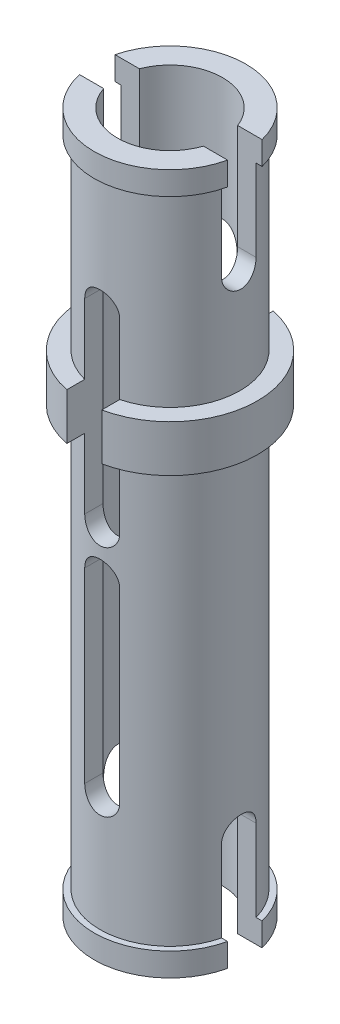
ISO-10303-21;
HEADER;
FILE_DESCRIPTION(('STEP AP214'),'2;1');
FILE_NAME('part.step','',(''),(''),'','','');
FILE_SCHEMA(('AUTOMOTIVE_DESIGN { 1 0 10303 214 1 1 1 1 }'));
ENDSEC;
DATA;
#1=APPLICATION_CONTEXT('core data for automotive mechanical design processes');
#2=APPLICATION_PROTOCOL_DEFINITION('international standard','automotive_design',2000,#1);
#3=PRODUCT_CONTEXT('',#1,'mechanical');
#4=PRODUCT('Part','Part','',(#3));
#5=PRODUCT_RELATED_PRODUCT_CATEGORY('part','',(#4));
#6=PRODUCT_DEFINITION_FORMATION('','',#4);
#7=PRODUCT_DEFINITION_CONTEXT('part definition',#1,'design');
#8=PRODUCT_DEFINITION('design','',#6,#7);
#9=PRODUCT_DEFINITION_SHAPE('','',#8);
#10=(LENGTH_UNIT() NAMED_UNIT(*) SI_UNIT(.MILLI.,.METRE.));
#11=(NAMED_UNIT(*) PLANE_ANGLE_UNIT() SI_UNIT($,.RADIAN.));
#12=(NAMED_UNIT(*) SI_UNIT($,.STERADIAN.) SOLID_ANGLE_UNIT());
#13=UNCERTAINTY_MEASURE_WITH_UNIT(LENGTH_MEASURE(1.E-05),#10,'distance_accuracy_value','');
#14=(GEOMETRIC_REPRESENTATION_CONTEXT(3) GLOBAL_UNCERTAINTY_ASSIGNED_CONTEXT((#13)) GLOBAL_UNIT_ASSIGNED_CONTEXT((#10,
#11,#12)) REPRESENTATION_CONTEXT('',''));
#15=CARTESIAN_POINT('',(0.,0.,0.));
#16=DIRECTION('',(0.,0.,1.));
#17=DIRECTION('',(1.,0.,0.));
#18=AXIS2_PLACEMENT_3D('',#15,#16,#17);
#19=CARTESIAN_POINT('',(0.,-0.8,0.));
#20=DIRECTION('',(0.,1.,0.));
#21=DIRECTION('',(0.,0.,1.));
#22=AXIS2_PLACEMENT_3D('',#19,#20,#21);
#23=CYLINDRICAL_SURFACE('',#22,3.);
#24=DIRECTION('',(0.,1.,0.));
#25=VECTOR('',#24,1.);
#26=CARTESIAN_POINT('',(0.600000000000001,-0.8,2.93938769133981));
#27=LINE('',#26,#25);
#28=CARTESIAN_POINT('',(0.600000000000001,0.8,2.93938769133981));
#29=VERTEX_POINT('',#28);
#30=CARTESIAN_POINT('',(0.600000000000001,-0.8,2.93938769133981));
#31=VERTEX_POINT('',#30);
#32=EDGE_CURVE('E328',#29,#31,#27,.F.);
#33=ORIENTED_EDGE('',*,*,#32,.T.);
#34=CARTESIAN_POINT('',(0.,-0.8,0.));
#35=DIRECTION('',(0.,1.,0.));
#36=DIRECTION('',(0.,0.,1.));
#37=AXIS2_PLACEMENT_3D('',#34,#35,#36);
#38=CIRCLE('',#37,3.);
#39=CARTESIAN_POINT('',(0.600000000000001,-0.8,-2.93938769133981));
#40=VERTEX_POINT('',#39);
#41=EDGE_CURVE('E324',#31,#40,#38,.T.);
#42=ORIENTED_EDGE('',*,*,#41,.T.);
#43=DIRECTION('',(0.,1.,0.));
#44=VECTOR('',#43,1.);
#45=CARTESIAN_POINT('',(0.600000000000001,-0.8,-2.93938769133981));
#46=LINE('',#45,#44);
#47=CARTESIAN_POINT('',(0.600000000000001,0.8,-2.93938769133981));
#48=VERTEX_POINT('',#47);
#49=EDGE_CURVE('E322',#40,#48,#46,.T.);
#50=ORIENTED_EDGE('',*,*,#49,.T.);
#51=CARTESIAN_POINT('',(0.,0.8,0.));
#52=DIRECTION('',(0.,1.,0.));
#53=DIRECTION('',(0.,0.,1.));
#54=AXIS2_PLACEMENT_3D('',#51,#52,#53);
#55=CIRCLE('',#54,3.);
#56=EDGE_CURVE('E19',#29,#48,#55,.T.);
#57=ORIENTED_EDGE('',*,*,#56,.F.);
#58=EDGE_LOOP('',(#33,#42,#50,#57));
#59=FACE_BOUND('',#58,.T.);
#60=ADVANCED_FACE('F16',(#59),#23,.T.);
#61=CARTESIAN_POINT('',(0.,-0.8,0.));
#62=DIRECTION('',(0.,1.,0.));
#63=DIRECTION('',(0.,0.,1.));
#64=AXIS2_PLACEMENT_3D('',#61,#62,#63);
#65=CYLINDRICAL_SURFACE('',#64,3.);
#66=DIRECTION('',(0.,1.,0.));
#67=VECTOR('',#66,1.);
#68=CARTESIAN_POINT('',(-0.599999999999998,-0.8,2.93938769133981));
#69=LINE('',#68,#67);
#70=CARTESIAN_POINT('',(-0.599999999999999,-0.8,2.93938769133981));
#71=VERTEX_POINT('',#70);
#72=CARTESIAN_POINT('',(-0.599999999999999,0.8,2.93938769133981));
#73=VERTEX_POINT('',#72);
#74=EDGE_CURVE('E340',#71,#73,#69,.T.);
#75=ORIENTED_EDGE('',*,*,#74,.T.);
#76=CARTESIAN_POINT('',(0.,0.8,0.));
#77=DIRECTION('',(0.,1.,0.));
#78=DIRECTION('',(0.,0.,1.));
#79=AXIS2_PLACEMENT_3D('',#76,#77,#78);
#80=CIRCLE('',#79,3.);
#81=CARTESIAN_POINT('',(-0.599999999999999,0.8,-2.93938769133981));
#82=VERTEX_POINT('',#81);
#83=EDGE_CURVE('E607',#82,#73,#80,.T.);
#84=ORIENTED_EDGE('',*,*,#83,.F.);
#85=DIRECTION('',(0.,1.,0.));
#86=VECTOR('',#85,1.);
#87=CARTESIAN_POINT('',(-0.599999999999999,-0.8,-2.93938769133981));
#88=LINE('',#87,#86);
#89=CARTESIAN_POINT('',(-0.599999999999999,-0.8,-2.93938769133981));
#90=VERTEX_POINT('',#89);
#91=EDGE_CURVE('E343',#82,#90,#88,.F.);
#92=ORIENTED_EDGE('',*,*,#91,.T.);
#93=CARTESIAN_POINT('',(0.,-0.8,0.));
#94=DIRECTION('',(0.,1.,0.));
#95=DIRECTION('',(0.,0.,1.));
#96=AXIS2_PLACEMENT_3D('',#93,#94,#95);
#97=CIRCLE('',#96,3.);
#98=EDGE_CURVE('E594',#90,#71,#97,.T.);
#99=ORIENTED_EDGE('',*,*,#98,.T.);
#100=EDGE_LOOP('',(#75,#84,#92,#99));
#101=FACE_BOUND('',#100,.T.);
#102=ADVANCED_FACE('F595',(#101),#65,.T.);
#103=CARTESIAN_POINT('',(0.,0.8,0.));
#104=DIRECTION('',(0.,1.,0.));
#105=DIRECTION('',(0.,0.,1.));
#106=AXIS2_PLACEMENT_3D('',#103,#104,#105);
#107=PLANE('',#106);
#108=DIRECTION('',(0.,0.,1.));
#109=VECTOR('',#108,1.);
#110=CARTESIAN_POINT('',(0.600000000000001,0.8,0.));
#111=LINE('',#110,#109);
#112=CARTESIAN_POINT('',(0.600000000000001,0.799999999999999,2.32379000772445));
#113=VERTEX_POINT('',#112);
#114=EDGE_CURVE('E316',#113,#29,#111,.T.);
#115=ORIENTED_EDGE('',*,*,#114,.T.);
#116=ORIENTED_EDGE('',*,*,#56,.T.);
#117=DIRECTION('',(0.,0.,1.));
#118=VECTOR('',#117,1.);
#119=CARTESIAN_POINT('',(0.600000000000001,0.8,0.));
#120=LINE('',#119,#118);
#121=CARTESIAN_POINT('',(0.600000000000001,0.799999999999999,-2.32379000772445));
#122=VERTEX_POINT('',#121);
#123=EDGE_CURVE('E331',#48,#122,#120,.T.);
#124=ORIENTED_EDGE('',*,*,#123,.T.);
#125=CARTESIAN_POINT('',(0.,0.799999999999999,0.));
#126=DIRECTION('',(0.,1.,0.));
#127=DIRECTION('',(0.,0.,1.));
#128=AXIS2_PLACEMENT_3D('',#125,#126,#127);
#129=CIRCLE('',#128,2.4);
#130=EDGE_CURVE('E599',#113,#122,#129,.T.);
#131=ORIENTED_EDGE('',*,*,#130,.F.);
#132=EDGE_LOOP('',(#115,#116,#124,#131));
#133=FACE_BOUND('',#132,.T.);
#134=ADVANCED_FACE('F330',(#133),#107,.T.);
#135=CARTESIAN_POINT('',(0.,-0.8,0.));
#136=DIRECTION('',(0.,1.,0.));
#137=DIRECTION('',(0.,0.,1.));
#138=AXIS2_PLACEMENT_3D('',#135,#136,#137);
#139=PLANE('',#138);
#140=DIRECTION('',(0.,0.,1.));
#141=VECTOR('',#140,1.);
#142=CARTESIAN_POINT('',(0.600000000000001,-0.8,0.));
#143=LINE('',#142,#141);
#144=CARTESIAN_POINT('',(0.600000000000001,-0.8,-2.32379000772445));
#145=VERTEX_POINT('',#144);
#146=EDGE_CURVE('E609',#40,#145,#143,.T.);
#147=ORIENTED_EDGE('',*,*,#146,.F.);
#148=ORIENTED_EDGE('',*,*,#41,.F.);
#149=DIRECTION('',(0.,0.,1.));
#150=VECTOR('',#149,1.);
#151=CARTESIAN_POINT('',(0.600000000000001,-0.8,0.));
#152=LINE('',#151,#150);
#153=CARTESIAN_POINT('',(0.600000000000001,-0.8,2.32379000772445));
#154=VERTEX_POINT('',#153);
#155=EDGE_CURVE('E333',#154,#31,#152,.T.);
#156=ORIENTED_EDGE('',*,*,#155,.F.);
#157=CARTESIAN_POINT('',(0.,-0.8,0.));
#158=DIRECTION('',(0.,1.,0.));
#159=DIRECTION('',(0.,0.,1.));
#160=AXIS2_PLACEMENT_3D('',#157,#158,#159);
#161=CIRCLE('',#160,2.4);
#162=EDGE_CURVE('E602',#145,#154,#161,.F.);
#163=ORIENTED_EDGE('',*,*,#162,.F.);
#164=EDGE_LOOP('',(#147,#148,#156,#163));
#165=FACE_BOUND('',#164,.T.);
#166=ADVANCED_FACE('F1030',(#165),#139,.F.);
#167=CARTESIAN_POINT('',(0.,0.8,0.));
#168=DIRECTION('',(0.,1.,0.));
#169=DIRECTION('',(0.,0.,1.));
#170=AXIS2_PLACEMENT_3D('',#167,#168,#169);
#171=PLANE('',#170);
#172=DIRECTION('',(0.,0.,1.));
#173=VECTOR('',#172,1.);
#174=CARTESIAN_POINT('',(-0.599999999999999,0.8,0.));
#175=LINE('',#174,#173);
#176=CARTESIAN_POINT('',(-0.599999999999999,0.799999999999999,2.32379000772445));
#177=VERTEX_POINT('',#176);
#178=EDGE_CURVE('E589',#73,#177,#175,.F.);
#179=ORIENTED_EDGE('',*,*,#178,.T.);
#180=CARTESIAN_POINT('',(0.,0.799999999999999,0.));
#181=DIRECTION('',(0.,1.,0.));
#182=DIRECTION('',(0.,0.,1.));
#183=AXIS2_PLACEMENT_3D('',#180,#181,#182);
#184=CIRCLE('',#183,2.4);
#185=CARTESIAN_POINT('',(-0.599999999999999,0.799999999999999,-2.32379000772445));
#186=VERTEX_POINT('',#185);
#187=EDGE_CURVE('E916',#186,#177,#184,.T.);
#188=ORIENTED_EDGE('',*,*,#187,.F.);
#189=DIRECTION('',(0.,0.,1.));
#190=VECTOR('',#189,1.);
#191=CARTESIAN_POINT('',(-0.599999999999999,0.8,0.));
#192=LINE('',#191,#190);
#193=EDGE_CURVE('E608',#186,#82,#192,.F.);
#194=ORIENTED_EDGE('',*,*,#193,.T.);
#195=ORIENTED_EDGE('',*,*,#83,.T.);
#196=EDGE_LOOP('',(#179,#188,#194,#195));
#197=FACE_BOUND('',#196,.T.);
#198=ADVANCED_FACE('F943',(#197),#171,.T.);
#199=CARTESIAN_POINT('',(0.,7.2,0.));
#200=DIRECTION('',(0.,1.,0.));
#201=DIRECTION('',(0.,0.,1.));
#202=AXIS2_PLACEMENT_3D('',#199,#200,#201);
#203=PLANE('',#202);
#204=DIRECTION('',(1.,0.,0.));
#205=VECTOR('',#204,1.);
#206=CARTESIAN_POINT('',(0.,7.2,0.563999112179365));
#207=LINE('',#206,#205);
#208=CARTESIAN_POINT('',(-2.33278910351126,7.2,0.563999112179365));
#209=VERTEX_POINT('',#208);
#210=CARTESIAN_POINT('',(-2.53809081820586,7.2,0.563999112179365));
#211=VERTEX_POINT('',#210);
#212=EDGE_CURVE('E620',#209,#211,#207,.F.);
#213=ORIENTED_EDGE('',*,*,#212,.F.);
#214=CARTESIAN_POINT('',(0.,7.2,0.));
#215=DIRECTION('',(0.,1.,0.));
#216=DIRECTION('',(0.,0.,1.));
#217=AXIS2_PLACEMENT_3D('',#214,#215,#216);
#218=CIRCLE('',#217,2.4);
#219=CARTESIAN_POINT('',(2.33278910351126,7.2,0.563999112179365));
#220=VERTEX_POINT('',#219);
#221=EDGE_CURVE('E913',#220,#209,#218,.F.);
#222=ORIENTED_EDGE('',*,*,#221,.F.);
#223=DIRECTION('',(1.,0.,0.));
#224=VECTOR('',#223,1.);
#225=CARTESIAN_POINT('',(0.,7.2,0.563999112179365));
#226=LINE('',#225,#224);
#227=CARTESIAN_POINT('',(2.53809081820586,7.2,0.563999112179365));
#228=VERTEX_POINT('',#227);
#229=EDGE_CURVE('E617',#228,#220,#226,.F.);
#230=ORIENTED_EDGE('',*,*,#229,.F.);
#231=CARTESIAN_POINT('',(0.,7.2,0.));
#232=DIRECTION('',(0.,1.,0.));
#233=DIRECTION('',(0.,0.,1.));
#234=AXIS2_PLACEMENT_3D('',#231,#232,#233);
#235=CIRCLE('',#234,2.6);
#236=EDGE_CURVE('E687',#211,#228,#235,.T.);
#237=ORIENTED_EDGE('',*,*,#236,.F.);
#238=EDGE_LOOP('',(#213,#222,#230,#237));
#239=FACE_BOUND('',#238,.T.);
#240=ADVANCED_FACE('F1017',(#239),#203,.F.);
#241=CARTESIAN_POINT('',(0.,7.2,0.));
#242=DIRECTION('',(0.,1.,0.));
#243=DIRECTION('',(0.,0.,1.));
#244=AXIS2_PLACEMENT_3D('',#241,#242,#243);
#245=PLANE('',#244);
#246=DIRECTION('',(1.,0.,0.));
#247=VECTOR('',#246,1.);
#248=CARTESIAN_POINT('',(0.,7.2,-0.636000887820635));
#249=LINE('',#248,#247);
#250=CARTESIAN_POINT('',(-2.52101227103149,7.2,-0.636000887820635));
#251=VERTEX_POINT('',#250);
#252=CARTESIAN_POINT('',(-2.31419594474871,7.2,-0.636000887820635));
#253=VERTEX_POINT('',#252);
#254=EDGE_CURVE('E625',#251,#253,#249,.T.);
#255=ORIENTED_EDGE('',*,*,#254,.F.);
#256=CARTESIAN_POINT('',(0.,7.2,0.));
#257=DIRECTION('',(0.,1.,0.));
#258=DIRECTION('',(0.,0.,1.));
#259=AXIS2_PLACEMENT_3D('',#256,#257,#258);
#260=CIRCLE('',#259,2.6);
#261=CARTESIAN_POINT('',(2.52101227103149,7.2,-0.636000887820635));
#262=VERTEX_POINT('',#261);
#263=EDGE_CURVE('E909',#262,#251,#260,.T.);
#264=ORIENTED_EDGE('',*,*,#263,.F.);
#265=DIRECTION('',(1.,0.,0.));
#266=VECTOR('',#265,1.);
#267=CARTESIAN_POINT('',(0.,7.2,-0.636000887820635));
#268=LINE('',#267,#266);
#269=CARTESIAN_POINT('',(2.31419594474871,7.2,-0.636000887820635));
#270=VERTEX_POINT('',#269);
#271=EDGE_CURVE('E623',#270,#262,#268,.T.);
#272=ORIENTED_EDGE('',*,*,#271,.F.);
#273=CARTESIAN_POINT('',(0.,7.2,0.));
#274=DIRECTION('',(0.,1.,0.));
#275=DIRECTION('',(0.,0.,1.));
#276=AXIS2_PLACEMENT_3D('',#273,#274,#275);
#277=CIRCLE('',#276,2.4);
#278=EDGE_CURVE('E915',#253,#270,#277,.F.);
#279=ORIENTED_EDGE('',*,*,#278,.F.);
#280=EDGE_LOOP('',(#255,#264,#272,#279));
#281=FACE_BOUND('',#280,.T.);
#282=ADVANCED_FACE('F1014',(#281),#245,.F.);
#283=CARTESIAN_POINT('',(0.,-15.2,0.));
#284=DIRECTION('',(0.,-1.,0.));
#285=DIRECTION('',(0.,0.,-1.));
#286=AXIS2_PLACEMENT_3D('',#283,#284,#285);
#287=PLANE('',#286);
#288=DIRECTION('',(1.,0.,0.));
#289=VECTOR('',#288,1.);
#290=CARTESIAN_POINT('',(0.,-15.2,0.563999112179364));
#291=LINE('',#290,#289);
#292=CARTESIAN_POINT('',(2.33278910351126,-15.2,0.563999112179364));
#293=VERTEX_POINT('',#292);
#294=CARTESIAN_POINT('',(2.53809081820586,-15.2,0.563999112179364));
#295=VERTEX_POINT('',#294);
#296=EDGE_CURVE('E629',#293,#295,#291,.T.);
#297=ORIENTED_EDGE('',*,*,#296,.F.);
#298=CARTESIAN_POINT('',(0.,-15.2,0.));
#299=DIRECTION('',(0.,1.,0.));
#300=DIRECTION('',(0.,0.,1.));
#301=AXIS2_PLACEMENT_3D('',#298,#299,#300);
#302=CIRCLE('',#301,2.4);
#303=CARTESIAN_POINT('',(-2.33278910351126,-15.2,0.563999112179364));
#304=VERTEX_POINT('',#303);
#305=EDGE_CURVE('E945',#304,#293,#302,.T.);
#306=ORIENTED_EDGE('',*,*,#305,.F.);
#307=DIRECTION('',(1.,0.,0.));
#308=VECTOR('',#307,1.);
#309=CARTESIAN_POINT('',(0.,-15.2,0.563999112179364));
#310=LINE('',#309,#308);
#311=CARTESIAN_POINT('',(-2.53809081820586,-15.2,0.563999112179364));
#312=VERTEX_POINT('',#311);
#313=EDGE_CURVE('E627',#312,#304,#310,.T.);
#314=ORIENTED_EDGE('',*,*,#313,.F.);
#315=CARTESIAN_POINT('',(0.,-15.2,0.));
#316=DIRECTION('',(0.,-1.,0.));
#317=DIRECTION('',(0.,0.,-1.));
#318=AXIS2_PLACEMENT_3D('',#315,#316,#317);
#319=CIRCLE('',#318,2.6);
#320=EDGE_CURVE('E654',#295,#312,#319,.T.);
#321=ORIENTED_EDGE('',*,*,#320,.F.);
#322=EDGE_LOOP('',(#297,#306,#314,#321));
#323=FACE_BOUND('',#322,.T.);
#324=ADVANCED_FACE('F1016',(#323),#287,.F.);
#325=CARTESIAN_POINT('',(0.,-0.8,0.));
#326=DIRECTION('',(0.,1.,0.));
#327=DIRECTION('',(0.,0.,1.));
#328=AXIS2_PLACEMENT_3D('',#325,#326,#327);
#329=PLANE('',#328);
#330=DIRECTION('',(0.,0.,1.));
#331=VECTOR('',#330,1.);
#332=CARTESIAN_POINT('',(-0.599999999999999,-0.8,0.));
#333=LINE('',#332,#331);
#334=CARTESIAN_POINT('',(-0.599999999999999,-0.8,-2.32379000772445));
#335=VERTEX_POINT('',#334);
#336=EDGE_CURVE('E600',#335,#90,#333,.F.);
#337=ORIENTED_EDGE('',*,*,#336,.F.);
#338=CARTESIAN_POINT('',(0.,-0.8,0.));
#339=DIRECTION('',(0.,1.,0.));
#340=DIRECTION('',(0.,0.,1.));
#341=AXIS2_PLACEMENT_3D('',#338,#339,#340);
#342=CIRCLE('',#341,2.4);
#343=CARTESIAN_POINT('',(-0.599999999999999,-0.8,2.32379000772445));
#344=VERTEX_POINT('',#343);
#345=EDGE_CURVE('E939',#344,#335,#342,.F.);
#346=ORIENTED_EDGE('',*,*,#345,.F.);
#347=DIRECTION('',(0.,0.,1.));
#348=VECTOR('',#347,1.);
#349=CARTESIAN_POINT('',(-0.599999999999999,-0.8,0.));
#350=LINE('',#349,#348);
#351=EDGE_CURVE('E586',#71,#344,#350,.F.);
#352=ORIENTED_EDGE('',*,*,#351,.F.);
#353=ORIENTED_EDGE('',*,*,#98,.F.);
#354=EDGE_LOOP('',(#337,#346,#352,#353));
#355=FACE_BOUND('',#354,.T.);
#356=ADVANCED_FACE('F944',(#355),#329,.F.);
#357=CARTESIAN_POINT('',(0.,-15.2,0.));
#358=DIRECTION('',(0.,-1.,0.));
#359=DIRECTION('',(0.,0.,-1.));
#360=AXIS2_PLACEMENT_3D('',#357,#358,#359);
#361=PLANE('',#360);
#362=DIRECTION('',(1.,0.,0.));
#363=VECTOR('',#362,1.);
#364=CARTESIAN_POINT('',(3.001,-15.2,-0.636000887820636));
#365=LINE('',#364,#363);
#366=CARTESIAN_POINT('',(2.52101227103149,-15.2,-0.636000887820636));
#367=VERTEX_POINT('',#366);
#368=CARTESIAN_POINT('',(2.31419594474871,-15.2,-0.636000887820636));
#369=VERTEX_POINT('',#368);
#370=EDGE_CURVE('E648',#367,#369,#365,.F.);
#371=ORIENTED_EDGE('',*,*,#370,.F.);
#372=CARTESIAN_POINT('',(0.,-15.2,0.));
#373=DIRECTION('',(0.,-1.,0.));
#374=DIRECTION('',(0.,0.,-1.));
#375=AXIS2_PLACEMENT_3D('',#372,#373,#374);
#376=CIRCLE('',#375,2.6);
#377=CARTESIAN_POINT('',(-2.52101227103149,-15.2,-0.636000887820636));
#378=VERTEX_POINT('',#377);
#379=EDGE_CURVE('E734',#378,#367,#376,.T.);
#380=ORIENTED_EDGE('',*,*,#379,.F.);
#381=DIRECTION('',(1.,0.,0.));
#382=VECTOR('',#381,1.);
#383=CARTESIAN_POINT('',(0.,-15.2,-0.636000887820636));
#384=LINE('',#383,#382);
#385=CARTESIAN_POINT('',(-2.31419594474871,-15.2,-0.636000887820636));
#386=VERTEX_POINT('',#385);
#387=EDGE_CURVE('E652',#386,#378,#384,.F.);
#388=ORIENTED_EDGE('',*,*,#387,.F.);
#389=CARTESIAN_POINT('',(0.,-15.2,0.));
#390=DIRECTION('',(0.,1.,0.));
#391=DIRECTION('',(0.,0.,1.));
#392=AXIS2_PLACEMENT_3D('',#389,#390,#391);
#393=CIRCLE('',#392,2.4);
#394=EDGE_CURVE('E918',#369,#386,#393,.T.);
#395=ORIENTED_EDGE('',*,*,#394,.F.);
#396=EDGE_LOOP('',(#371,#380,#388,#395));
#397=FACE_BOUND('',#396,.T.);
#398=ADVANCED_FACE('F1095',(#397),#361,.F.);
#399=CARTESIAN_POINT('',(0.,-15.2,0.));
#400=DIRECTION('',(0.,-1.,0.));
#401=DIRECTION('',(0.,0.,-1.));
#402=AXIS2_PLACEMENT_3D('',#399,#400,#401);
#403=CYLINDRICAL_SURFACE('',#402,2.6);
#404=ORIENTED_EDGE('',*,*,#320,.T.);
#405=DIRECTION('',(0.,-1.,0.));
#406=VECTOR('',#405,1.);
#407=CARTESIAN_POINT('',(-2.53809081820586,-16.,0.563999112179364));
#408=LINE('',#407,#406);
#409=CARTESIAN_POINT('',(-2.53809081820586,-16.,0.563999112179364));
#410=VERTEX_POINT('',#409);
#411=EDGE_CURVE('E662',#312,#410,#408,.T.);
#412=ORIENTED_EDGE('',*,*,#411,.T.);
#413=CARTESIAN_POINT('',(0.,-16.,0.));
#414=DIRECTION('',(0.,-1.,0.));
#415=DIRECTION('',(0.,0.,-1.));
#416=AXIS2_PLACEMENT_3D('',#413,#414,#415);
#417=CIRCLE('',#416,2.6);
#418=CARTESIAN_POINT('',(2.53809081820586,-16.,0.563999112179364));
#419=VERTEX_POINT('',#418);
#420=EDGE_CURVE('E744',#410,#419,#417,.F.);
#421=ORIENTED_EDGE('',*,*,#420,.T.);
#422=DIRECTION('',(0.,1.,0.));
#423=VECTOR('',#422,1.);
#424=CARTESIAN_POINT('',(2.53809081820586,-16.,0.563999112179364));
#425=LINE('',#424,#423);
#426=EDGE_CURVE('E643',#295,#419,#425,.F.);
#427=ORIENTED_EDGE('',*,*,#426,.F.);
#428=EDGE_LOOP('',(#404,#412,#421,#427));
#429=FACE_BOUND('',#428,.T.);
#430=ADVANCED_FACE('F1103',(#429),#403,.T.);
#431=CARTESIAN_POINT('',(0.,7.2,0.));
#432=DIRECTION('',(0.,1.,0.));
#433=DIRECTION('',(0.,0.,1.));
#434=AXIS2_PLACEMENT_3D('',#431,#432,#433);
#435=CYLINDRICAL_SURFACE('',#434,2.6);
#436=DIRECTION('',(0.,1.,0.));
#437=VECTOR('',#436,1.);
#438=CARTESIAN_POINT('',(2.53809081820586,8.,0.563999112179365));
#439=LINE('',#438,#437);
#440=CARTESIAN_POINT('',(2.53809081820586,8.,0.563999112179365));
#441=VERTEX_POINT('',#440);
#442=EDGE_CURVE('E639',#441,#228,#439,.F.);
#443=ORIENTED_EDGE('',*,*,#442,.F.);
#444=CARTESIAN_POINT('',(0.,8.,0.));
#445=DIRECTION('',(0.,1.,0.));
#446=DIRECTION('',(0.,0.,1.));
#447=AXIS2_PLACEMENT_3D('',#444,#445,#446);
#448=CIRCLE('',#447,2.6);
#449=CARTESIAN_POINT('',(-2.53809081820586,8.,0.563999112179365));
#450=VERTEX_POINT('',#449);
#451=EDGE_CURVE('E562',#450,#441,#448,.T.);
#452=ORIENTED_EDGE('',*,*,#451,.F.);
#453=DIRECTION('',(0.,1.,0.));
#454=VECTOR('',#453,1.);
#455=CARTESIAN_POINT('',(-2.53809081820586,7.2,0.563999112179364));
#456=LINE('',#455,#454);
#457=EDGE_CURVE('E684',#450,#211,#456,.F.);
#458=ORIENTED_EDGE('',*,*,#457,.T.);
#459=ORIENTED_EDGE('',*,*,#236,.T.);
#460=EDGE_LOOP('',(#443,#452,#458,#459));
#461=FACE_BOUND('',#460,.T.);
#462=ADVANCED_FACE('F886',(#461),#435,.T.);
#463=CARTESIAN_POINT('',(0.,7.2,0.));
#464=DIRECTION('',(0.,1.,0.));
#465=DIRECTION('',(0.,0.,1.));
#466=AXIS2_PLACEMENT_3D('',#463,#464,#465);
#467=CYLINDRICAL_SURFACE('',#466,2.6);
#468=DIRECTION('',(0.,-1.,0.));
#469=VECTOR('',#468,1.);
#470=CARTESIAN_POINT('',(2.52101227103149,8.,-0.636000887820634));
#471=LINE('',#470,#469);
#472=CARTESIAN_POINT('',(2.52101227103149,8.,-0.636000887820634));
#473=VERTEX_POINT('',#472);
#474=EDGE_CURVE('E635',#262,#473,#471,.F.);
#475=ORIENTED_EDGE('',*,*,#474,.F.);
#476=ORIENTED_EDGE('',*,*,#263,.T.);
#477=DIRECTION('',(0.,1.,0.));
#478=VECTOR('',#477,1.);
#479=CARTESIAN_POINT('',(-2.52101227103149,8.,-0.636000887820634));
#480=LINE('',#479,#478);
#481=CARTESIAN_POINT('',(-2.52101227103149,8.,-0.636000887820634));
#482=VERTEX_POINT('',#481);
#483=EDGE_CURVE('E697',#251,#482,#480,.T.);
#484=ORIENTED_EDGE('',*,*,#483,.T.);
#485=CARTESIAN_POINT('',(0.,8.,0.));
#486=DIRECTION('',(0.,1.,0.));
#487=DIRECTION('',(0.,0.,1.));
#488=AXIS2_PLACEMENT_3D('',#485,#486,#487);
#489=CIRCLE('',#488,2.6);
#490=EDGE_CURVE('E561',#473,#482,#489,.T.);
#491=ORIENTED_EDGE('',*,*,#490,.F.);
#492=EDGE_LOOP('',(#475,#476,#484,#491));
#493=FACE_BOUND('',#492,.T.);
#494=ADVANCED_FACE('F905',(#493),#467,.T.);
#495=CARTESIAN_POINT('',(0.,-16.,0.));
#496=DIRECTION('',(0.,1.,0.));
#497=DIRECTION('',(0.,0.,1.));
#498=AXIS2_PLACEMENT_3D('',#495,#496,#497);
#499=CYLINDRICAL_SURFACE('',#498,2.4);
#500=DIRECTION('',(0.,1.,0.));
#501=VECTOR('',#500,1.);
#502=CARTESIAN_POINT('',(0.600000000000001,3.2,-2.32379000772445));
#503=LINE('',#502,#501);
#504=CARTESIAN_POINT('',(0.600000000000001,3.2,-2.32379000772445));
#505=VERTEX_POINT('',#504);
#506=EDGE_CURVE('E339',#122,#505,#503,.T.);
#507=ORIENTED_EDGE('',*,*,#506,.T.);
#508=CARTESIAN_POINT('',(0.600000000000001,3.2,-2.32379000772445));
#509=CARTESIAN_POINT('',(0.60003109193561,3.23319366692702,-2.32376171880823));
#510=CARTESIAN_POINT('',(0.597247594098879,3.26636654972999,-2.32450050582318));
#511=CARTESIAN_POINT('',(0.586295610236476,3.33168781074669,-2.32729757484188));
#512=CARTESIAN_POINT('',(0.578138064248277,3.36383813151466,-2.32935317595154));
#513=CARTESIAN_POINT('',(0.556681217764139,3.42627107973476,-2.33457062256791));
#514=CARTESIAN_POINT('',(0.543382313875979,3.45655385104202,-2.33773238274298));
#515=CARTESIAN_POINT('',(0.512047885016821,3.51446899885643,-2.34479547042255));
#516=CARTESIAN_POINT('',(0.494011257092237,3.54210075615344,-2.34869697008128));
#517=CARTESIAN_POINT('',(0.453292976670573,3.59452337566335,-2.35689701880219));
#518=CARTESIAN_POINT('',(0.43052717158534,3.61924790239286,-2.36120185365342));
#519=CARTESIAN_POINT('',(0.38117048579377,3.66457725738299,-2.36966983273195));
#520=CARTESIAN_POINT('',(0.354578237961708,3.68518060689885,-2.37383292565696));
#521=CARTESIAN_POINT('',(0.297860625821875,3.72195581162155,-2.381619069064));
#522=CARTESIAN_POINT('',(0.267690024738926,3.73805980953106,-2.38523350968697));
#523=CARTESIAN_POINT('',(0.204985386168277,3.764926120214,-2.39143666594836));
#524=CARTESIAN_POINT('',(0.172454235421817,3.77569483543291,-2.39402661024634));
#525=CARTESIAN_POINT('',(0.116467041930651,3.7890536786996,-2.39728134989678));
#526=CARTESIAN_POINT('',(0.0933797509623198,3.79315147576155,-2.39829556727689));
#527=CARTESIAN_POINT('',(0.0468648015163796,3.79862512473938,-2.399655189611));
#528=CARTESIAN_POINT('',(0.0234371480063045,3.8000010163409,-2.40000060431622));
#529=CARTESIAN_POINT('',(-0.0331390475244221,3.79999856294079,-2.39999914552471));
#530=CARTESIAN_POINT('',(-0.06629707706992,3.79724432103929,-2.39930650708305));
#531=CARTESIAN_POINT('',(-0.13167137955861,3.78631323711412,-2.39660930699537));
#532=CARTESIAN_POINT('',(-0.163886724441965,3.77813122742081,-2.39460349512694));
#533=CARTESIAN_POINT('',(-0.226408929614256,3.75662394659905,-2.38950240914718));
#534=CARTESIAN_POINT('',(-0.256718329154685,3.74330569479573,-2.38640862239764));
#535=CARTESIAN_POINT('',(-0.314670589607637,3.71192636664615,-2.37946115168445));
#536=CARTESIAN_POINT('',(-0.342313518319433,3.69386541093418,-2.37560748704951));
#537=CARTESIAN_POINT('',(-0.394720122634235,3.65312021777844,-2.36746975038));
#538=CARTESIAN_POINT('',(-0.419421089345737,3.63035664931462,-2.36317903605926));
#539=CARTESIAN_POINT('',(-0.464698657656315,3.5810201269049,-2.35469466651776));
#540=CARTESIAN_POINT('',(-0.485274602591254,3.55444656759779,-2.35050102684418));
#541=CARTESIAN_POINT('',(-0.522015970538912,3.49775429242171,-2.34261795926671));
#542=CARTESIAN_POINT('',(-0.538109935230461,3.46758801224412,-2.3389371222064));
#543=CARTESIAN_POINT('',(-0.564965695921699,3.4048780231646,-2.33259626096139));
#544=CARTESIAN_POINT('',(-0.575731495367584,3.37233612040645,-2.32993547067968));
#545=CARTESIAN_POINT('',(-0.589075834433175,3.31634972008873,-2.3265900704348));
#546=CARTESIAN_POINT('',(-0.593166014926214,3.29327578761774,-2.32554679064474));
#547=CARTESIAN_POINT('',(-0.598629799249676,3.24680538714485,-2.32414381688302));
#548=CARTESIAN_POINT('',(-0.600005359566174,3.22340916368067,-2.32378363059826));
#549=CARTESIAN_POINT('',(-0.599999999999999,3.2,-2.32379000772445));
#550=B_SPLINE_CURVE_WITH_KNOTS('',3,(#508,#509,#510,#511,#512,#513,#514,#515,#516,#517,#518,
#519,#520,#521,#522,#523,#524,#525,#526,#527,#528,#529,#530,#531,#532,#533,#534,#535,#536,#537,
#538,#539,#540,#541,#542,#543,#544,#545,#546,#547,#548,#549),.UNSPECIFIED.,.F.,.F.,(4,2,2,2,2,2,
2,2,2,2,2,2,2,2,2,2,2,2,2,2,4),(0.,0.0994243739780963,0.1986469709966,0.29786191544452,
0.39709997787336,0.498284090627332,0.599504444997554,0.702177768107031,0.804727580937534,
0.874978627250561,0.945228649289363,1.04455894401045,1.14398394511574,1.24327354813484,
1.34256062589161,1.44368405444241,1.54482356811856,1.64749366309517,1.75008649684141,
1.82029723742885,1.89045735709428),.UNSPECIFIED.);
#551=CARTESIAN_POINT('',(-0.599999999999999,3.2,-2.32379000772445));
#552=VERTEX_POINT('',#551);
#553=EDGE_CURVE('E516',#505,#552,#550,.T.);
#554=ORIENTED_EDGE('',*,*,#553,.T.);
#555=DIRECTION('',(0.,-1.,0.));
#556=VECTOR('',#555,1.);
#557=CARTESIAN_POINT('',(-0.599999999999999,3.2,-2.32379000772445));
#558=LINE('',#557,#556);
#559=EDGE_CURVE('E515',#552,#186,#558,.T.);
#560=ORIENTED_EDGE('',*,*,#559,.T.);
#561=ORIENTED_EDGE('',*,*,#187,.T.);
#562=DIRECTION('',(0.,1.,0.));
#563=VECTOR('',#562,1.);
#564=CARTESIAN_POINT('',(-0.599999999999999,3.2,2.32379000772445));
#565=LINE('',#564,#563);
#566=CARTESIAN_POINT('',(-0.599999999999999,3.2,2.32379000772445));
#567=VERTEX_POINT('',#566);
#568=EDGE_CURVE('E681',#567,#177,#565,.F.);
#569=ORIENTED_EDGE('',*,*,#568,.F.);
#570=CARTESIAN_POINT('',(-0.599999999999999,3.2,2.32379000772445));
#571=CARTESIAN_POINT('',(-0.600031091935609,3.23319366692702,2.32376171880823));
#572=CARTESIAN_POINT('',(-0.597247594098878,3.26636654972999,2.32450050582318));
#573=CARTESIAN_POINT('',(-0.586295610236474,3.33168781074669,2.32729757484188));
#574=CARTESIAN_POINT('',(-0.578138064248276,3.36383813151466,2.32935317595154));
#575=CARTESIAN_POINT('',(-0.556681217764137,3.42627107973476,2.33457062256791));
#576=CARTESIAN_POINT('',(-0.543382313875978,3.45655385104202,2.33773238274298));
#577=CARTESIAN_POINT('',(-0.512047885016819,3.51446899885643,2.34479547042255));
#578=CARTESIAN_POINT('',(-0.494011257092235,3.54210075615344,2.34869697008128));
#579=CARTESIAN_POINT('',(-0.453292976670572,3.59452337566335,2.35689701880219));
#580=CARTESIAN_POINT('',(-0.430527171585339,3.61924790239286,2.36120185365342));
#581=CARTESIAN_POINT('',(-0.381170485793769,3.66457725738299,2.36966983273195));
#582=CARTESIAN_POINT('',(-0.354578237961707,3.68518060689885,2.37383292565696));
#583=CARTESIAN_POINT('',(-0.297860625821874,3.72195581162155,2.381619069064));
#584=CARTESIAN_POINT('',(-0.267690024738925,3.73805980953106,2.38523350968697));
#585=CARTESIAN_POINT('',(-0.204985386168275,3.764926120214,2.39143666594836));
#586=CARTESIAN_POINT('',(-0.172454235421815,3.77569483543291,2.39402661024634));
#587=CARTESIAN_POINT('',(-0.11646704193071,3.78905367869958,2.39728134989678));
#588=CARTESIAN_POINT('',(-0.093379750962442,3.79315147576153,2.39829556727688));
#589=CARTESIAN_POINT('',(-0.0468648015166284,3.79862512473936,2.399655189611));
#590=CARTESIAN_POINT('',(-0.0234371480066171,3.80000101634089,2.40000060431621));
#591=CARTESIAN_POINT('',(0.0331390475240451,3.79999856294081,2.39999914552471));
#592=CARTESIAN_POINT('',(0.0662970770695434,3.79724432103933,2.39930650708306));
#593=CARTESIAN_POINT('',(0.131671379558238,3.7863132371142,2.39660930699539));
#594=CARTESIAN_POINT('',(0.163886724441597,3.77813122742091,2.39460349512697));
#595=CARTESIAN_POINT('',(0.2264089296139,3.75662394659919,2.38950240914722));
#596=CARTESIAN_POINT('',(0.256718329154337,3.7433056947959,2.38640862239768));
#597=CARTESIAN_POINT('',(0.314670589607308,3.71192636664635,2.3794611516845));
#598=CARTESIAN_POINT('',(0.342313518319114,3.6938654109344,2.37560748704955));
#599=CARTESIAN_POINT('',(0.394720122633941,3.6531202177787,2.36746975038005));
#600=CARTESIAN_POINT('',(0.419421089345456,3.6303566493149,2.36317903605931));
#601=CARTESIAN_POINT('',(0.464698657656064,3.58102012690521,2.3546946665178));
#602=CARTESIAN_POINT('',(0.485274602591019,3.55444656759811,2.35050102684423));
#603=CARTESIAN_POINT('',(0.522015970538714,3.49775429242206,2.34261795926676));
#604=CARTESIAN_POINT('',(0.538109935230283,3.46758801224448,2.33893712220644));
#605=CARTESIAN_POINT('',(0.564965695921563,3.40487802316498,2.33259626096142));
#606=CARTESIAN_POINT('',(0.57573149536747,3.37233612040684,2.32993547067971));
#607=CARTESIAN_POINT('',(0.589075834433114,3.31634972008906,2.32659007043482));
#608=CARTESIAN_POINT('',(0.593166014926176,3.293275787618,2.32554679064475));
#609=CARTESIAN_POINT('',(0.598629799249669,3.24680538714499,2.32414381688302));
#610=CARTESIAN_POINT('',(0.600005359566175,3.22340916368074,2.32378363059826));
#611=CARTESIAN_POINT('',(0.600000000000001,3.2,2.32379000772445));
#612=B_SPLINE_CURVE_WITH_KNOTS('',3,(#570,#571,#572,#573,#574,#575,#576,#577,#578,#579,#580,
#581,#582,#583,#584,#585,#586,#587,#588,#589,#590,#591,#592,#593,#594,#595,#596,#597,#598,#599,
#600,#601,#602,#603,#604,#605,#606,#607,#608,#609,#610,#611),.UNSPECIFIED.,.F.,.F.,(4,2,2,2,2,2,
2,2,2,2,2,2,2,2,2,2,2,2,2,2,4),(0.,0.0994243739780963,0.1986469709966,0.29786191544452,
0.39709997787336,0.498284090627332,0.599504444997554,0.702177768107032,0.804727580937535,
0.874978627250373,0.945228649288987,1.04455894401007,1.14398394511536,1.24327354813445,
1.34256062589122,1.44368405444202,1.54482356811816,1.64749366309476,1.75008649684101,
1.82029723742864,1.89045735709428),.UNSPECIFIED.);
#613=CARTESIAN_POINT('',(0.600000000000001,3.2,2.32379000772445));
#614=VERTEX_POINT('',#613);
#615=EDGE_CURVE('E564',#567,#614,#612,.T.);
#616=ORIENTED_EDGE('',*,*,#615,.T.);
#617=DIRECTION('',(0.,-1.,0.));
#618=VECTOR('',#617,1.);
#619=CARTESIAN_POINT('',(0.600000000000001,3.2,2.32379000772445));
#620=LINE('',#619,#618);
#621=EDGE_CURVE('E670',#113,#614,#620,.F.);
#622=ORIENTED_EDGE('',*,*,#621,.F.);
#623=ORIENTED_EDGE('',*,*,#130,.T.);
#624=EDGE_LOOP('',(#507,#554,#560,#561,#569,#616,#622,#623));
#625=FACE_BOUND('',#624,.T.);
#626=DIRECTION('',(0.,1.,0.));
#627=VECTOR('',#626,1.);
#628=CARTESIAN_POINT('',(-2.31419594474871,8.,-0.636000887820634));
#629=LINE('',#628,#627);
#630=CARTESIAN_POINT('',(-2.31419594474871,4.4,-0.636000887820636));
#631=VERTEX_POINT('',#630);
#632=EDGE_CURVE('E694',#631,#253,#629,.T.);
#633=ORIENTED_EDGE('',*,*,#632,.T.);
#634=ORIENTED_EDGE('',*,*,#278,.T.);
#635=DIRECTION('',(0.,-1.,0.));
#636=VECTOR('',#635,1.);
#637=CARTESIAN_POINT('',(2.3141959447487,8.,-0.636000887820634));
#638=LINE('',#637,#636);
#639=CARTESIAN_POINT('',(2.3141959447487,4.4,-0.636000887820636));
#640=VERTEX_POINT('',#639);
#641=EDGE_CURVE('E632',#640,#270,#638,.F.);
#642=ORIENTED_EDGE('',*,*,#641,.F.);
#643=CARTESIAN_POINT('',(2.31419594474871,4.4,-0.636000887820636));
#644=CARTESIAN_POINT('',(2.31416705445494,4.36688854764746,-0.636032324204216));
#645=CARTESIAN_POINT('',(2.31494846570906,4.33379907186,-0.633262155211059));
#646=CARTESIAN_POINT('',(2.31791197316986,4.26864897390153,-0.622366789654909));
#647=CARTESIAN_POINT('',(2.32009102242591,4.23658627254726,-0.614253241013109));
#648=CARTESIAN_POINT('',(2.32563122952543,4.17432752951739,-0.59291897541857));
#649=CARTESIAN_POINT('',(2.32899220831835,4.14413120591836,-0.579699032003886));
#650=CARTESIAN_POINT('',(2.3365233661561,4.08637395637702,-0.548558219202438));
#651=CARTESIAN_POINT('',(2.34069379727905,4.05881385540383,-0.530635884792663));
#652=CARTESIAN_POINT('',(2.34951148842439,4.00645048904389,-0.490135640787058));
#653=CARTESIAN_POINT('',(2.35416719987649,3.98172093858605,-0.467464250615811));
#654=CARTESIAN_POINT('',(2.36339577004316,3.93636577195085,-0.418312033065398));
#655=CARTESIAN_POINT('',(2.36796861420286,3.91574087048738,-0.391830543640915));
#656=CARTESIAN_POINT('',(2.37664547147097,3.87883383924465,-0.335243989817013));
#657=CARTESIAN_POINT('',(2.38073987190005,3.86263408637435,-0.305083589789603));
#658=CARTESIAN_POINT('',(2.38794093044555,3.83556525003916,-0.242349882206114));
#659=CARTESIAN_POINT('',(2.39104777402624,3.8246951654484,-0.209777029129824));
#660=CARTESIAN_POINT('',(2.39591106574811,3.80881058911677,-0.143812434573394));
#661=CARTESIAN_POINT('',(2.39769273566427,3.80368573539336,-0.110449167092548));
#662=CARTESIAN_POINT('',(2.39984451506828,3.79910138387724,-0.0432919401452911));
#663=CARTESIAN_POINT('',(2.40021482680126,3.79964107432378,-0.00949804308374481));
#664=CARTESIAN_POINT('',(2.39955343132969,3.8062910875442,0.0566712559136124));
#665=CARTESIAN_POINT('',(2.39855627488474,3.81226289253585,0.0890610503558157));
#666=CARTESIAN_POINT('',(2.39536789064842,3.82939472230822,0.152374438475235));
#667=CARTESIAN_POINT('',(2.39317663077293,3.84055488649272,0.18329799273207));
#668=CARTESIAN_POINT('',(2.38785428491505,3.86780338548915,0.243015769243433));
#669=CARTESIAN_POINT('',(2.384717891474,3.88391956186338,0.271796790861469));
#670=CARTESIAN_POINT('',(2.37787482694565,3.92060156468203,0.326292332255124));
#671=CARTESIAN_POINT('',(2.37416807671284,3.94116800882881,0.352006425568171));
#672=CARTESIAN_POINT('',(2.36650518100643,3.98678891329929,0.400334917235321));
#673=CARTESIAN_POINT('',(2.36254507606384,4.01194503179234,0.422852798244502));
#674=CARTESIAN_POINT('',(2.35493151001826,4.06571161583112,0.46338343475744));
#675=CARTESIAN_POINT('',(2.35127813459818,4.09432304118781,0.481394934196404));
#676=CARTESIAN_POINT('',(2.34469483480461,4.15444857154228,0.512505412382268));
#677=CARTESIAN_POINT('',(2.34177041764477,4.1859824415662,0.525567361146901));
#678=CARTESIAN_POINT('',(2.337053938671,4.25086419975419,0.546161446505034));
#679=CARTESIAN_POINT('',(2.3352602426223,4.28420939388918,0.553701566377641));
#680=CARTESIAN_POINT('',(2.33369548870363,4.33153564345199,0.56023917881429));
#681=CARTESIAN_POINT('',(2.33335616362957,4.34519974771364,0.56164941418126));
#682=CARTESIAN_POINT('',(2.33290305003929,4.37257374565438,0.563528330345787));
#683=CARTESIAN_POINT('',(2.332788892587,4.38628352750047,0.563998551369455));
#684=CARTESIAN_POINT('',(2.33278910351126,4.4,0.563999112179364));
#685=B_SPLINE_CURVE_WITH_KNOTS('',3,(#643,#644,#645,#646,#647,#648,#649,#650,#651,#652,#653,
#654,#655,#656,#657,#658,#659,#660,#661,#662,#663,#664,#665,#666,#667,#668,#669,#670,#671,#672,
#673,#674,#675,#676,#677,#678,#679,#680,#681,#682,#683,#684),.UNSPECIFIED.,.F.,.F.,(4,2,2,2,2,2,
2,2,2,2,2,2,2,2,2,2,2,2,2,2,4),(0.,0.0991756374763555,0.198135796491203,0.297080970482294,
0.396057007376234,0.497203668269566,0.598367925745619,0.70130379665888,0.8042203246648,
0.905124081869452,1.00601337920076,1.10440000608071,1.20278927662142,1.30174169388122,
1.40070785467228,1.50221456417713,1.60374953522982,1.70602980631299,1.80816191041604,
1.84935705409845,1.89048464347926),.UNSPECIFIED.);
#686=CARTESIAN_POINT('',(2.33278910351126,4.4,0.563999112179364));
#687=VERTEX_POINT('',#686);
#688=EDGE_CURVE('E690',#640,#687,#685,.T.);
#689=ORIENTED_EDGE('',*,*,#688,.T.);
#690=DIRECTION('',(0.,1.,0.));
#691=VECTOR('',#690,1.);
#692=CARTESIAN_POINT('',(2.33278910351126,8.,0.563999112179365));
#693=LINE('',#692,#691);
#694=EDGE_CURVE('E636',#220,#687,#693,.F.);
#695=ORIENTED_EDGE('',*,*,#694,.F.);
#696=ORIENTED_EDGE('',*,*,#221,.T.);
#697=DIRECTION('',(0.,-1.,0.));
#698=VECTOR('',#697,1.);
#699=CARTESIAN_POINT('',(-2.33278910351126,8.,0.563999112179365));
#700=LINE('',#699,#698);
#701=CARTESIAN_POINT('',(-2.33278910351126,4.4,0.563999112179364));
#702=VERTEX_POINT('',#701);
#703=EDGE_CURVE('E560',#209,#702,#700,.T.);
#704=ORIENTED_EDGE('',*,*,#703,.T.);
#705=CARTESIAN_POINT('',(-2.33278910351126,4.4,0.563999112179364));
#706=CARTESIAN_POINT('',(-2.33276139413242,4.36672987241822,0.564029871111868));
#707=CARTESIAN_POINT('',(-2.33345744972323,4.33347938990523,0.561233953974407));
#708=CARTESIAN_POINT('',(-2.33608745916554,4.2679988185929,0.550229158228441));
#709=CARTESIAN_POINT('',(-2.33801906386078,4.23576691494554,0.542030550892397));
#710=CARTESIAN_POINT('',(-2.34291191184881,4.17317273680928,0.52045954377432));
#711=CARTESIAN_POINT('',(-2.34587311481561,4.14281038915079,0.507087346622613));
#712=CARTESIAN_POINT('',(-2.35246488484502,4.08474815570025,0.47557233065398));
#713=CARTESIAN_POINT('',(-2.35609560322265,4.05704887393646,0.457428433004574));
#714=CARTESIAN_POINT('',(-2.36367594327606,4.00456762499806,0.416503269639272));
#715=CARTESIAN_POINT('',(-2.36763004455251,3.97984541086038,0.393646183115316));
#716=CARTESIAN_POINT('',(-2.37533585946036,3.93454589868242,0.344103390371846));
#717=CARTESIAN_POINT('',(-2.379087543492,3.91396920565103,0.31741712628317));
#718=CARTESIAN_POINT('',(-2.38598095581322,3.87734115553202,0.26061596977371));
#719=CARTESIAN_POINT('',(-2.38911577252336,3.8613402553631,0.230467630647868));
#720=CARTESIAN_POINT('',(-2.39433139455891,3.83465445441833,0.167820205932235));
#721=CARTESIAN_POINT('',(-2.3964124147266,3.8239684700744,0.135321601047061));
#722=CARTESIAN_POINT('',(-2.39921078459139,3.80842450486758,0.0696140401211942));
#723=CARTESIAN_POINT('',(-2.39995547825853,3.80345043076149,0.0364337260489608));
#724=CARTESIAN_POINT('',(-2.40004059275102,3.79909659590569,-0.0302921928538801));
#725=CARTESIAN_POINT('',(-2.3993811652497,3.7997162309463,-0.0638377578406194));
#726=CARTESIAN_POINT('',(-2.39671750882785,3.8064490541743,-0.129650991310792));
#727=CARTESIAN_POINT('',(-2.39473976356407,3.8124548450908,-0.161930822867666));
#728=CARTESIAN_POINT('',(-2.38963964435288,3.82960683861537,-0.224997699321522));
#729=CARTESIAN_POINT('',(-2.38651720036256,3.84075335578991,-0.255784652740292));
#730=CARTESIAN_POINT('',(-2.379374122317,3.86801247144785,-0.315424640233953));
#731=CARTESIAN_POINT('',(-2.37534288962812,3.88418459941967,-0.344249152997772));
#732=CARTESIAN_POINT('',(-2.36679352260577,3.92099020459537,-0.398813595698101));
#733=CARTESIAN_POINT('',(-2.36227530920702,3.9416244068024,-0.424553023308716));
#734=CARTESIAN_POINT('',(-2.35306501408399,3.98745743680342,-0.472980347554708));
#735=CARTESIAN_POINT('',(-2.34837161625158,4.01276832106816,-0.495562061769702));
#736=CARTESIAN_POINT('',(-2.33943193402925,4.06688952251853,-0.536183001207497));
#737=CARTESIAN_POINT('',(-2.33518576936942,4.09570077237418,-0.554221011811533));
#738=CARTESIAN_POINT('',(-2.32759951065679,4.15614535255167,-0.58526722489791));
#739=CARTESIAN_POINT('',(-2.32426236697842,4.18778743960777,-0.598259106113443));
#740=CARTESIAN_POINT('',(-2.31890963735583,4.25289885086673,-0.618685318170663));
#741=CARTESIAN_POINT('',(-2.31689200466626,4.28636525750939,-0.626128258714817));
#742=CARTESIAN_POINT('',(-2.31517011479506,4.33343496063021,-0.632447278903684));
#743=CARTESIAN_POINT('',(-2.31480532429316,4.3467212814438,-0.633780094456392));
#744=CARTESIAN_POINT('',(-2.31431836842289,4.3733362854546,-0.635555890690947));
#745=CARTESIAN_POINT('',(-2.31419581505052,4.3866648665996,-0.636000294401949));
#746=CARTESIAN_POINT('',(-2.31419594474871,4.4,-0.636000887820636));
#747=B_SPLINE_CURVE_WITH_KNOTS('',3,(#705,#706,#707,#708,#709,#710,#711,#712,#713,#714,#715,
#716,#717,#718,#719,#720,#721,#722,#723,#724,#725,#726,#727,#728,#729,#730,#731,#732,#733,#734,
#735,#736,#737,#738,#739,#740,#741,#742,#743,#744,#745,#746),.UNSPECIFIED.,.F.,.F.,(4,2,2,2,2,2,
2,2,2,2,2,2,2,2,2,2,2,2,2,2,4),(0.,0.0996557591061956,0.199122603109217,0.29858555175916,
0.398071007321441,0.499303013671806,0.600549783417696,0.702873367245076,0.805176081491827,
0.905360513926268,1.00553412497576,1.10375367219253,1.20197923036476,1.30141574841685,
1.40086843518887,1.50311818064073,1.60539523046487,1.70800038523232,1.81044600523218,
1.85049461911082,1.89047903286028),.UNSPECIFIED.);
#748=EDGE_CURVE('E554',#702,#631,#747,.T.);
#749=ORIENTED_EDGE('',*,*,#748,.T.);
#750=EDGE_LOOP('',(#633,#634,#642,#689,#695,#696,#704,#749));
#751=FACE_BOUND('',#750,.T.);
#752=ADVANCED_FACE('F478',(#625,#751),#499,.T.);
#753=CARTESIAN_POINT('',(0.,-16.,0.));
#754=DIRECTION('',(0.,1.,0.));
#755=DIRECTION('',(0.,0.,1.));
#756=AXIS2_PLACEMENT_3D('',#753,#754,#755);
#757=CYLINDRICAL_SURFACE('',#756,2.4);
#758=DIRECTION('',(0.,1.,0.));
#759=VECTOR('',#758,1.);
#760=CARTESIAN_POINT('',(2.31419594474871,-16.,-0.636000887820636));
#761=LINE('',#760,#759);
#762=CARTESIAN_POINT('',(2.31419594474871,-12.4,-0.636000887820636));
#763=VERTEX_POINT('',#762);
#764=EDGE_CURVE('E645',#369,#763,#761,.T.);
#765=ORIENTED_EDGE('',*,*,#764,.F.);
#766=ORIENTED_EDGE('',*,*,#394,.T.);
#767=DIRECTION('',(0.,1.,0.));
#768=VECTOR('',#767,1.);
#769=CARTESIAN_POINT('',(-2.31419594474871,-16.,-0.636000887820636));
#770=LINE('',#769,#768);
#771=CARTESIAN_POINT('',(-2.31419594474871,-12.4,-0.636000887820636));
#772=VERTEX_POINT('',#771);
#773=EDGE_CURVE('E655',#386,#772,#770,.T.);
#774=ORIENTED_EDGE('',*,*,#773,.T.);
#775=CARTESIAN_POINT('',(-2.31419594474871,-12.4,-0.636000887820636));
#776=CARTESIAN_POINT('',(-2.31416705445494,-12.3668885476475,-0.636032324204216));
#777=CARTESIAN_POINT('',(-2.31494846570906,-12.33379907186,-0.633262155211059));
#778=CARTESIAN_POINT('',(-2.31791197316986,-12.2686489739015,-0.622366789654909));
#779=CARTESIAN_POINT('',(-2.32009102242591,-12.2365862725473,-0.614253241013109));
#780=CARTESIAN_POINT('',(-2.32563122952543,-12.1743275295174,-0.59291897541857));
#781=CARTESIAN_POINT('',(-2.32899220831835,-12.1441312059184,-0.579699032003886));
#782=CARTESIAN_POINT('',(-2.3365233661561,-12.086373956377,-0.548558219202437));
#783=CARTESIAN_POINT('',(-2.34069379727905,-12.0588138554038,-0.530635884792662));
#784=CARTESIAN_POINT('',(-2.34951148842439,-12.0064504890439,-0.490135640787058));
#785=CARTESIAN_POINT('',(-2.35416719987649,-11.9817209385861,-0.467464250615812));
#786=CARTESIAN_POINT('',(-2.36339577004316,-11.9363657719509,-0.418312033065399));
#787=CARTESIAN_POINT('',(-2.36796861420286,-11.9157408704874,-0.391830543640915));
#788=CARTESIAN_POINT('',(-2.37664547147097,-11.8788338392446,-0.335243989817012));
#789=CARTESIAN_POINT('',(-2.38073987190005,-11.8626340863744,-0.305083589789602));
#790=CARTESIAN_POINT('',(-2.38794093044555,-11.8355652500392,-0.242349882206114));
#791=CARTESIAN_POINT('',(-2.39104777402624,-11.8246951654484,-0.209777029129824));
#792=CARTESIAN_POINT('',(-2.39591106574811,-11.8088105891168,-0.143812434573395));
#793=CARTESIAN_POINT('',(-2.39769273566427,-11.8036857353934,-0.110449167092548));
#794=CARTESIAN_POINT('',(-2.39984451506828,-11.7991013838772,-0.0432919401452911));
#795=CARTESIAN_POINT('',(-2.40021482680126,-11.7996410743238,-0.00949804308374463));
#796=CARTESIAN_POINT('',(-2.39955343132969,-11.8062910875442,0.0566712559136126));
#797=CARTESIAN_POINT('',(-2.39855627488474,-11.8122628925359,0.0890610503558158));
#798=CARTESIAN_POINT('',(-2.39536789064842,-11.8293947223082,0.152374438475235));
#799=CARTESIAN_POINT('',(-2.39317663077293,-11.8405548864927,0.18329799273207));
#800=CARTESIAN_POINT('',(-2.38785428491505,-11.8678033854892,0.243015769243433));
#801=CARTESIAN_POINT('',(-2.384717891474,-11.8839195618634,0.271796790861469));
#802=CARTESIAN_POINT('',(-2.37787482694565,-11.920601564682,0.326292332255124));
#803=CARTESIAN_POINT('',(-2.37416807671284,-11.9411680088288,0.35200642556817));
#804=CARTESIAN_POINT('',(-2.36650518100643,-11.9867889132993,0.40033491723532));
#805=CARTESIAN_POINT('',(-2.36254507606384,-12.0119450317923,0.422852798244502));
#806=CARTESIAN_POINT('',(-2.35493151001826,-12.0657116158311,0.46338343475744));
#807=CARTESIAN_POINT('',(-2.35127813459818,-12.0943230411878,0.481394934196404));
#808=CARTESIAN_POINT('',(-2.34469483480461,-12.1544485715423,0.512505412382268));
#809=CARTESIAN_POINT('',(-2.34177041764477,-12.1859824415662,0.525567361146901));
#810=CARTESIAN_POINT('',(-2.337053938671,-12.2508641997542,0.546161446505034));
#811=CARTESIAN_POINT('',(-2.3352602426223,-12.2842093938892,0.553701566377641));
#812=CARTESIAN_POINT('',(-2.33369548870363,-12.331535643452,0.56023917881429));
#813=CARTESIAN_POINT('',(-2.33335616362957,-12.3451997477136,0.56164941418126));
#814=CARTESIAN_POINT('',(-2.33290305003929,-12.3725737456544,0.563528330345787));
#815=CARTESIAN_POINT('',(-2.332788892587,-12.3862835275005,0.563998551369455));
#816=CARTESIAN_POINT('',(-2.33278910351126,-12.4,0.563999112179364));
#817=B_SPLINE_CURVE_WITH_KNOTS('',3,(#775,#776,#777,#778,#779,#780,#781,#782,#783,#784,#785,
#786,#787,#788,#789,#790,#791,#792,#793,#794,#795,#796,#797,#798,#799,#800,#801,#802,#803,#804,
#805,#806,#807,#808,#809,#810,#811,#812,#813,#814,#815,#816),.UNSPECIFIED.,.F.,.F.,(4,2,2,2,2,2,
2,2,2,2,2,2,2,2,2,2,2,2,2,2,4),(0.,0.0991756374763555,0.198135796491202,0.297080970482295,
0.396057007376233,0.497203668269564,0.598367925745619,0.70130379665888,0.804220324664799,
0.905124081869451,1.00601337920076,1.10440000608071,1.20278927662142,1.30174169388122,
1.40070785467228,1.50221456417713,1.60374953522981,1.70602980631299,1.80816191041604,
1.84935705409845,1.89048464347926),.UNSPECIFIED.);
#818=CARTESIAN_POINT('',(-2.33278910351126,-12.4,0.563999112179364));
#819=VERTEX_POINT('',#818);
#820=EDGE_CURVE('E486',#772,#819,#817,.T.);
#821=ORIENTED_EDGE('',*,*,#820,.T.);
#822=DIRECTION('',(0.,-1.,0.));
#823=VECTOR('',#822,1.);
#824=CARTESIAN_POINT('',(-2.33278910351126,-16.,0.563999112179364));
#825=LINE('',#824,#823);
#826=EDGE_CURVE('E659',#819,#304,#825,.T.);
#827=ORIENTED_EDGE('',*,*,#826,.T.);
#828=ORIENTED_EDGE('',*,*,#305,.T.);
#829=DIRECTION('',(0.,1.,0.));
#830=VECTOR('',#829,1.);
#831=CARTESIAN_POINT('',(2.33278910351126,-16.,0.563999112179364));
#832=LINE('',#831,#830);
#833=CARTESIAN_POINT('',(2.33278910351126,-12.4,0.563999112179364));
#834=VERTEX_POINT('',#833);
#835=EDGE_CURVE('E640',#834,#293,#832,.F.);
#836=ORIENTED_EDGE('',*,*,#835,.F.);
#837=CARTESIAN_POINT('',(2.33278910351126,-12.4,0.563999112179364));
#838=CARTESIAN_POINT('',(2.33276139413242,-12.3667298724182,0.564029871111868));
#839=CARTESIAN_POINT('',(2.33345744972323,-12.3334793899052,0.561233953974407));
#840=CARTESIAN_POINT('',(2.33608745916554,-12.2679988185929,0.550229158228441));
#841=CARTESIAN_POINT('',(2.33801906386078,-12.2357669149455,0.542030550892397));
#842=CARTESIAN_POINT('',(2.34291191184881,-12.1731727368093,0.52045954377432));
#843=CARTESIAN_POINT('',(2.34587311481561,-12.1428103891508,0.507087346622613));
#844=CARTESIAN_POINT('',(2.35246488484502,-12.0847481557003,0.475572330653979));
#845=CARTESIAN_POINT('',(2.35609560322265,-12.0570488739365,0.457428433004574));
#846=CARTESIAN_POINT('',(2.36367594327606,-12.0045676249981,0.416503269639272));
#847=CARTESIAN_POINT('',(2.36763004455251,-11.9798454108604,0.393646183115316));
#848=CARTESIAN_POINT('',(2.37533585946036,-11.9345458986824,0.344103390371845));
#849=CARTESIAN_POINT('',(2.379087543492,-11.913969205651,0.317417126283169));
#850=CARTESIAN_POINT('',(2.38598095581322,-11.877341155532,0.260615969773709));
#851=CARTESIAN_POINT('',(2.38911577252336,-11.8613402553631,0.230467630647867));
#852=CARTESIAN_POINT('',(2.39433139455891,-11.8346544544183,0.167820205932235));
#853=CARTESIAN_POINT('',(2.3964124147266,-11.8239684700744,0.13532160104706));
#854=CARTESIAN_POINT('',(2.39921078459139,-11.8084245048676,0.0696140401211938));
#855=CARTESIAN_POINT('',(2.39995547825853,-11.8034504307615,0.0364337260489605));
#856=CARTESIAN_POINT('',(2.40004059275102,-11.7990965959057,-0.0302921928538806));
#857=CARTESIAN_POINT('',(2.3993811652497,-11.7997162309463,-0.0638377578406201));
#858=CARTESIAN_POINT('',(2.39671750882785,-11.8064490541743,-0.129650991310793));
#859=CARTESIAN_POINT('',(2.39473976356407,-11.8124548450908,-0.161930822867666));
#860=CARTESIAN_POINT('',(2.38963964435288,-11.8296068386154,-0.224997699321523));
#861=CARTESIAN_POINT('',(2.38651720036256,-11.8407533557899,-0.255784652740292));
#862=CARTESIAN_POINT('',(2.379374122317,-11.8680124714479,-0.315424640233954));
#863=CARTESIAN_POINT('',(2.37534288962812,-11.8841845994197,-0.344249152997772));
#864=CARTESIAN_POINT('',(2.36679352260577,-11.9209902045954,-0.398813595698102));
#865=CARTESIAN_POINT('',(2.36227530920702,-11.9416244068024,-0.424553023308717));
#866=CARTESIAN_POINT('',(2.35306501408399,-11.9874574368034,-0.472980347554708));
#867=CARTESIAN_POINT('',(2.34837161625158,-12.0127683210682,-0.495562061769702));
#868=CARTESIAN_POINT('',(2.33943193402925,-12.0668895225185,-0.536183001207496));
#869=CARTESIAN_POINT('',(2.33518576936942,-12.0957007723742,-0.554221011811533));
#870=CARTESIAN_POINT('',(2.32759951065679,-12.1561453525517,-0.58526722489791));
#871=CARTESIAN_POINT('',(2.32426236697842,-12.1877874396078,-0.598259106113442));
#872=CARTESIAN_POINT('',(2.31890963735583,-12.2528988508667,-0.618685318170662));
#873=CARTESIAN_POINT('',(2.31689200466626,-12.2863652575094,-0.626128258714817));
#874=CARTESIAN_POINT('',(2.31517011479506,-12.3334349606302,-0.632447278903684));
#875=CARTESIAN_POINT('',(2.31480532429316,-12.3467212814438,-0.633780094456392));
#876=CARTESIAN_POINT('',(2.31431836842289,-12.3733362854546,-0.635555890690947));
#877=CARTESIAN_POINT('',(2.31419581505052,-12.3866648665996,-0.636000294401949));
#878=CARTESIAN_POINT('',(2.31419594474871,-12.4,-0.636000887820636));
#879=B_SPLINE_CURVE_WITH_KNOTS('',3,(#837,#838,#839,#840,#841,#842,#843,#844,#845,#846,#847,
#848,#849,#850,#851,#852,#853,#854,#855,#856,#857,#858,#859,#860,#861,#862,#863,#864,#865,#866,
#867,#868,#869,#870,#871,#872,#873,#874,#875,#876,#877,#878),.UNSPECIFIED.,.F.,.F.,(4,2,2,2,2,2,
2,2,2,2,2,2,2,2,2,2,2,2,2,2,4),(0.,0.0996557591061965,0.199122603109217,0.29858555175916,
0.398071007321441,0.499303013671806,0.600549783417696,0.702873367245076,0.805176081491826,
0.905360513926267,1.00553412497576,1.10375367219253,1.20197923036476,1.30141574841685,
1.40086843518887,1.50311818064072,1.60539523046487,1.70800038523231,1.81044600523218,
1.85049461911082,1.89047903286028),.UNSPECIFIED.);
#880=EDGE_CURVE('E496',#834,#763,#879,.T.);
#881=ORIENTED_EDGE('',*,*,#880,.T.);
#882=EDGE_LOOP('',(#765,#766,#774,#821,#827,#828,#836,#881));
#883=FACE_BOUND('',#882,.T.);
#884=DIRECTION('',(0.,-1.,0.));
#885=VECTOR('',#884,1.);
#886=CARTESIAN_POINT('',(0.600000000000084,-4.8,2.32379000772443));
#887=LINE('',#886,#885);
#888=CARTESIAN_POINT('',(0.600000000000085,-11.2,2.32379000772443));
#889=VERTEX_POINT('',#888);
#890=CARTESIAN_POINT('',(0.600000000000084,-4.8,2.32379000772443));
#891=VERTEX_POINT('',#890);
#892=EDGE_CURVE('E644',#889,#891,#887,.F.);
#893=ORIENTED_EDGE('',*,*,#892,.F.);
#894=CARTESIAN_POINT('',(0.600000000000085,-11.2,2.32379000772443));
#895=CARTESIAN_POINT('',(0.600031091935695,-11.233193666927,2.32376171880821));
#896=CARTESIAN_POINT('',(0.597247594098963,-11.26636654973,2.32450050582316));
#897=CARTESIAN_POINT('',(0.58629561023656,-11.3316878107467,2.32729757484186));
#898=CARTESIAN_POINT('',(0.578138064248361,-11.3638381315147,2.32935317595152));
#899=CARTESIAN_POINT('',(0.556681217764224,-11.4262710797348,2.33457062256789));
#900=CARTESIAN_POINT('',(0.543382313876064,-11.456553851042,2.33773238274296));
#901=CARTESIAN_POINT('',(0.512047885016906,-11.5144689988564,2.34479547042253));
#902=CARTESIAN_POINT('',(0.494011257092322,-11.5421007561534,2.34869697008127));
#903=CARTESIAN_POINT('',(0.453292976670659,-11.5945233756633,2.35689701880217));
#904=CARTESIAN_POINT('',(0.430527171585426,-11.6192479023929,2.3612018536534));
#905=CARTESIAN_POINT('',(0.381170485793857,-11.664577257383,2.36966983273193));
#906=CARTESIAN_POINT('',(0.354578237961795,-11.6851806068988,2.37383292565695));
#907=CARTESIAN_POINT('',(0.297860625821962,-11.7219558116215,2.38161906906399));
#908=CARTESIAN_POINT('',(0.267690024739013,-11.7380598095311,2.38523350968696));
#909=CARTESIAN_POINT('',(0.204985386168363,-11.764926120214,2.39143666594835));
#910=CARTESIAN_POINT('',(0.172454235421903,-11.7756948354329,2.39402661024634));
#911=CARTESIAN_POINT('',(0.116467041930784,-11.7890536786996,2.39728134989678));
#912=CARTESIAN_POINT('',(0.0933797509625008,-11.7931514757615,2.39829556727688));
#913=CARTESIAN_POINT('',(0.0468648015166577,-11.7986251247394,2.399655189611));
#914=CARTESIAN_POINT('',(0.0234371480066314,-11.8000010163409,2.40000060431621));
#915=CARTESIAN_POINT('',(-0.0331390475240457,-11.7999985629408,2.39999914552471));
#916=CARTESIAN_POINT('',(-0.0662970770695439,-11.7972443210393,2.39930650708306));
#917=CARTESIAN_POINT('',(-0.131671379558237,-11.7863132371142,2.39660930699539));
#918=CARTESIAN_POINT('',(-0.163886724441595,-11.7781312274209,2.39460349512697));
#919=CARTESIAN_POINT('',(-0.226408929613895,-11.7566239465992,2.38950240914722));
#920=CARTESIAN_POINT('',(-0.25671832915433,-11.7433056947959,2.38640862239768));
#921=CARTESIAN_POINT('',(-0.314670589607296,-11.7119263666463,2.3794611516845));
#922=CARTESIAN_POINT('',(-0.3423135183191,-11.6938654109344,2.37560748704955));
#923=CARTESIAN_POINT('',(-0.394720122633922,-11.6531202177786,2.36746975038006));
#924=CARTESIAN_POINT('',(-0.419421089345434,-11.6303566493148,2.36317903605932));
#925=CARTESIAN_POINT('',(-0.464698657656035,-11.5810201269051,2.35469466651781));
#926=CARTESIAN_POINT('',(-0.485274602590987,-11.554446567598,2.35050102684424));
#927=CARTESIAN_POINT('',(-0.522015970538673,-11.497754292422,2.34261795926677));
#928=CARTESIAN_POINT('',(-0.538109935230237,-11.4675880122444,2.33893712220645));
#929=CARTESIAN_POINT('',(-0.564965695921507,-11.4048780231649,2.33259626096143));
#930=CARTESIAN_POINT('',(-0.57573149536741,-11.3723361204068,2.32993547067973));
#931=CARTESIAN_POINT('',(-0.589075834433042,-11.316349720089,2.32659007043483));
#932=CARTESIAN_POINT('',(-0.593166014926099,-11.2932757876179,2.32554679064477));
#933=CARTESIAN_POINT('',(-0.598629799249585,-11.246805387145,2.32414381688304));
#934=CARTESIAN_POINT('',(-0.600005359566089,-11.2234091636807,2.32378363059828));
#935=CARTESIAN_POINT('',(-0.599999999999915,-11.2,2.32379000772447));
#936=B_SPLINE_CURVE_WITH_KNOTS('',3,(#894,#895,#896,#897,#898,#899,#900,#901,#902,#903,#904,
#905,#906,#907,#908,#909,#910,#911,#912,#913,#914,#915,#916,#917,#918,#919,#920,#921,#922,#923,
#924,#925,#926,#927,#928,#929,#930,#931,#932,#933,#934,#935),.UNSPECIFIED.,.F.,.F.,(4,2,2,2,2,2,
2,2,2,2,2,2,2,2,2,2,2,2,2,2,4),(0.,0.0994243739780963,0.198646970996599,0.297861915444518,
0.397099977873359,0.49828409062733,0.599504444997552,0.70217776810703,0.804727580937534,
0.874978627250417,0.945228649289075,1.04455894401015,1.14398394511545,1.24327354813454,
1.34256062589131,1.44368405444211,1.54482356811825,1.64749366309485,1.7500864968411,
1.82029723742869,1.89045735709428),.UNSPECIFIED.);
#937=CARTESIAN_POINT('',(-0.599999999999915,-11.2,2.32379000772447));
#938=VERTEX_POINT('',#937);
#939=EDGE_CURVE('E467',#889,#938,#936,.T.);
#940=ORIENTED_EDGE('',*,*,#939,.T.);
#941=DIRECTION('',(0.,1.,0.));
#942=VECTOR('',#941,1.);
#943=CARTESIAN_POINT('',(-0.599999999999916,-4.8,2.32379000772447));
#944=LINE('',#943,#942);
#945=CARTESIAN_POINT('',(-0.599999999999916,-4.8,2.32379000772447));
#946=VERTEX_POINT('',#945);
#947=EDGE_CURVE('E671',#946,#938,#944,.F.);
#948=ORIENTED_EDGE('',*,*,#947,.F.);
#949=CARTESIAN_POINT('',(-0.599999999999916,-4.8,2.32379000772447));
#950=CARTESIAN_POINT('',(-0.600031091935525,-4.76680633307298,2.32376171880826));
#951=CARTESIAN_POINT('',(-0.597247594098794,-4.73363345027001,2.3245005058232));
#952=CARTESIAN_POINT('',(-0.58629561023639,-4.66831218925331,2.32729757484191));
#953=CARTESIAN_POINT('',(-0.578138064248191,-4.63616186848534,2.32935317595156));
#954=CARTESIAN_POINT('',(-0.556681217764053,-4.57372892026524,2.33457062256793));
#955=CARTESIAN_POINT('',(-0.543382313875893,-4.54344614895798,2.337732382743));
#956=CARTESIAN_POINT('',(-0.512047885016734,-4.48553100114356,2.34479547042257));
#957=CARTESIAN_POINT('',(-0.49401125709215,-4.45789924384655,2.3486969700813));
#958=CARTESIAN_POINT('',(-0.453292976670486,-4.40547662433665,2.35689701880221));
#959=CARTESIAN_POINT('',(-0.430527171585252,-4.38075209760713,2.36120185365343));
#960=CARTESIAN_POINT('',(-0.381170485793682,-4.33542274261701,2.36966983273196));
#961=CARTESIAN_POINT('',(-0.35457823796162,-4.31481939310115,2.37383292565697));
#962=CARTESIAN_POINT('',(-0.297860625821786,-4.27804418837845,2.38161906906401));
#963=CARTESIAN_POINT('',(-0.267690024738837,-4.26194019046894,2.38523350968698));
#964=CARTESIAN_POINT('',(-0.204985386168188,-4.235073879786,2.39143666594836));
#965=CARTESIAN_POINT('',(-0.172454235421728,-4.22430516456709,2.39402661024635));
#966=CARTESIAN_POINT('',(-0.116467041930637,-4.21094632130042,2.39728134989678));
#967=CARTESIAN_POINT('',(-0.0933797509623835,-4.20684852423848,2.39829556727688));
#968=CARTESIAN_POINT('',(-0.0468648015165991,-4.20137487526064,2.399655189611));
#969=CARTESIAN_POINT('',(-0.0234371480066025,-4.19999898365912,2.40000060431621));
#970=CARTESIAN_POINT('',(0.033139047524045,-4.20000143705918,2.39999914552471));
#971=CARTESIAN_POINT('',(0.0662970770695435,-4.20275567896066,2.39930650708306));
#972=CARTESIAN_POINT('',(0.131671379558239,-4.21368676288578,2.39660930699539));
#973=CARTESIAN_POINT('',(0.163886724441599,-4.22186877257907,2.39460349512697));
#974=CARTESIAN_POINT('',(0.226408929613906,-4.24337605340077,2.38950240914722));
#975=CARTESIAN_POINT('',(0.256718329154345,-4.25669430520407,2.38640862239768));
#976=CARTESIAN_POINT('',(0.314670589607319,-4.2880736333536,2.37946115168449));
#977=CARTESIAN_POINT('',(0.342313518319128,-4.30613458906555,2.37560748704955));
#978=CARTESIAN_POINT('',(0.39472012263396,-4.34687978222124,2.36746975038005));
#979=CARTESIAN_POINT('',(0.419421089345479,-4.36964335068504,2.36317903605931));
#980=CARTESIAN_POINT('',(0.464698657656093,-4.41897987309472,2.3546946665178));
#981=CARTESIAN_POINT('',(0.485274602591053,-4.44555343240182,2.35050102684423));
#982=CARTESIAN_POINT('',(0.522015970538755,-4.50224570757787,2.34261795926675));
#983=CARTESIAN_POINT('',(0.538109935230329,-4.53241198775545,2.33893712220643));
#984=CARTESIAN_POINT('',(0.564965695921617,-4.59512197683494,2.33259626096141));
#985=CARTESIAN_POINT('',(0.575731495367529,-4.62766387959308,2.3299354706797));
#986=CARTESIAN_POINT('',(0.589075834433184,-4.68365027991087,2.3265900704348));
#987=CARTESIAN_POINT('',(0.593166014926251,-4.70672421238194,2.32554679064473));
#988=CARTESIAN_POINT('',(0.598629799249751,-4.75319461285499,2.324143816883));
#989=CARTESIAN_POINT('',(0.600005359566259,-4.77659083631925,2.32378363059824));
#990=CARTESIAN_POINT('',(0.600000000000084,-4.8,2.32379000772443));
#991=B_SPLINE_CURVE_WITH_KNOTS('',3,(#949,#950,#951,#952,#953,#954,#955,#956,#957,#958,#959,
#960,#961,#962,#963,#964,#965,#966,#967,#968,#969,#970,#971,#972,#973,#974,#975,#976,#977,#978,
#979,#980,#981,#982,#983,#984,#985,#986,#987,#988,#989,#990),.UNSPECIFIED.,.F.,.F.,(4,2,2,2,2,2,
2,2,2,2,2,2,2,2,2,2,2,2,2,2,4),(0.,0.0994243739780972,0.198646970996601,0.297861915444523,
0.397099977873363,0.498284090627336,0.599504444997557,0.702177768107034,0.804727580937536,
0.874978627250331,0.945228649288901,1.04455894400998,1.14398394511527,1.24327354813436,
1.34256062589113,1.44368405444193,1.54482356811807,1.64749366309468,1.75008649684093,
1.8202972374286,1.89045735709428),.UNSPECIFIED.);
#992=EDGE_CURVE('E453',#946,#891,#991,.T.);
#993=ORIENTED_EDGE('',*,*,#992,.T.);
#994=EDGE_LOOP('',(#893,#940,#948,#993));
#995=FACE_BOUND('',#994,.T.);
#996=DIRECTION('',(0.,-1.,0.));
#997=VECTOR('',#996,1.);
#998=CARTESIAN_POINT('',(0.600000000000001,3.2,2.32379000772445));
#999=LINE('',#998,#997);
#1000=CARTESIAN_POINT('',(0.600000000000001,-3.2,2.32379000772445));
#1001=VERTEX_POINT('',#1000);
#1002=EDGE_CURVE('E674',#1001,#154,#999,.F.);
#1003=ORIENTED_EDGE('',*,*,#1002,.F.);
#1004=CARTESIAN_POINT('',(0.600000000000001,-3.2,2.32379000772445));
#1005=CARTESIAN_POINT('',(0.600031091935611,-3.23319366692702,2.32376171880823));
#1006=CARTESIAN_POINT('',(0.59724759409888,-3.26636654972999,2.32450050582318));
#1007=CARTESIAN_POINT('',(0.586295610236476,-3.33168781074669,2.32729757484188));
#1008=CARTESIAN_POINT('',(0.578138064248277,-3.36383813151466,2.32935317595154));
#1009=CARTESIAN_POINT('',(0.556681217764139,-3.42627107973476,2.33457062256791));
#1010=CARTESIAN_POINT('',(0.54338231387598,-3.45655385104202,2.33773238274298));
#1011=CARTESIAN_POINT('',(0.512047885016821,-3.51446899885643,2.34479547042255));
#1012=CARTESIAN_POINT('',(0.494011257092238,-3.54210075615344,2.34869697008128));
#1013=CARTESIAN_POINT('',(0.453292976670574,-3.59452337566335,2.35689701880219));
#1014=CARTESIAN_POINT('',(0.430527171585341,-3.61924790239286,2.36120185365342));
#1015=CARTESIAN_POINT('',(0.381170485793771,-3.66457725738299,2.36966983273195));
#1016=CARTESIAN_POINT('',(0.354578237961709,-3.68518060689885,2.37383292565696));
#1017=CARTESIAN_POINT('',(0.297860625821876,-3.72195581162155,2.381619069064));
#1018=CARTESIAN_POINT('',(0.267690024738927,-3.73805980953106,2.38523350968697));
#1019=CARTESIAN_POINT('',(0.204985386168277,-3.76492612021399,2.39143666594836));
#1020=CARTESIAN_POINT('',(0.172454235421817,-3.77569483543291,2.39402661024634));
#1021=CARTESIAN_POINT('',(0.116467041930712,-3.78905367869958,2.39728134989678));
#1022=CARTESIAN_POINT('',(0.0933797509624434,-3.79315147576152,2.39829556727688));
#1023=CARTESIAN_POINT('',(0.0468648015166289,-3.79862512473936,2.399655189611));
#1024=CARTESIAN_POINT('',(0.0234371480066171,-3.80000101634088,2.40000060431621));
#1025=CARTESIAN_POINT('',(-0.0331390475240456,-3.79999856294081,2.39999914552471));
#1026=CARTESIAN_POINT('',(-0.066297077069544,-3.79724432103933,2.39930650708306));
#1027=CARTESIAN_POINT('',(-0.131671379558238,-3.7863132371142,2.39660930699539));
#1028=CARTESIAN_POINT('',(-0.163886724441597,-3.77813122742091,2.39460349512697));
#1029=CARTESIAN_POINT('',(-0.2264089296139,-3.75662394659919,2.38950240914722));
#1030=CARTESIAN_POINT('',(-0.256718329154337,-3.74330569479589,2.38640862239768));
#1031=CARTESIAN_POINT('',(-0.314670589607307,-3.71192636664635,2.3794611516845));
#1032=CARTESIAN_POINT('',(-0.342313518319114,-3.6938654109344,2.37560748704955));
#1033=CARTESIAN_POINT('',(-0.394720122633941,-3.6531202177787,2.36746975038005));
#1034=CARTESIAN_POINT('',(-0.419421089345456,-3.6303566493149,2.36317903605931));
#1035=CARTESIAN_POINT('',(-0.464698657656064,-3.58102012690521,2.3546946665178));
#1036=CARTESIAN_POINT('',(-0.485274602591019,-3.55444656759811,2.35050102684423));
#1037=CARTESIAN_POINT('',(-0.522015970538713,-3.49775429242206,2.34261795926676));
#1038=CARTESIAN_POINT('',(-0.538109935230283,-3.46758801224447,2.33893712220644));
#1039=CARTESIAN_POINT('',(-0.564965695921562,-3.40487802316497,2.33259626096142));
#1040=CARTESIAN_POINT('',(-0.575731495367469,-3.37233612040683,2.32993547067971));
#1041=CARTESIAN_POINT('',(-0.589075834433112,-3.31634972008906,2.32659007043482));
#1042=CARTESIAN_POINT('',(-0.593166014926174,-3.293275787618,2.32554679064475));
#1043=CARTESIAN_POINT('',(-0.598629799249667,-3.24680538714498,2.32414381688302));
#1044=CARTESIAN_POINT('',(-0.600005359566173,-3.22340916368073,2.32378363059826));
#1045=CARTESIAN_POINT('',(-0.599999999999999,-3.2,2.32379000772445));
#1046=B_SPLINE_CURVE_WITH_KNOTS('',3,(#1004,#1005,#1006,#1007,#1008,#1009,#1010,#1011,#1012,
#1013,#1014,#1015,#1016,#1017,#1018,#1019,#1020,#1021,#1022,#1023,#1024,#1025,#1026,#1027,#1028,
#1029,#1030,#1031,#1032,#1033,#1034,#1035,#1036,#1037,#1038,#1039,#1040,#1041,#1042,#1043,#1044,
#1045),.UNSPECIFIED.,.F.,.F.,(4,2,2,2,2,2,2,2,2,2,2,2,2,2,2,2,2,2,2,2,4),(0.,0.0994243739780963,
0.1986469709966,0.297861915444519,0.39709997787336,0.498284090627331,0.599504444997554,
0.702177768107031,0.804727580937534,0.874978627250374,0.945228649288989,1.04455894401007,
1.14398394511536,1.24327354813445,1.34256062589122,1.44368405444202,1.54482356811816,
1.64749366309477,1.75008649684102,1.82029723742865,1.89045735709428),.UNSPECIFIED.);
#1047=CARTESIAN_POINT('',(-0.599999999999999,-3.2,2.32379000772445));
#1048=VERTEX_POINT('',#1047);
#1049=EDGE_CURVE('E462',#1001,#1048,#1046,.T.);
#1050=ORIENTED_EDGE('',*,*,#1049,.T.);
#1051=DIRECTION('',(0.,1.,0.));
#1052=VECTOR('',#1051,1.);
#1053=CARTESIAN_POINT('',(-0.599999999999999,3.2,2.32379000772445));
#1054=LINE('',#1053,#1052);
#1055=EDGE_CURVE('E676',#344,#1048,#1054,.F.);
#1056=ORIENTED_EDGE('',*,*,#1055,.F.);
#1057=ORIENTED_EDGE('',*,*,#345,.T.);
#1058=DIRECTION('',(0.,-1.,0.));
#1059=VECTOR('',#1058,1.);
#1060=CARTESIAN_POINT('',(-0.599999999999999,3.2,-2.32379000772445));
#1061=LINE('',#1060,#1059);
#1062=CARTESIAN_POINT('',(-0.599999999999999,-3.2,-2.32379000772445));
#1063=VERTEX_POINT('',#1062);
#1064=EDGE_CURVE('E711',#335,#1063,#1061,.T.);
#1065=ORIENTED_EDGE('',*,*,#1064,.T.);
#1066=CARTESIAN_POINT('',(-0.599999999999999,-3.2,-2.32379000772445));
#1067=CARTESIAN_POINT('',(-0.600031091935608,-3.23319366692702,-2.32376171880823));
#1068=CARTESIAN_POINT('',(-0.597247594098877,-3.26636654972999,-2.32450050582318));
#1069=CARTESIAN_POINT('',(-0.586295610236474,-3.33168781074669,-2.32729757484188));
#1070=CARTESIAN_POINT('',(-0.578138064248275,-3.36383813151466,-2.32935317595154));
#1071=CARTESIAN_POINT('',(-0.556681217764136,-3.42627107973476,-2.33457062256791));
#1072=CARTESIAN_POINT('',(-0.543382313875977,-3.45655385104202,-2.33773238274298));
#1073=CARTESIAN_POINT('',(-0.512047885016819,-3.51446899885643,-2.34479547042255));
#1074=CARTESIAN_POINT('',(-0.494011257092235,-3.54210075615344,-2.34869697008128));
#1075=CARTESIAN_POINT('',(-0.453292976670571,-3.59452337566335,-2.35689701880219));
#1076=CARTESIAN_POINT('',(-0.430527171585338,-3.61924790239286,-2.36120185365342));
#1077=CARTESIAN_POINT('',(-0.381170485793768,-3.66457725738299,-2.36966983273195));
#1078=CARTESIAN_POINT('',(-0.354578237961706,-3.68518060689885,-2.37383292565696));
#1079=CARTESIAN_POINT('',(-0.297860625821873,-3.72195581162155,-2.381619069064));
#1080=CARTESIAN_POINT('',(-0.267690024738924,-3.73805980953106,-2.38523350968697));
#1081=CARTESIAN_POINT('',(-0.204985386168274,-3.76492612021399,-2.39143666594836));
#1082=CARTESIAN_POINT('',(-0.172454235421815,-3.77569483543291,-2.39402661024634));
#1083=CARTESIAN_POINT('',(-0.116467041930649,-3.7890536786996,-2.39728134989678));
#1084=CARTESIAN_POINT('',(-0.0933797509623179,-3.79315147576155,-2.39829556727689));
#1085=CARTESIAN_POINT('',(-0.0468648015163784,-3.79862512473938,-2.399655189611));
#1086=CARTESIAN_POINT('',(-0.0234371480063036,-3.8000010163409,-2.40000060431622));
#1087=CARTESIAN_POINT('',(0.0331390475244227,-3.79999856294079,-2.39999914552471));
#1088=CARTESIAN_POINT('',(0.0662970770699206,-3.79724432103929,-2.39930650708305));
#1089=CARTESIAN_POINT('',(0.13167137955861,-3.78631323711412,-2.39660930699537));
#1090=CARTESIAN_POINT('',(0.163886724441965,-3.77813122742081,-2.39460349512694));
#1091=CARTESIAN_POINT('',(0.226408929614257,-3.75662394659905,-2.38950240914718));
#1092=CARTESIAN_POINT('',(0.256718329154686,-3.74330569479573,-2.38640862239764));
#1093=CARTESIAN_POINT('',(0.314670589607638,-3.71192636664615,-2.37946115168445));
#1094=CARTESIAN_POINT('',(0.342313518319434,-3.69386541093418,-2.37560748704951));
#1095=CARTESIAN_POINT('',(0.394720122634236,-3.65312021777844,-2.36746975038));
#1096=CARTESIAN_POINT('',(0.419421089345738,-3.63035664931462,-2.36317903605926));
#1097=CARTESIAN_POINT('',(0.464698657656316,-3.5810201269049,-2.35469466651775));
#1098=CARTESIAN_POINT('',(0.485274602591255,-3.55444656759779,-2.35050102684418));
#1099=CARTESIAN_POINT('',(0.522015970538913,-3.49775429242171,-2.34261795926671));
#1100=CARTESIAN_POINT('',(0.538109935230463,-3.46758801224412,-2.3389371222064));
#1101=CARTESIAN_POINT('',(0.5649656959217,-3.4048780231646,-2.33259626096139));
#1102=CARTESIAN_POINT('',(0.575731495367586,-3.37233612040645,-2.32993547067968));
#1103=CARTESIAN_POINT('',(0.589075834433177,-3.31634972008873,-2.3265900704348));
#1104=CARTESIAN_POINT('',(0.593166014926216,-3.29327578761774,-2.32554679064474));
#1105=CARTESIAN_POINT('',(0.598629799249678,-3.24680538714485,-2.32414381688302));
#1106=CARTESIAN_POINT('',(0.600005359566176,-3.22340916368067,-2.32378363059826));
#1107=CARTESIAN_POINT('',(0.600000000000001,-3.2,-2.32379000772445));
#1108=B_SPLINE_CURVE_WITH_KNOTS('',3,(#1066,#1067,#1068,#1069,#1070,#1071,#1072,#1073,#1074,
#1075,#1076,#1077,#1078,#1079,#1080,#1081,#1082,#1083,#1084,#1085,#1086,#1087,#1088,#1089,#1090,
#1091,#1092,#1093,#1094,#1095,#1096,#1097,#1098,#1099,#1100,#1101,#1102,#1103,#1104,#1105,#1106,
#1107),.UNSPECIFIED.,.F.,.F.,(4,2,2,2,2,2,2,2,2,2,2,2,2,2,2,2,2,2,2,2,4),(0.,0.0994243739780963,
0.1986469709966,0.297861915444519,0.39709997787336,0.498284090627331,0.599504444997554,
0.702177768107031,0.804727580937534,0.87497862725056,0.945228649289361,1.04455894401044,
1.14398394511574,1.24327354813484,1.34256062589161,1.44368405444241,1.54482356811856,
1.64749366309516,1.75008649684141,1.82029723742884,1.89045735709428),.UNSPECIFIED.);
#1109=CARTESIAN_POINT('',(0.600000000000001,-3.2,-2.32379000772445));
#1110=VERTEX_POINT('',#1109);
#1111=EDGE_CURVE('E508',#1063,#1110,#1108,.T.);
#1112=ORIENTED_EDGE('',*,*,#1111,.T.);
#1113=DIRECTION('',(0.,1.,0.));
#1114=VECTOR('',#1113,1.);
#1115=CARTESIAN_POINT('',(0.600000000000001,3.2,-2.32379000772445));
#1116=LINE('',#1115,#1114);
#1117=EDGE_CURVE('E704',#1110,#145,#1116,.T.);
#1118=ORIENTED_EDGE('',*,*,#1117,.T.);
#1119=ORIENTED_EDGE('',*,*,#162,.T.);
#1120=EDGE_LOOP('',(#1003,#1050,#1056,#1057,#1065,#1112,#1118,#1119));
#1121=FACE_BOUND('',#1120,.T.);
#1122=DIRECTION('',(0.,-1.,0.));
#1123=VECTOR('',#1122,1.);
#1124=CARTESIAN_POINT('',(-0.599999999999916,-4.8,-2.32379000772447));
#1125=LINE('',#1124,#1123);
#1126=CARTESIAN_POINT('',(-0.599999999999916,-4.8,-2.32379000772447));
#1127=VERTEX_POINT('',#1126);
#1128=CARTESIAN_POINT('',(-0.599999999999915,-11.2,-2.32379000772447));
#1129=VERTEX_POINT('',#1128);
#1130=EDGE_CURVE('E718',#1127,#1129,#1125,.T.);
#1131=ORIENTED_EDGE('',*,*,#1130,.T.);
#1132=CARTESIAN_POINT('',(-0.599999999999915,-11.2,-2.32379000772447));
#1133=CARTESIAN_POINT('',(-0.600031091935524,-11.233193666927,-2.32376171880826));
#1134=CARTESIAN_POINT('',(-0.597247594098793,-11.26636654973,-2.3245005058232));
#1135=CARTESIAN_POINT('',(-0.58629561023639,-11.3316878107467,-2.32729757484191));
#1136=CARTESIAN_POINT('',(-0.578138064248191,-11.3638381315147,-2.32935317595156));
#1137=CARTESIAN_POINT('',(-0.556681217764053,-11.4262710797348,-2.33457062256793));
#1138=CARTESIAN_POINT('',(-0.543382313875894,-11.456553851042,-2.337732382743));
#1139=CARTESIAN_POINT('',(-0.512047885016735,-11.5144689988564,-2.34479547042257));
#1140=CARTESIAN_POINT('',(-0.49401125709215,-11.5421007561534,-2.3486969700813));
#1141=CARTESIAN_POINT('',(-0.453292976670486,-11.5945233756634,-2.35689701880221));
#1142=CARTESIAN_POINT('',(-0.430527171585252,-11.6192479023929,-2.36120185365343));
#1143=CARTESIAN_POINT('',(-0.381170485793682,-11.664577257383,-2.36966983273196));
#1144=CARTESIAN_POINT('',(-0.35457823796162,-11.6851806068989,-2.37383292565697));
#1145=CARTESIAN_POINT('',(-0.297860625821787,-11.7219558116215,-2.38161906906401));
#1146=CARTESIAN_POINT('',(-0.267690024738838,-11.7380598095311,-2.38523350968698));
#1147=CARTESIAN_POINT('',(-0.204985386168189,-11.764926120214,-2.39143666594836));
#1148=CARTESIAN_POINT('',(-0.172454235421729,-11.7756948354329,-2.39402661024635));
#1149=CARTESIAN_POINT('',(-0.116467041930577,-11.7890536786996,-2.39728134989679));
#1150=CARTESIAN_POINT('',(-0.0933797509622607,-11.7931514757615,-2.39829556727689));
#1151=CARTESIAN_POINT('',(-0.0468648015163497,-11.7986251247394,-2.399655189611));
#1152=CARTESIAN_POINT('',(-0.0234371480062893,-11.8000010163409,-2.40000060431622));
#1153=CARTESIAN_POINT('',(0.0331390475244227,-11.7999985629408,-2.39999914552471));
#1154=CARTESIAN_POINT('',(0.0662970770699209,-11.7972443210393,-2.39930650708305));
#1155=CARTESIAN_POINT('',(0.131671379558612,-11.7863132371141,-2.39660930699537));
#1156=CARTESIAN_POINT('',(0.163886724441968,-11.7781312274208,-2.39460349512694));
#1157=CARTESIAN_POINT('',(0.226408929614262,-11.7566239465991,-2.38950240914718));
#1158=CARTESIAN_POINT('',(0.256718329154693,-11.7433056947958,-2.38640862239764));
#1159=CARTESIAN_POINT('',(0.314670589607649,-11.7119263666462,-2.37946115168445));
#1160=CARTESIAN_POINT('',(0.342313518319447,-11.6938654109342,-2.3756074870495));
#1161=CARTESIAN_POINT('',(0.394720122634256,-11.6531202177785,-2.36746975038));
#1162=CARTESIAN_POINT('',(0.419421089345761,-11.6303566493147,-2.36317903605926));
#1163=CARTESIAN_POINT('',(0.464698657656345,-11.581020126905,-2.35469466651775));
#1164=CARTESIAN_POINT('',(0.485274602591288,-11.5544465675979,-2.35050102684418));
#1165=CARTESIAN_POINT('',(0.522015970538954,-11.4977542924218,-2.3426179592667));
#1166=CARTESIAN_POINT('',(0.538109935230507,-11.4675880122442,-2.33893712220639));
#1167=CARTESIAN_POINT('',(0.564965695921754,-11.4048780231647,-2.33259626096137));
#1168=CARTESIAN_POINT('',(0.575731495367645,-11.3723361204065,-2.32993547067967));
#1169=CARTESIAN_POINT('',(0.589075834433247,-11.3163497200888,-2.32659007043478));
#1170=CARTESIAN_POINT('',(0.593166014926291,-11.2932757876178,-2.32554679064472));
#1171=CARTESIAN_POINT('',(0.59862979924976,-11.2468053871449,-2.324143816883));
#1172=CARTESIAN_POINT('',(0.600005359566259,-11.2234091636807,-2.32378363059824));
#1173=CARTESIAN_POINT('',(0.600000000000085,-11.2,-2.32379000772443));
#1174=B_SPLINE_CURVE_WITH_KNOTS('',3,(#1132,#1133,#1134,#1135,#1136,#1137,#1138,#1139,#1140,
#1141,#1142,#1143,#1144,#1145,#1146,#1147,#1148,#1149,#1150,#1151,#1152,#1153,#1154,#1155,#1156,
#1157,#1158,#1159,#1160,#1161,#1162,#1163,#1164,#1165,#1166,#1167,#1168,#1169,#1170,#1171,#1172,
#1173),.UNSPECIFIED.,.F.,.F.,(4,2,2,2,2,2,2,2,2,2,2,2,2,2,2,2,2,2,2,2,4),(0.,0.0994243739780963,
0.1986469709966,0.297861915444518,0.397099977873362,0.498284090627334,0.599504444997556,
0.702177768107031,0.804727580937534,0.874978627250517,0.945228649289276,1.04455894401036,
1.14398394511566,1.24327354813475,1.34256062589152,1.44368405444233,1.54482356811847,
1.64749366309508,1.75008649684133,1.8202972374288,1.89045735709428),.UNSPECIFIED.);
#1175=CARTESIAN_POINT('',(0.600000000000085,-11.2,-2.32379000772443));
#1176=VERTEX_POINT('',#1175);
#1177=EDGE_CURVE('E717',#1129,#1176,#1174,.T.);
#1178=ORIENTED_EDGE('',*,*,#1177,.T.);
#1179=DIRECTION('',(0.,1.,0.));
#1180=VECTOR('',#1179,1.);
#1181=CARTESIAN_POINT('',(0.600000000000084,-4.8,-2.32379000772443));
#1182=LINE('',#1181,#1180);
#1183=CARTESIAN_POINT('',(0.600000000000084,-4.8,-2.32379000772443));
#1184=VERTEX_POINT('',#1183);
#1185=EDGE_CURVE('E710',#1176,#1184,#1182,.T.);
#1186=ORIENTED_EDGE('',*,*,#1185,.T.);
#1187=CARTESIAN_POINT('',(0.600000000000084,-4.8,-2.32379000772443));
#1188=CARTESIAN_POINT('',(0.600031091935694,-4.76680633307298,-2.32376171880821));
#1189=CARTESIAN_POINT('',(0.597247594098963,-4.73363345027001,-2.32450050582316));
#1190=CARTESIAN_POINT('',(0.58629561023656,-4.66831218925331,-2.32729757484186));
#1191=CARTESIAN_POINT('',(0.578138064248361,-4.63616186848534,-2.32935317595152));
#1192=CARTESIAN_POINT('',(0.556681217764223,-4.57372892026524,-2.33457062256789));
#1193=CARTESIAN_POINT('',(0.543382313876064,-4.54344614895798,-2.33773238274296));
#1194=CARTESIAN_POINT('',(0.512047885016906,-4.48553100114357,-2.34479547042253));
#1195=CARTESIAN_POINT('',(0.494011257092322,-4.45789924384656,-2.34869697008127));
#1196=CARTESIAN_POINT('',(0.453292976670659,-4.40547662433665,-2.35689701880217));
#1197=CARTESIAN_POINT('',(0.430527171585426,-4.38075209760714,-2.3612018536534));
#1198=CARTESIAN_POINT('',(0.381170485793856,-4.33542274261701,-2.36966983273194));
#1199=CARTESIAN_POINT('',(0.354578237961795,-4.31481939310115,-2.37383292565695));
#1200=CARTESIAN_POINT('',(0.297860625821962,-4.27804418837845,-2.38161906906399));
#1201=CARTESIAN_POINT('',(0.267690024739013,-4.26194019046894,-2.38523350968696));
#1202=CARTESIAN_POINT('',(0.204985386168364,-4.23507387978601,-2.39143666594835));
#1203=CARTESIAN_POINT('',(0.172454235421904,-4.22430516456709,-2.39402661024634));
#1204=CARTESIAN_POINT('',(0.116467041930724,-4.2109463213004,-2.39728134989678));
#1205=CARTESIAN_POINT('',(0.0933797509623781,-4.20684852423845,-2.39829556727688));
#1206=CARTESIAN_POINT('',(0.0468648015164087,-4.20137487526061,-2.399655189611));
#1207=CARTESIAN_POINT('',(0.023437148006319,-4.1999989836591,-2.40000060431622));
#1208=CARTESIAN_POINT('',(-0.0331390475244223,-4.20000143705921,-2.39999914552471));
#1209=CARTESIAN_POINT('',(-0.0662970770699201,-4.20275567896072,-2.39930650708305));
#1210=CARTESIAN_POINT('',(-0.131671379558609,-4.2136867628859,-2.39660930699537));
#1211=CARTESIAN_POINT('',(-0.163886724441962,-4.22186877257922,-2.39460349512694));
#1212=CARTESIAN_POINT('',(-0.226408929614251,-4.24337605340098,-2.38950240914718));
#1213=CARTESIAN_POINT('',(-0.256718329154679,-4.25669430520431,-2.38640862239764));
#1214=CARTESIAN_POINT('',(-0.314670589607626,-4.2880736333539,-2.37946115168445));
#1215=CARTESIAN_POINT('',(-0.342313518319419,-4.30613458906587,-2.37560748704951));
#1216=CARTESIAN_POINT('',(-0.394720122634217,-4.34687978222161,-2.36746975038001));
#1217=CARTESIAN_POINT('',(-0.419421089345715,-4.36964335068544,-2.36317903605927));
#1218=CARTESIAN_POINT('',(-0.464698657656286,-4.41897987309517,-2.35469466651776));
#1219=CARTESIAN_POINT('',(-0.485274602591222,-4.44555343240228,-2.35050102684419));
#1220=CARTESIAN_POINT('',(-0.522015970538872,-4.50224570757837,-2.34261795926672));
#1221=CARTESIAN_POINT('',(-0.538109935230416,-4.53241198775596,-2.33893712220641));
#1222=CARTESIAN_POINT('',(-0.564965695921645,-4.59512197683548,-2.3325962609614));
#1223=CARTESIAN_POINT('',(-0.575731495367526,-4.62766387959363,-2.3299354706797));
#1224=CARTESIAN_POINT('',(-0.589075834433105,-4.68365027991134,-2.32659007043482));
#1225=CARTESIAN_POINT('',(-0.593166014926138,-4.70672421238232,-2.32554679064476));
#1226=CARTESIAN_POINT('',(-0.598629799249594,-4.75319461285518,-2.32414381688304));
#1227=CARTESIAN_POINT('',(-0.60000535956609,-4.77659083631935,-2.32378363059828));
#1228=CARTESIAN_POINT('',(-0.599999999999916,-4.8,-2.32379000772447));
#1229=B_SPLINE_CURVE_WITH_KNOTS('',3,(#1187,#1188,#1189,#1190,#1191,#1192,#1193,#1194,#1195,
#1196,#1197,#1198,#1199,#1200,#1201,#1202,#1203,#1204,#1205,#1206,#1207,#1208,#1209,#1210,#1211,
#1212,#1213,#1214,#1215,#1216,#1217,#1218,#1219,#1220,#1221,#1222,#1223,#1224,#1225,#1226,#1227,
#1228),.UNSPECIFIED.,.F.,.F.,(4,2,2,2,2,2,2,2,2,2,2,2,2,2,2,2,2,2,2,2,4),(0.,0.0994243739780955,
0.198646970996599,0.297861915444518,0.397099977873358,0.498284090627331,0.599504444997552,
0.70217776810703,0.804727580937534,0.874978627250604,0.945228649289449,1.04455894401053,
1.14398394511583,1.24327354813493,1.3425606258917,1.4436840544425,1.54482356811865,
1.64749366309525,1.7500864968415,1.82029723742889,1.89045735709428),.UNSPECIFIED.);
#1230=EDGE_CURVE('E502',#1184,#1127,#1229,.T.);
#1231=ORIENTED_EDGE('',*,*,#1230,.T.);
#1232=EDGE_LOOP('',(#1131,#1178,#1186,#1231));
#1233=FACE_BOUND('',#1232,.T.);
#1234=ADVANCED_FACE('F472',(#883,#995,#1121,#1233),#757,.T.);
#1235=CARTESIAN_POINT('',(0.600000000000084,-4.8,-3.001));
#1236=DIRECTION('',(1.,0.,0.));
#1237=DIRECTION('',(0.,1.,0.));
#1238=AXIS2_PLACEMENT_3D('',#1235,#1236,#1237);
#1239=PLANE('',#1238);
#1240=DIRECTION('',(0.,1.,0.));
#1241=VECTOR('',#1240,1.);
#1242=CARTESIAN_POINT('',(0.600000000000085,-16.001,-1.69705627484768));
#1243=LINE('',#1242,#1241);
#1244=CARTESIAN_POINT('',(0.600000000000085,-11.2,-1.69705627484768));
#1245=VERTEX_POINT('',#1244);
#1246=CARTESIAN_POINT('',(0.600000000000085,-4.8,-1.69705627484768));
#1247=VERTEX_POINT('',#1246);
#1248=EDGE_CURVE('E792',#1245,#1247,#1243,.T.);
#1249=ORIENTED_EDGE('',*,*,#1248,.T.);
#1250=DIRECTION('',(0.,0.,1.));
#1251=VECTOR('',#1250,1.);
#1252=CARTESIAN_POINT('',(0.600000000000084,-4.8,-3.001));
#1253=LINE('',#1252,#1251);
#1254=EDGE_CURVE('E722',#1247,#1184,#1253,.F.);
#1255=ORIENTED_EDGE('',*,*,#1254,.T.);
#1256=ORIENTED_EDGE('',*,*,#1185,.F.);
#1257=DIRECTION('',(0.,0.,1.));
#1258=VECTOR('',#1257,1.);
#1259=CARTESIAN_POINT('',(0.600000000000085,-11.2,-3.001));
#1260=LINE('',#1259,#1258);
#1261=EDGE_CURVE('E788',#1176,#1245,#1260,.T.);
#1262=ORIENTED_EDGE('',*,*,#1261,.T.);
#1263=EDGE_LOOP('',(#1249,#1255,#1256,#1262));
#1264=FACE_BOUND('',#1263,.T.);
#1265=ADVANCED_FACE('F477',(#1264),#1239,.F.);
#1266=CARTESIAN_POINT('',(0.600000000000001,3.2,-3.001));
#1267=DIRECTION('',(1.,0.,0.));
#1268=DIRECTION('',(0.,1.,0.));
#1269=AXIS2_PLACEMENT_3D('',#1266,#1267,#1268);
#1270=PLANE('',#1269);
#1271=DIRECTION('',(0.,1.,0.));
#1272=VECTOR('',#1271,1.);
#1273=CARTESIAN_POINT('',(0.600000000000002,-16.001,-1.69705627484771));
#1274=LINE('',#1273,#1272);
#1275=CARTESIAN_POINT('',(0.600000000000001,-3.2,-1.69705627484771));
#1276=VERTEX_POINT('',#1275);
#1277=CARTESIAN_POINT('',(0.600000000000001,3.2,-1.69705627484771));
#1278=VERTEX_POINT('',#1277);
#1279=EDGE_CURVE('E795',#1276,#1278,#1274,.T.);
#1280=ORIENTED_EDGE('',*,*,#1279,.T.);
#1281=DIRECTION('',(0.,0.,1.));
#1282=VECTOR('',#1281,1.);
#1283=CARTESIAN_POINT('',(0.600000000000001,3.2,-3.001));
#1284=LINE('',#1283,#1282);
#1285=EDGE_CURVE('E714',#1278,#505,#1284,.F.);
#1286=ORIENTED_EDGE('',*,*,#1285,.T.);
#1287=ORIENTED_EDGE('',*,*,#506,.F.);
#1288=ORIENTED_EDGE('',*,*,#123,.F.);
#1289=ORIENTED_EDGE('',*,*,#49,.F.);
#1290=ORIENTED_EDGE('',*,*,#146,.T.);
#1291=ORIENTED_EDGE('',*,*,#1117,.F.);
#1292=DIRECTION('',(0.,0.,1.));
#1293=VECTOR('',#1292,1.);
#1294=CARTESIAN_POINT('',(0.600000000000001,-3.2,-3.001));
#1295=LINE('',#1294,#1293);
#1296=EDGE_CURVE('E514',#1110,#1276,#1295,.T.);
#1297=ORIENTED_EDGE('',*,*,#1296,.T.);
#1298=EDGE_LOOP('',(#1280,#1286,#1287,#1288,#1289,#1290,#1291,#1297));
#1299=FACE_BOUND('',#1298,.T.);
#1300=ADVANCED_FACE('F336',(#1299),#1270,.F.);
#1301=CARTESIAN_POINT('',(3.001,8.,-0.636000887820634));
#1302=DIRECTION('',(0.,0.,1.));
#1303=DIRECTION('',(0.,-1.,0.));
#1304=AXIS2_PLACEMENT_3D('',#1301,#1302,#1303);
#1305=PLANE('',#1304);
#1306=DIRECTION('',(1.,0.,0.));
#1307=VECTOR('',#1306,1.);
#1308=CARTESIAN_POINT('',(0.,8.,-0.636000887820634));
#1309=LINE('',#1308,#1307);
#1310=CARTESIAN_POINT('',(1.68389514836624,8.,-0.636000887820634));
#1311=VERTEX_POINT('',#1310);
#1312=EDGE_CURVE('E773',#1311,#473,#1309,.T.);
#1313=ORIENTED_EDGE('',*,*,#1312,.F.);
#1314=DIRECTION('',(0.,1.,0.));
#1315=VECTOR('',#1314,1.);
#1316=CARTESIAN_POINT('',(1.68389514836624,-16.001,-0.636000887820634));
#1317=LINE('',#1316,#1315);
#1318=CARTESIAN_POINT('',(1.68389514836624,4.4,-0.636000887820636));
#1319=VERTEX_POINT('',#1318);
#1320=EDGE_CURVE('E797',#1311,#1319,#1317,.F.);
#1321=ORIENTED_EDGE('',*,*,#1320,.T.);
#1322=DIRECTION('',(-1.,0.,0.));
#1323=VECTOR('',#1322,1.);
#1324=CARTESIAN_POINT('',(3.001,4.4,-0.636000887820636));
#1325=LINE('',#1324,#1323);
#1326=EDGE_CURVE('E702',#1319,#640,#1325,.F.);
#1327=ORIENTED_EDGE('',*,*,#1326,.T.);
#1328=ORIENTED_EDGE('',*,*,#641,.T.);
#1329=ORIENTED_EDGE('',*,*,#271,.T.);
#1330=ORIENTED_EDGE('',*,*,#474,.T.);
#1331=EDGE_LOOP('',(#1313,#1321,#1327,#1328,#1329,#1330));
#1332=FACE_BOUND('',#1331,.T.);
#1333=ADVANCED_FACE('F899',(#1332),#1305,.T.);
#1334=CARTESIAN_POINT('',(3.001,4.4,-0.0360008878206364));
#1335=DIRECTION('',(-1.,0.,0.));
#1336=DIRECTION('',(0.,0.,1.));
#1337=AXIS2_PLACEMENT_3D('',#1334,#1335,#1336);
#1338=CYLINDRICAL_SURFACE('',#1337,0.6);
#1339=ORIENTED_EDGE('',*,*,#1326,.F.);
#1340=CARTESIAN_POINT('',(1.68389514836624,4.4,-0.636000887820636));
#1341=CARTESIAN_POINT('',(1.68385552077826,4.36739781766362,-0.636034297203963));
#1342=CARTESIAN_POINT('',(1.68489783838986,4.33482871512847,-0.633346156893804));
#1343=CARTESIAN_POINT('',(1.68883756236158,4.27075833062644,-0.622802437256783));
#1344=CARTESIAN_POINT('',(1.69172887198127,4.23925389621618,-0.614963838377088));
#1345=CARTESIAN_POINT('',(1.69905907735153,4.17810905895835,-0.594398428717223));
#1346=CARTESIAN_POINT('',(1.70349695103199,4.14846744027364,-0.58167484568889));
#1347=CARTESIAN_POINT('',(1.71342556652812,4.09171855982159,-0.551744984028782));
#1348=CARTESIAN_POINT('',(1.71891703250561,4.06461306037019,-0.534535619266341));
#1349=CARTESIAN_POINT('',(1.73063042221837,4.0125461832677,-0.495329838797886));
#1350=CARTESIAN_POINT('',(1.73687258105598,3.98771107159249,-0.473171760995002));
#1351=CARTESIAN_POINT('',(1.74927182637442,3.94202156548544,-0.425047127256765));
#1352=CARTESIAN_POINT('',(1.75542889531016,3.92116798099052,-0.399079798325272));
#1353=CARTESIAN_POINT('',(1.76724978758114,3.88336804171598,-0.343035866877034));
#1354=CARTESIAN_POINT('',(1.77289079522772,3.8665723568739,-0.312852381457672));
#1355=CARTESIAN_POINT('',(1.78285715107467,3.83835082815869,-0.24987005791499));
#1356=CARTESIAN_POINT('',(1.78718287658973,3.82692344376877,-0.217071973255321));
#1357=CARTESIAN_POINT('',(1.79395741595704,3.81015903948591,-0.150943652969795));
#1358=CARTESIAN_POINT('',(1.79646413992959,3.80463119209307,-0.117667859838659));
#1359=CARTESIAN_POINT('',(1.79960232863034,3.79923441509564,-0.0505758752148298));
#1360=CARTESIAN_POINT('',(1.80023430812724,3.79936393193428,-0.0167598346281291));
#1361=CARTESIAN_POINT('',(1.79962272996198,3.80516046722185,0.048874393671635));
#1362=CARTESIAN_POINT('',(1.79846017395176,3.81058449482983,0.0807151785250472));
#1363=CARTESIAN_POINT('',(1.79458032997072,3.82642954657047,0.143025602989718));
#1364=CARTESIAN_POINT('',(1.79186299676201,3.83685071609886,0.173495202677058));
#1365=CARTESIAN_POINT('',(1.78517289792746,3.86244953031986,0.232478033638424));
#1366=CARTESIAN_POINT('',(1.78119111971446,3.87766131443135,0.260975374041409));
#1367=CARTESIAN_POINT('',(1.77242050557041,3.91237990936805,0.315084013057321));
#1368=CARTESIAN_POINT('',(1.76763146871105,3.93188778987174,0.340694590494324));
#1369=CARTESIAN_POINT('',(1.7575368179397,3.97565671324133,0.389503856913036));
#1370=CARTESIAN_POINT('',(1.75221771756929,4.00009005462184,0.412545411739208));
#1371=CARTESIAN_POINT('',(1.74186738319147,4.05249981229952,0.454270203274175));
#1372=CARTESIAN_POINT('',(1.73683624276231,4.08047737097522,0.47295202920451));
#1373=CARTESIAN_POINT('',(1.72758322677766,4.13979332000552,0.505719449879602));
#1374=CARTESIAN_POINT('',(1.72337718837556,4.17118228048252,0.519718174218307));
#1375=CARTESIAN_POINT('',(1.71644727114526,4.23601710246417,0.542170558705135));
#1376=CARTESIAN_POINT('',(1.71372120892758,4.26945985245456,0.550632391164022));
#1377=CARTESIAN_POINT('',(1.71107460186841,4.31935320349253,0.558775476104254));
#1378=CARTESIAN_POINT('',(1.71043284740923,4.33542364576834,0.560733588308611));
#1379=CARTESIAN_POINT('',(1.70957421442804,4.36765989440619,0.563344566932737));
#1380=CARTESIAN_POINT('',(1.70935677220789,4.38382554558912,0.563999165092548));
#1381=CARTESIAN_POINT('',(1.70935806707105,4.4,0.563999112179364));
#1382=B_SPLINE_CURVE_WITH_KNOTS('',3,(#1340,#1341,#1342,#1343,#1344,#1345,#1346,#1347,#1348,
#1349,#1350,#1351,#1352,#1353,#1354,#1355,#1356,#1357,#1358,#1359,#1360,#1361,#1362,#1363,#1364,
#1365,#1366,#1367,#1368,#1369,#1370,#1371,#1372,#1373,#1374,#1375,#1376,#1377,#1378,#1379,#1380,
#1381),.UNSPECIFIED.,.F.,.F.,(4,2,2,2,2,2,2,2,2,2,2,2,2,2,2,2,2,2,2,2,4),(0.,0.0976276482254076,
0.194935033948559,0.292178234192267,0.389488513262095,0.490626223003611,0.591784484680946,
0.696262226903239,0.800709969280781,0.901666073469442,1.00259445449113,1.09909853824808,
1.19560543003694,1.29281624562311,1.39005129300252,1.49159441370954,1.593170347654,
1.69653768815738,1.7997521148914,1.84830806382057,1.89679946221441),.UNSPECIFIED.);
#1383=CARTESIAN_POINT('',(1.70935806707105,4.4,0.563999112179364));
#1384=VERTEX_POINT('',#1383);
#1385=EDGE_CURVE('E393',#1319,#1384,#1382,.T.);
#1386=ORIENTED_EDGE('',*,*,#1385,.T.);
#1387=DIRECTION('',(1.,0.,0.));
#1388=VECTOR('',#1387,1.);
#1389=CARTESIAN_POINT('',(3.001,4.4,0.563999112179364));
#1390=LINE('',#1389,#1388);
#1391=EDGE_CURVE('E638',#687,#1384,#1390,.F.);
#1392=ORIENTED_EDGE('',*,*,#1391,.F.);
#1393=ORIENTED_EDGE('',*,*,#688,.F.);
#1394=EDGE_LOOP('',(#1339,#1386,#1392,#1393));
#1395=FACE_BOUND('',#1394,.T.);
#1396=ADVANCED_FACE('F894',(#1395),#1338,.F.);
#1397=CARTESIAN_POINT('',(3.001,8.,0.563999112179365));
#1398=DIRECTION('',(0.,0.,-1.));
#1399=DIRECTION('',(0.,1.,0.));
#1400=AXIS2_PLACEMENT_3D('',#1397,#1398,#1399);
#1401=PLANE('',#1400);
#1402=ORIENTED_EDGE('',*,*,#1391,.T.);
#1403=DIRECTION('',(0.,1.,0.));
#1404=VECTOR('',#1403,1.);
#1405=CARTESIAN_POINT('',(1.70935806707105,-16.001,0.563999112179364));
#1406=LINE('',#1405,#1404);
#1407=CARTESIAN_POINT('',(1.70935806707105,8.,0.563999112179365));
#1408=VERTEX_POINT('',#1407);
#1409=EDGE_CURVE('E800',#1384,#1408,#1406,.T.);
#1410=ORIENTED_EDGE('',*,*,#1409,.T.);
#1411=DIRECTION('',(1.,0.,0.));
#1412=VECTOR('',#1411,1.);
#1413=CARTESIAN_POINT('',(0.,8.,0.563999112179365));
#1414=LINE('',#1413,#1412);
#1415=EDGE_CURVE('E563',#441,#1408,#1414,.F.);
#1416=ORIENTED_EDGE('',*,*,#1415,.F.);
#1417=ORIENTED_EDGE('',*,*,#442,.T.);
#1418=ORIENTED_EDGE('',*,*,#229,.T.);
#1419=ORIENTED_EDGE('',*,*,#694,.T.);
#1420=EDGE_LOOP('',(#1402,#1410,#1416,#1417,#1418,#1419));
#1421=FACE_BOUND('',#1420,.T.);
#1422=ADVANCED_FACE('F888',(#1421),#1401,.T.);
#1423=CARTESIAN_POINT('',(0.600000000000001,3.2,3.001));
#1424=DIRECTION('',(-1.,0.,0.));
#1425=DIRECTION('',(0.,-1.,0.));
#1426=AXIS2_PLACEMENT_3D('',#1423,#1424,#1425);
#1427=PLANE('',#1426);
#1428=DIRECTION('',(0.,1.,0.));
#1429=VECTOR('',#1428,1.);
#1430=CARTESIAN_POINT('',(0.600000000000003,-16.001,1.69705627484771));
#1431=LINE('',#1430,#1429);
#1432=CARTESIAN_POINT('',(0.600000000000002,3.2,1.69705627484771));
#1433=VERTEX_POINT('',#1432);
#1434=CARTESIAN_POINT('',(0.600000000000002,-3.2,1.69705627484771));
#1435=VERTEX_POINT('',#1434);
#1436=EDGE_CURVE('E803',#1433,#1435,#1431,.F.);
#1437=ORIENTED_EDGE('',*,*,#1436,.T.);
#1438=DIRECTION('',(0.,0.,-1.));
#1439=VECTOR('',#1438,1.);
#1440=CARTESIAN_POINT('',(0.600000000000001,-3.2,3.001));
#1441=LINE('',#1440,#1439);
#1442=EDGE_CURVE('E460',#1435,#1001,#1441,.F.);
#1443=ORIENTED_EDGE('',*,*,#1442,.T.);
#1444=ORIENTED_EDGE('',*,*,#1002,.T.);
#1445=ORIENTED_EDGE('',*,*,#155,.T.);
#1446=ORIENTED_EDGE('',*,*,#32,.F.);
#1447=ORIENTED_EDGE('',*,*,#114,.F.);
#1448=ORIENTED_EDGE('',*,*,#621,.T.);
#1449=DIRECTION('',(0.,0.,-1.));
#1450=VECTOR('',#1449,1.);
#1451=CARTESIAN_POINT('',(0.600000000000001,3.2,3.001));
#1452=LINE('',#1451,#1450);
#1453=EDGE_CURVE('E683',#614,#1433,#1452,.T.);
#1454=ORIENTED_EDGE('',*,*,#1453,.T.);
#1455=EDGE_LOOP('',(#1437,#1443,#1444,#1445,#1446,#1447,#1448,#1454));
#1456=FACE_BOUND('',#1455,.T.);
#1457=ADVANCED_FACE('F864',(#1456),#1427,.T.);
#1458=CARTESIAN_POINT('',(0.600000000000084,-4.8,3.001));
#1459=DIRECTION('',(-1.,0.,0.));
#1460=DIRECTION('',(0.,-1.,0.));
#1461=AXIS2_PLACEMENT_3D('',#1458,#1459,#1460);
#1462=PLANE('',#1461);
#1463=DIRECTION('',(0.,1.,0.));
#1464=VECTOR('',#1463,1.);
#1465=CARTESIAN_POINT('',(0.600000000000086,-16.001,1.69705627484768));
#1466=LINE('',#1465,#1464);
#1467=CARTESIAN_POINT('',(0.600000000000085,-4.8,1.69705627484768));
#1468=VERTEX_POINT('',#1467);
#1469=CARTESIAN_POINT('',(0.600000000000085,-11.2,1.69705627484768));
#1470=VERTEX_POINT('',#1469);
#1471=EDGE_CURVE('E806',#1468,#1470,#1466,.F.);
#1472=ORIENTED_EDGE('',*,*,#1471,.T.);
#1473=DIRECTION('',(0.,0.,-1.));
#1474=VECTOR('',#1473,1.);
#1475=CARTESIAN_POINT('',(0.600000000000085,-11.2,3.001));
#1476=LINE('',#1475,#1474);
#1477=EDGE_CURVE('E748',#1470,#889,#1476,.F.);
#1478=ORIENTED_EDGE('',*,*,#1477,.T.);
#1479=ORIENTED_EDGE('',*,*,#892,.T.);
#1480=DIRECTION('',(0.,0.,-1.));
#1481=VECTOR('',#1480,1.);
#1482=CARTESIAN_POINT('',(0.600000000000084,-4.8,3.001));
#1483=LINE('',#1482,#1481);
#1484=EDGE_CURVE('E752',#891,#1468,#1483,.T.);
#1485=ORIENTED_EDGE('',*,*,#1484,.T.);
#1486=EDGE_LOOP('',(#1472,#1478,#1479,#1485));
#1487=FACE_BOUND('',#1486,.T.);
#1488=ADVANCED_FACE('F997',(#1487),#1462,.T.);
#1489=CARTESIAN_POINT('',(3.001,-16.,0.563999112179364));
#1490=DIRECTION('',(0.,0.,-1.));
#1491=DIRECTION('',(0.,1.,0.));
#1492=AXIS2_PLACEMENT_3D('',#1489,#1490,#1491);
#1493=PLANE('',#1492);
#1494=DIRECTION('',(1.,0.,0.));
#1495=VECTOR('',#1494,1.);
#1496=CARTESIAN_POINT('',(0.,-16.,0.563999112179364));
#1497=LINE('',#1496,#1495);
#1498=CARTESIAN_POINT('',(1.70935806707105,-16.,0.563999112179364));
#1499=VERTEX_POINT('',#1498);
#1500=EDGE_CURVE('E745',#419,#1499,#1497,.F.);
#1501=ORIENTED_EDGE('',*,*,#1500,.T.);
#1502=DIRECTION('',(0.,1.,0.));
#1503=VECTOR('',#1502,1.);
#1504=CARTESIAN_POINT('',(1.70935806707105,-16.001,0.563999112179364));
#1505=LINE('',#1504,#1503);
#1506=CARTESIAN_POINT('',(1.70935806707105,-12.4,0.563999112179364));
#1507=VERTEX_POINT('',#1506);
#1508=EDGE_CURVE('E809',#1499,#1507,#1505,.T.);
#1509=ORIENTED_EDGE('',*,*,#1508,.T.);
#1510=DIRECTION('',(-1.,0.,0.));
#1511=VECTOR('',#1510,1.);
#1512=CARTESIAN_POINT('',(3.001,-12.4,0.563999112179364));
#1513=LINE('',#1512,#1511);
#1514=EDGE_CURVE('E667',#1507,#834,#1513,.F.);
#1515=ORIENTED_EDGE('',*,*,#1514,.T.);
#1516=ORIENTED_EDGE('',*,*,#835,.T.);
#1517=ORIENTED_EDGE('',*,*,#296,.T.);
#1518=ORIENTED_EDGE('',*,*,#426,.T.);
#1519=EDGE_LOOP('',(#1501,#1509,#1515,#1516,#1517,#1518));
#1520=FACE_BOUND('',#1519,.T.);
#1521=ADVANCED_FACE('F992',(#1520),#1493,.T.);
#1522=CARTESIAN_POINT('',(3.001,-12.4,-0.0360008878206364));
#1523=DIRECTION('',(-1.,0.,0.));
#1524=DIRECTION('',(0.,0.,1.));
#1525=AXIS2_PLACEMENT_3D('',#1522,#1523,#1524);
#1526=CYLINDRICAL_SURFACE('',#1525,0.6);
#1527=ORIENTED_EDGE('',*,*,#1514,.F.);
#1528=CARTESIAN_POINT('',(1.70935806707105,-12.4,0.563999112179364));
#1529=CARTESIAN_POINT('',(1.70932037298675,-12.3671116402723,0.564031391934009));
#1530=CARTESIAN_POINT('',(1.71024942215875,-12.3342519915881,0.561297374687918));
#1531=CARTESIAN_POINT('',(1.71375044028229,-12.269585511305,0.550559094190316));
#1532=CARTESIAN_POINT('',(1.71631781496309,-12.2377759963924,0.542569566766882));
#1533=CARTESIAN_POINT('',(1.72280644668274,-12.1760253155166,0.521584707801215));
#1534=CARTESIAN_POINT('',(1.72672709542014,-12.1460833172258,0.508591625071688));
#1535=CARTESIAN_POINT('',(1.73544511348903,-12.0887800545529,0.478000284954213));
#1536=CARTESIAN_POINT('',(1.7402429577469,-12.0614202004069,0.46039953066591));
#1537=CARTESIAN_POINT('',(1.75033491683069,-12.0091229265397,0.420433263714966));
#1538=CARTESIAN_POINT('',(1.7556398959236,-11.9842887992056,0.397935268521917));
#1539=CARTESIAN_POINT('',(1.76600042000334,-11.9386754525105,0.349091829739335));
#1540=CARTESIAN_POINT('',(1.77105592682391,-11.9178968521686,0.322745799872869));
#1541=CARTESIAN_POINT('',(1.78042720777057,-11.8805920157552,0.266293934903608));
#1542=CARTESIAN_POINT('',(1.78472624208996,-11.8641587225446,0.236123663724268));
#1543=CARTESIAN_POINT('',(1.79191844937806,-11.8366383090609,0.173281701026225));
#1544=CARTESIAN_POINT('',(1.79481207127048,-11.8255494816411,0.140610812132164));
#1545=CARTESIAN_POINT('',(1.79872916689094,-11.8094122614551,0.0749415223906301));
#1546=CARTESIAN_POINT('',(1.79981571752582,-11.8041623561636,0.0419964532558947));
#1547=CARTESIAN_POINT('',(1.80014085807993,-11.7991936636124,-0.0243144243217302));
#1548=CARTESIAN_POINT('',(1.79937982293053,-11.7994737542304,-0.0576801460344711));
#1549=CARTESIAN_POINT('',(1.79610015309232,-11.8054268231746,-0.12266663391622));
#1550=CARTESIAN_POINT('',(1.79364305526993,-11.8109134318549,-0.15430788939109));
#1551=CARTESIAN_POINT('',(1.7872430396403,-11.8267994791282,-0.216171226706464));
#1552=CARTESIAN_POINT('',(1.78330000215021,-11.8371993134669,-0.246393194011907));
#1553=CARTESIAN_POINT('',(1.77418914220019,-11.8628105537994,-0.305214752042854));
#1554=CARTESIAN_POINT('',(1.76899957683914,-11.8781091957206,-0.333772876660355));
#1555=CARTESIAN_POINT('',(1.75790903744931,-11.9130132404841,-0.3879719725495));
#1556=CARTESIAN_POINT('',(1.75200785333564,-11.9326199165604,-0.41361207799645));
#1557=CARTESIAN_POINT('',(1.7397352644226,-11.9767269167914,-0.462590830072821));
#1558=CARTESIAN_POINT('',(1.73335504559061,-12.0014215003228,-0.485752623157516));
#1559=CARTESIAN_POINT('',(1.72106282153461,-12.0544326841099,-0.527656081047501));
#1560=CARTESIAN_POINT('',(1.71515096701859,-12.0827504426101,-0.546396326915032));
#1561=CARTESIAN_POINT('',(1.70439148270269,-12.1426531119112,-0.579094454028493));
#1562=CARTESIAN_POINT('',(1.69955692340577,-12.1742719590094,-0.592994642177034));
#1563=CARTESIAN_POINT('',(1.69165142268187,-12.2396031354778,-0.615188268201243));
#1564=CARTESIAN_POINT('',(1.68857749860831,-12.2733118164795,-0.623491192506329));
#1565=CARTESIAN_POINT('',(1.68569640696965,-12.3227957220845,-0.631215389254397));
#1566=CARTESIAN_POINT('',(1.68502273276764,-12.3381832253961,-0.633009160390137));
#1567=CARTESIAN_POINT('',(1.68412187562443,-12.369044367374,-0.63540110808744));
#1568=CARTESIAN_POINT('',(1.68389413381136,-12.3845178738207,-0.636000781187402));
#1569=CARTESIAN_POINT('',(1.68389514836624,-12.4,-0.636000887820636));
#1570=B_SPLINE_CURVE_WITH_KNOTS('',3,(#1528,#1529,#1530,#1531,#1532,#1533,#1534,#1535,#1536,
#1537,#1538,#1539,#1540,#1541,#1542,#1543,#1544,#1545,#1546,#1547,#1548,#1549,#1550,#1551,#1552,
#1553,#1554,#1555,#1556,#1557,#1558,#1559,#1560,#1561,#1562,#1563,#1564,#1565,#1566,#1567,#1568,
#1569),.UNSPECIFIED.,.F.,.F.,(4,2,2,2,2,2,2,2,2,2,2,2,2,2,2,2,2,2,2,2,4),(0.,0.0984939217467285,
0.196712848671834,0.294887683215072,0.393115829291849,0.494434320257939,0.595768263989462,
0.699120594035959,0.802439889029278,0.902070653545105,1.00168120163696,1.09785552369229,
1.1940375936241,1.29203776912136,1.39006694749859,1.49295073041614,1.59586748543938,
1.69997207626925,1.80389978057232,1.85037424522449,1.89679042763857),.UNSPECIFIED.);
#1571=CARTESIAN_POINT('',(1.68389514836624,-12.4,-0.636000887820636));
#1572=VERTEX_POINT('',#1571);
#1573=EDGE_CURVE('E385',#1507,#1572,#1570,.T.);
#1574=ORIENTED_EDGE('',*,*,#1573,.T.);
#1575=DIRECTION('',(1.,0.,0.));
#1576=VECTOR('',#1575,1.);
#1577=CARTESIAN_POINT('',(3.001,-12.4,-0.636000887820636));
#1578=LINE('',#1577,#1576);
#1579=EDGE_CURVE('E647',#763,#1572,#1578,.F.);
#1580=ORIENTED_EDGE('',*,*,#1579,.F.);
#1581=ORIENTED_EDGE('',*,*,#880,.F.);
#1582=EDGE_LOOP('',(#1527,#1574,#1580,#1581));
#1583=FACE_BOUND('',#1582,.T.);
#1584=ADVANCED_FACE('F987',(#1583),#1526,.F.);
#1585=CARTESIAN_POINT('',(3.001,-16.,-0.636000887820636));
#1586=DIRECTION('',(0.,0.,1.));
#1587=DIRECTION('',(1.,0.,0.));
#1588=AXIS2_PLACEMENT_3D('',#1585,#1586,#1587);
#1589=PLANE('',#1588);
#1590=ORIENTED_EDGE('',*,*,#1579,.T.);
#1591=DIRECTION('',(0.,1.,0.));
#1592=VECTOR('',#1591,1.);
#1593=CARTESIAN_POINT('',(1.68389514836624,-16.001,-0.636000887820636));
#1594=LINE('',#1593,#1592);
#1595=CARTESIAN_POINT('',(1.68389514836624,-16.,-0.636000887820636));
#1596=VERTEX_POINT('',#1595);
#1597=EDGE_CURVE('E812',#1572,#1596,#1594,.F.);
#1598=ORIENTED_EDGE('',*,*,#1597,.T.);
#1599=DIRECTION('',(1.,0.,0.));
#1600=VECTOR('',#1599,1.);
#1601=CARTESIAN_POINT('',(3.001,-16.,-0.636000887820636));
#1602=LINE('',#1601,#1600);
#1603=CARTESIAN_POINT('',(2.52101227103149,-16.,-0.636000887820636));
#1604=VERTEX_POINT('',#1603);
#1605=EDGE_CURVE('E651',#1596,#1604,#1602,.T.);
#1606=ORIENTED_EDGE('',*,*,#1605,.T.);
#1607=DIRECTION('',(0.,-1.,0.));
#1608=VECTOR('',#1607,1.);
#1609=CARTESIAN_POINT('',(2.52101227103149,-15.2,-0.636000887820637));
#1610=LINE('',#1609,#1608);
#1611=EDGE_CURVE('E731',#367,#1604,#1610,.T.);
#1612=ORIENTED_EDGE('',*,*,#1611,.F.);
#1613=ORIENTED_EDGE('',*,*,#370,.T.);
#1614=ORIENTED_EDGE('',*,*,#764,.T.);
#1615=EDGE_LOOP('',(#1590,#1598,#1606,#1612,#1613,#1614));
#1616=FACE_BOUND('',#1615,.T.);
#1617=ADVANCED_FACE('F984',(#1616),#1589,.T.);
#1618=CARTESIAN_POINT('',(0.,-15.2,0.));
#1619=DIRECTION('',(0.,-1.,0.));
#1620=DIRECTION('',(0.,0.,-1.));
#1621=AXIS2_PLACEMENT_3D('',#1618,#1619,#1620);
#1622=CYLINDRICAL_SURFACE('',#1621,2.6);
#1623=CARTESIAN_POINT('',(0.,-16.,0.));
#1624=DIRECTION('',(0.,-1.,0.));
#1625=DIRECTION('',(0.,0.,-1.));
#1626=AXIS2_PLACEMENT_3D('',#1623,#1624,#1625);
#1627=CIRCLE('',#1626,2.6);
#1628=CARTESIAN_POINT('',(-2.52101227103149,-16.,-0.636000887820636));
#1629=VERTEX_POINT('',#1628);
#1630=EDGE_CURVE('E815',#1604,#1629,#1627,.F.);
#1631=ORIENTED_EDGE('',*,*,#1630,.T.);
#1632=DIRECTION('',(0.,1.,0.));
#1633=VECTOR('',#1632,1.);
#1634=CARTESIAN_POINT('',(-2.52101227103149,-16.,-0.636000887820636));
#1635=LINE('',#1634,#1633);
#1636=EDGE_CURVE('E658',#1629,#378,#1635,.T.);
#1637=ORIENTED_EDGE('',*,*,#1636,.T.);
#1638=ORIENTED_EDGE('',*,*,#379,.T.);
#1639=ORIENTED_EDGE('',*,*,#1611,.T.);
#1640=EDGE_LOOP('',(#1631,#1637,#1638,#1639));
#1641=FACE_BOUND('',#1640,.T.);
#1642=ADVANCED_FACE('F981',(#1641),#1622,.T.);
#1643=CARTESIAN_POINT('',(-3.001,-16.,-0.636000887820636));
#1644=DIRECTION('',(0.,0.,-1.));
#1645=DIRECTION('',(-1.,0.,0.));
#1646=AXIS2_PLACEMENT_3D('',#1643,#1644,#1645);
#1647=PLANE('',#1646);
#1648=DIRECTION('',(1.,0.,0.));
#1649=VECTOR('',#1648,1.);
#1650=CARTESIAN_POINT('',(-3.001,-12.4,-0.636000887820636));
#1651=LINE('',#1650,#1649);
#1652=CARTESIAN_POINT('',(-1.68389514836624,-12.4,-0.636000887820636));
#1653=VERTEX_POINT('',#1652);
#1654=EDGE_CURVE('E737',#1653,#772,#1651,.F.);
#1655=ORIENTED_EDGE('',*,*,#1654,.T.);
#1656=ORIENTED_EDGE('',*,*,#773,.F.);
#1657=ORIENTED_EDGE('',*,*,#387,.T.);
#1658=ORIENTED_EDGE('',*,*,#1636,.F.);
#1659=DIRECTION('',(1.,0.,0.));
#1660=VECTOR('',#1659,1.);
#1661=CARTESIAN_POINT('',(0.,-16.,-0.636000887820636));
#1662=LINE('',#1661,#1660);
#1663=CARTESIAN_POINT('',(-1.68389514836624,-16.,-0.636000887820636));
#1664=VERTEX_POINT('',#1663);
#1665=EDGE_CURVE('E816',#1629,#1664,#1662,.T.);
#1666=ORIENTED_EDGE('',*,*,#1665,.T.);
#1667=DIRECTION('',(0.,1.,0.));
#1668=VECTOR('',#1667,1.);
#1669=CARTESIAN_POINT('',(-1.68389514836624,-16.001,-0.636000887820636));
#1670=LINE('',#1669,#1668);
#1671=EDGE_CURVE('E819',#1664,#1653,#1670,.T.);
#1672=ORIENTED_EDGE('',*,*,#1671,.T.);
#1673=EDGE_LOOP('',(#1655,#1656,#1657,#1658,#1666,#1672));
#1674=FACE_BOUND('',#1673,.T.);
#1675=ADVANCED_FACE('F959',(#1674),#1647,.F.);
#1676=CARTESIAN_POINT('',(-3.001,-12.4,-0.0360008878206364));
#1677=DIRECTION('',(1.,0.,0.));
#1678=DIRECTION('',(0.,0.,-1.));
#1679=AXIS2_PLACEMENT_3D('',#1676,#1677,#1678);
#1680=CYLINDRICAL_SURFACE('',#1679,0.6);
#1681=CARTESIAN_POINT('',(-1.68389514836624,-12.4,-0.636000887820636));
#1682=CARTESIAN_POINT('',(-1.68385552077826,-12.3673978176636,-0.636034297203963));
#1683=CARTESIAN_POINT('',(-1.68489783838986,-12.3348287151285,-0.633346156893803));
#1684=CARTESIAN_POINT('',(-1.68883756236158,-12.2707583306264,-0.622802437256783));
#1685=CARTESIAN_POINT('',(-1.69172887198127,-12.2392538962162,-0.614963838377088));
#1686=CARTESIAN_POINT('',(-1.69905907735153,-12.1781090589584,-0.594398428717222));
#1687=CARTESIAN_POINT('',(-1.70349695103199,-12.1484674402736,-0.581674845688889));
#1688=CARTESIAN_POINT('',(-1.71342556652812,-12.0917185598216,-0.55174498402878));
#1689=CARTESIAN_POINT('',(-1.71891703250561,-12.0646130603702,-0.53453561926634));
#1690=CARTESIAN_POINT('',(-1.73063042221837,-12.0125461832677,-0.495329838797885));
#1691=CARTESIAN_POINT('',(-1.73687258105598,-11.9877110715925,-0.473171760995));
#1692=CARTESIAN_POINT('',(-1.74927182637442,-11.9420215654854,-0.425047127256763));
#1693=CARTESIAN_POINT('',(-1.75542889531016,-11.9211679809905,-0.399079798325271));
#1694=CARTESIAN_POINT('',(-1.76724978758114,-11.883368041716,-0.343035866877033));
#1695=CARTESIAN_POINT('',(-1.77289079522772,-11.8665723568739,-0.312852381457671));
#1696=CARTESIAN_POINT('',(-1.78285715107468,-11.8383508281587,-0.249870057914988));
#1697=CARTESIAN_POINT('',(-1.78718287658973,-11.8269234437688,-0.21707197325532));
#1698=CARTESIAN_POINT('',(-1.79395741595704,-11.8101590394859,-0.150943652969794));
#1699=CARTESIAN_POINT('',(-1.79646413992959,-11.8046311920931,-0.117667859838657));
#1700=CARTESIAN_POINT('',(-1.79960232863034,-11.7992344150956,-0.0505758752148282));
#1701=CARTESIAN_POINT('',(-1.80023430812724,-11.7993639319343,-0.0167598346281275));
#1702=CARTESIAN_POINT('',(-1.79962272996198,-11.8051604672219,0.0488743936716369));
#1703=CARTESIAN_POINT('',(-1.79846017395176,-11.8105844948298,0.0807151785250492));
#1704=CARTESIAN_POINT('',(-1.79458032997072,-11.8264295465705,0.14302560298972));
#1705=CARTESIAN_POINT('',(-1.79186299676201,-11.8368507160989,0.173495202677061));
#1706=CARTESIAN_POINT('',(-1.78517289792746,-11.8624495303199,0.232478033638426));
#1707=CARTESIAN_POINT('',(-1.78119111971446,-11.8776613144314,0.260975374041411));
#1708=CARTESIAN_POINT('',(-1.77242050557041,-11.9123799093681,0.315084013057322));
#1709=CARTESIAN_POINT('',(-1.76763146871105,-11.9318877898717,0.340694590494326));
#1710=CARTESIAN_POINT('',(-1.75753681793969,-11.9756567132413,0.389503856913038));
#1711=CARTESIAN_POINT('',(-1.75221771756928,-12.0000900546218,0.41254541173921));
#1712=CARTESIAN_POINT('',(-1.74186738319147,-12.0524998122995,0.454270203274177));
#1713=CARTESIAN_POINT('',(-1.73683624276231,-12.0804773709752,0.472952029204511));
#1714=CARTESIAN_POINT('',(-1.72758322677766,-12.1397933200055,0.505719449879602));
#1715=CARTESIAN_POINT('',(-1.72337718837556,-12.1711822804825,0.519718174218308));
#1716=CARTESIAN_POINT('',(-1.71644727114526,-12.2360171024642,0.542170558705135));
#1717=CARTESIAN_POINT('',(-1.71372120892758,-12.2694598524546,0.550632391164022));
#1718=CARTESIAN_POINT('',(-1.71107460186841,-12.3193532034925,0.558775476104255));
#1719=CARTESIAN_POINT('',(-1.71043284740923,-12.3354236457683,0.560733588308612));
#1720=CARTESIAN_POINT('',(-1.70957421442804,-12.3676598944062,0.563344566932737));
#1721=CARTESIAN_POINT('',(-1.70935677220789,-12.3838255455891,0.563999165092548));
#1722=CARTESIAN_POINT('',(-1.70935806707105,-12.4,0.563999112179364));
#1723=B_SPLINE_CURVE_WITH_KNOTS('',3,(#1681,#1682,#1683,#1684,#1685,#1686,#1687,#1688,#1689,
#1690,#1691,#1692,#1693,#1694,#1695,#1696,#1697,#1698,#1699,#1700,#1701,#1702,#1703,#1704,#1705,
#1706,#1707,#1708,#1709,#1710,#1711,#1712,#1713,#1714,#1715,#1716,#1717,#1718,#1719,#1720,#1721,
#1722),.UNSPECIFIED.,.F.,.F.,(4,2,2,2,2,2,2,2,2,2,2,2,2,2,2,2,2,2,2,2,4),(0.,0.0976276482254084,
0.19493503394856,0.29217823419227,0.389488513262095,0.490626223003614,0.591784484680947,
0.696262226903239,0.800709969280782,0.901666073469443,1.00259445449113,1.09909853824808,
1.19560543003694,1.29281624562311,1.39005129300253,1.49159441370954,1.593170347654,
1.69653768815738,1.7997521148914,1.84830806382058,1.89679946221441),.UNSPECIFIED.);
#1724=CARTESIAN_POINT('',(-1.70935806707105,-12.4,0.563999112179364));
#1725=VERTEX_POINT('',#1724);
#1726=EDGE_CURVE('E822',#1653,#1725,#1723,.T.);
#1727=ORIENTED_EDGE('',*,*,#1726,.T.);
#1728=DIRECTION('',(1.,0.,0.));
#1729=VECTOR('',#1728,1.);
#1730=CARTESIAN_POINT('',(-3.001,-12.4,0.563999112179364));
#1731=LINE('',#1730,#1729);
#1732=EDGE_CURVE('E663',#1725,#819,#1731,.F.);
#1733=ORIENTED_EDGE('',*,*,#1732,.T.);
#1734=ORIENTED_EDGE('',*,*,#820,.F.);
#1735=ORIENTED_EDGE('',*,*,#1654,.F.);
#1736=EDGE_LOOP('',(#1727,#1733,#1734,#1735));
#1737=FACE_BOUND('',#1736,.T.);
#1738=ADVANCED_FACE('F965',(#1737),#1680,.F.);
#1739=CARTESIAN_POINT('',(-3.001,-16.,0.563999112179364));
#1740=DIRECTION('',(0.,0.,1.));
#1741=DIRECTION('',(0.,-1.,0.));
#1742=AXIS2_PLACEMENT_3D('',#1739,#1740,#1741);
#1743=PLANE('',#1742);
#1744=DIRECTION('',(1.,0.,0.));
#1745=VECTOR('',#1744,1.);
#1746=CARTESIAN_POINT('',(0.,-16.,0.563999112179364));
#1747=LINE('',#1746,#1745);
#1748=CARTESIAN_POINT('',(-1.70935806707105,-16.,0.563999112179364));
#1749=VERTEX_POINT('',#1748);
#1750=EDGE_CURVE('E665',#1749,#410,#1747,.F.);
#1751=ORIENTED_EDGE('',*,*,#1750,.T.);
#1752=ORIENTED_EDGE('',*,*,#411,.F.);
#1753=ORIENTED_EDGE('',*,*,#313,.T.);
#1754=ORIENTED_EDGE('',*,*,#826,.F.);
#1755=ORIENTED_EDGE('',*,*,#1732,.F.);
#1756=DIRECTION('',(0.,1.,0.));
#1757=VECTOR('',#1756,1.);
#1758=CARTESIAN_POINT('',(-1.70935806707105,-16.001,0.563999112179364));
#1759=LINE('',#1758,#1757);
#1760=EDGE_CURVE('E823',#1725,#1749,#1759,.F.);
#1761=ORIENTED_EDGE('',*,*,#1760,.T.);
#1762=EDGE_LOOP('',(#1751,#1752,#1753,#1754,#1755,#1761));
#1763=FACE_BOUND('',#1762,.T.);
#1764=ADVANCED_FACE('F976',(#1763),#1743,.F.);
#1765=CARTESIAN_POINT('',(0.,-16.,0.));
#1766=DIRECTION('',(0.,1.,0.));
#1767=DIRECTION('',(0.,0.,1.));
#1768=AXIS2_PLACEMENT_3D('',#1765,#1766,#1767);
#1769=PLANE('',#1768);
#1770=ORIENTED_EDGE('',*,*,#420,.F.);
#1771=ORIENTED_EDGE('',*,*,#1750,.F.);
#1772=CARTESIAN_POINT('',(0.,-16.,0.));
#1773=DIRECTION('',(0.,1.,0.));
#1774=DIRECTION('',(0.,0.,1.));
#1775=AXIS2_PLACEMENT_3D('',#1772,#1773,#1774);
#1776=CIRCLE('',#1775,1.8);
#1777=EDGE_CURVE('E826',#1749,#1499,#1776,.T.);
#1778=ORIENTED_EDGE('',*,*,#1777,.T.);
#1779=ORIENTED_EDGE('',*,*,#1500,.F.);
#1780=EDGE_LOOP('',(#1770,#1771,#1778,#1779));
#1781=FACE_BOUND('',#1780,.T.);
#1782=ADVANCED_FACE('F1233',(#1781),#1769,.F.);
#1783=CARTESIAN_POINT('',(0.,-11.2,3.001));
#1784=DIRECTION('',(0.,0.,-1.));
#1785=DIRECTION('',(-1.,0.,0.));
#1786=AXIS2_PLACEMENT_3D('',#1783,#1784,#1785);
#1787=CYLINDRICAL_SURFACE('',#1786,0.6);
#1788=ORIENTED_EDGE('',*,*,#939,.F.);
#1789=ORIENTED_EDGE('',*,*,#1477,.F.);
#1790=CARTESIAN_POINT('',(0.600000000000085,-11.2,1.69705627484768));
#1791=CARTESIAN_POINT('',(0.600032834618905,-11.2327506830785,1.69701764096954));
#1792=CARTESIAN_POINT('',(0.597320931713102,-11.2654705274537,1.69800343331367));
#1793=CARTESIAN_POINT('',(0.586676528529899,-11.3298499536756,1.70172447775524));
#1794=CARTESIAN_POINT('',(0.578759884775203,-11.3615124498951,1.70445441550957));
#1795=CARTESIAN_POINT('',(0.557977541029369,-11.4229716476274,1.71136584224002));
#1796=CARTESIAN_POINT('',(0.545114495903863,-11.4527693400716,1.71554655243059));
#1797=CARTESIAN_POINT('',(0.514842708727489,-11.5098057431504,1.72487358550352));
#1798=CARTESIAN_POINT('',(0.497431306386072,-11.5370429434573,1.73002047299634));
#1799=CARTESIAN_POINT('',(0.457832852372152,-11.5892295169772,1.74092619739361));
#1800=CARTESIAN_POINT('',(0.435499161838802,-11.6140644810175,1.74670020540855));
#1801=CARTESIAN_POINT('',(0.386997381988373,-11.6597200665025,1.75808216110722));
#1802=CARTESIAN_POINT('',(0.360827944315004,-11.6805392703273,1.76369004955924));
#1803=CARTESIAN_POINT('',(0.304549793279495,-11.718096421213,1.77428578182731));
#1804=CARTESIAN_POINT('',(0.274355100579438,-11.7347116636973,1.77925326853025));
#1805=CARTESIAN_POINT('',(0.21142396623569,-11.7625661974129,1.7878209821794));
#1806=CARTESIAN_POINT('',(0.178690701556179,-11.7738120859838,1.79142288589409));
#1807=CARTESIAN_POINT('',(0.121512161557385,-11.7880742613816,1.79605163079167));
#1808=CARTESIAN_POINT('',(0.0974539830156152,-11.7925371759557,1.79752397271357));
#1809=CARTESIAN_POINT('',(0.0489335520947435,-11.7985004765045,1.79949850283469));
#1810=CARTESIAN_POINT('',(0.024471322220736,-11.8000010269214,1.80000074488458));
#1811=CARTESIAN_POINT('',(-0.0327158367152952,-11.7999986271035,1.79999900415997));
#1812=CARTESIAN_POINT('',(-0.0654479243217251,-11.7973134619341,1.79909901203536));
#1813=CARTESIAN_POINT('',(-0.129963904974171,-11.7866688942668,1.79559349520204));
#1814=CARTESIAN_POINT('',(-0.161746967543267,-11.7787050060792,1.79298651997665));
#1815=CARTESIAN_POINT('',(-0.223400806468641,-11.7578077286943,1.78635157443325));
#1816=CARTESIAN_POINT('',(-0.253275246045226,-11.7448842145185,1.78232642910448));
#1817=CARTESIAN_POINT('',(-0.310428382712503,-11.7144732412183,1.77326609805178));
#1818=CARTESIAN_POINT('',(-0.337706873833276,-11.6969854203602,1.76823083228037));
#1819=CARTESIAN_POINT('',(-0.389844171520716,-11.6573051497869,1.75748472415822));
#1820=CARTESIAN_POINT('',(-0.41460072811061,-11.6349827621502,1.75175768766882));
#1821=CARTESIAN_POINT('',(-0.4600984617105,-11.586541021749,1.7403622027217));
#1822=CARTESIAN_POINT('',(-0.480838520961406,-11.5604206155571,1.73469377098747));
#1823=CARTESIAN_POINT('',(-0.518301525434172,-11.5041996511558,1.72387812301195));
#1824=CARTESIAN_POINT('',(-0.534890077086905,-11.474005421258,1.71875086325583));
#1825=CARTESIAN_POINT('',(-0.5626998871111,-11.4110680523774,1.70984888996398));
#1826=CARTESIAN_POINT('',(-0.573926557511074,-11.3783275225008,1.70607281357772));
#1827=CARTESIAN_POINT('',(-0.588134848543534,-11.3212008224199,1.70121631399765));
#1828=CARTESIAN_POINT('',(-0.592572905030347,-11.2972071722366,1.69966895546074));
#1829=CARTESIAN_POINT('',(-0.598509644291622,-11.2488146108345,1.69758322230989));
#1830=CARTESIAN_POINT('',(-0.600008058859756,-11.2244156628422,1.69704493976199));
#1831=CARTESIAN_POINT('',(-0.599999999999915,-11.2,1.69705627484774));
#1832=B_SPLINE_CURVE_WITH_KNOTS('',3,(#1790,#1791,#1792,#1793,#1794,#1795,#1796,#1797,#1798,
#1799,#1800,#1801,#1802,#1803,#1804,#1805,#1806,#1807,#1808,#1809,#1810,#1811,#1812,#1813,#1814,
#1815,#1816,#1817,#1818,#1819,#1820,#1821,#1822,#1823,#1824,#1825,#1826,#1827,#1828,#1829,#1830,
#1831),.UNSPECIFIED.,.F.,.F.,(4,2,2,2,2,2,2,2,2,2,2,2,2,2,2,2,2,2,2,2,4),(0.,0.0980771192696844,
0.195856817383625,0.293584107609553,0.391368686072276,0.49259829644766,0.593863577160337,
0.697811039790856,0.801630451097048,0.874979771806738,0.9483250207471,1.04638066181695,
1.14451973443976,1.24246440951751,1.34041684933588,1.44143020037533,1.54247162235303,
1.64645204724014,1.75032729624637,1.82348548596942,1.89665035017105),.UNSPECIFIED.);
#1833=CARTESIAN_POINT('',(-0.599999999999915,-11.2,1.69705627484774));
#1834=VERTEX_POINT('',#1833);
#1835=EDGE_CURVE('E374',#1470,#1834,#1832,.T.);
#1836=ORIENTED_EDGE('',*,*,#1835,.T.);
#1837=DIRECTION('',(0.,0.,1.));
#1838=VECTOR('',#1837,1.);
#1839=CARTESIAN_POINT('',(-0.599999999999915,-11.2,3.001));
#1840=LINE('',#1839,#1838);
#1841=EDGE_CURVE('E673',#938,#1834,#1840,.F.);
#1842=ORIENTED_EDGE('',*,*,#1841,.F.);
#1843=EDGE_LOOP('',(#1788,#1789,#1836,#1842));
#1844=FACE_BOUND('',#1843,.T.);
#1845=ADVANCED_FACE('F1243',(#1844),#1787,.F.);
#1846=CARTESIAN_POINT('',(-0.599999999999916,-4.8,3.001));
#1847=DIRECTION('',(1.,0.,0.));
#1848=DIRECTION('',(0.,1.,0.));
#1849=AXIS2_PLACEMENT_3D('',#1846,#1847,#1848);
#1850=PLANE('',#1849);
#1851=DIRECTION('',(0.,1.,0.));
#1852=VECTOR('',#1851,1.);
#1853=CARTESIAN_POINT('',(-0.599999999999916,-16.001,1.69705627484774));
#1854=LINE('',#1853,#1852);
#1855=CARTESIAN_POINT('',(-0.599999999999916,-4.8,1.69705627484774));
#1856=VERTEX_POINT('',#1855);
#1857=EDGE_CURVE('E441',#1834,#1856,#1854,.T.);
#1858=ORIENTED_EDGE('',*,*,#1857,.T.);
#1859=DIRECTION('',(0.,0.,-1.));
#1860=VECTOR('',#1859,1.);
#1861=CARTESIAN_POINT('',(-0.599999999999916,-4.8,3.001));
#1862=LINE('',#1861,#1860);
#1863=EDGE_CURVE('E461',#1856,#946,#1862,.F.);
#1864=ORIENTED_EDGE('',*,*,#1863,.T.);
#1865=ORIENTED_EDGE('',*,*,#947,.T.);
#1866=ORIENTED_EDGE('',*,*,#1841,.T.);
#1867=EDGE_LOOP('',(#1858,#1864,#1865,#1866));
#1868=FACE_BOUND('',#1867,.T.);
#1869=ADVANCED_FACE('F447',(#1868),#1850,.T.);
#1870=CARTESIAN_POINT('',(0.,-4.8,3.001));
#1871=DIRECTION('',(0.,0.,-1.));
#1872=DIRECTION('',(-1.,0.,0.));
#1873=AXIS2_PLACEMENT_3D('',#1870,#1871,#1872);
#1874=CYLINDRICAL_SURFACE('',#1873,0.6);
#1875=ORIENTED_EDGE('',*,*,#992,.F.);
#1876=ORIENTED_EDGE('',*,*,#1863,.F.);
#1877=CARTESIAN_POINT('',(-0.599999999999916,-4.8,1.69705627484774));
#1878=CARTESIAN_POINT('',(-0.600032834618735,-4.76724931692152,1.6970176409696));
#1879=CARTESIAN_POINT('',(-0.597320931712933,-4.73452947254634,1.69800343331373));
#1880=CARTESIAN_POINT('',(-0.586676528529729,-4.67015004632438,1.7017244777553));
#1881=CARTESIAN_POINT('',(-0.578759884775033,-4.63848755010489,1.70445441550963));
#1882=CARTESIAN_POINT('',(-0.557977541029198,-4.57702835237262,1.71136584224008));
#1883=CARTESIAN_POINT('',(-0.545114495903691,-4.54723065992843,1.71554655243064));
#1884=CARTESIAN_POINT('',(-0.514842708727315,-4.49019425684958,1.72487358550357));
#1885=CARTESIAN_POINT('',(-0.497431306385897,-4.46295705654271,1.73002047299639));
#1886=CARTESIAN_POINT('',(-0.457832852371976,-4.41077048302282,1.74092619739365));
#1887=CARTESIAN_POINT('',(-0.435499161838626,-4.38593551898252,1.74670020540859));
#1888=CARTESIAN_POINT('',(-0.386997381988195,-4.3402799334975,1.75808216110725));
#1889=CARTESIAN_POINT('',(-0.360827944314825,-4.31946072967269,1.76369004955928));
#1890=CARTESIAN_POINT('',(-0.304549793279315,-4.281903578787,1.77428578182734));
#1891=CARTESIAN_POINT('',(-0.274355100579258,-4.26528833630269,1.77925326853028));
#1892=CARTESIAN_POINT('',(-0.21142396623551,-4.2374338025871,1.78782098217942));
#1893=CARTESIAN_POINT('',(-0.178690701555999,-4.22618791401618,1.7914228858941));
#1894=CARTESIAN_POINT('',(-0.121512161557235,-4.21192573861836,1.79605163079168));
#1895=CARTESIAN_POINT('',(-0.0974539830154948,-4.20746282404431,1.79752397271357));
#1896=CARTESIAN_POINT('',(-0.0489335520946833,-4.20149952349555,1.79949850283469));
#1897=CARTESIAN_POINT('',(-0.0244713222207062,-4.19999897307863,1.80000074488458));
#1898=CARTESIAN_POINT('',(0.0327158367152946,-4.20000137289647,1.79999900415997));
#1899=CARTESIAN_POINT('',(0.0654479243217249,-4.20268653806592,1.79909901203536));
#1900=CARTESIAN_POINT('',(0.129963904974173,-4.21333110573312,1.79559349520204));
#1901=CARTESIAN_POINT('',(0.16174696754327,-4.22129499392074,1.79298651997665));
#1902=CARTESIAN_POINT('',(0.22340080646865,-4.24219227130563,1.78635157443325));
#1903=CARTESIAN_POINT('',(0.253275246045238,-4.25511578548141,1.78232642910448));
#1904=CARTESIAN_POINT('',(0.310428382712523,-4.28552675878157,1.77326609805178));
#1905=CARTESIAN_POINT('',(0.3377068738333,-4.30301457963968,1.76823083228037));
#1906=CARTESIAN_POINT('',(0.389844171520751,-4.34269485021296,1.75748472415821));
#1907=CARTESIAN_POINT('',(0.414600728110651,-4.36501723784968,1.75175768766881));
#1908=CARTESIAN_POINT('',(0.460098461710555,-4.41345897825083,1.74036220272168));
#1909=CARTESIAN_POINT('',(0.480838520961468,-4.43957938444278,1.73469377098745));
#1910=CARTESIAN_POINT('',(0.51830152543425,-4.49580034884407,1.72387812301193));
#1911=CARTESIAN_POINT('',(0.534890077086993,-4.52599457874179,1.71875086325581));
#1912=CARTESIAN_POINT('',(0.562699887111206,-4.5889319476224,1.70984888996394));
#1913=CARTESIAN_POINT('',(0.57392655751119,-4.62167247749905,1.70607281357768));
#1914=CARTESIAN_POINT('',(0.588134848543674,-4.67879917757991,1.7012163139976));
#1915=CARTESIAN_POINT('',(0.592572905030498,-4.70279282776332,1.69966895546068));
#1916=CARTESIAN_POINT('',(0.598509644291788,-4.75118538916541,1.69758322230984));
#1917=CARTESIAN_POINT('',(0.600008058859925,-4.77558433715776,1.69704493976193));
#1918=CARTESIAN_POINT('',(0.600000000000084,-4.8,1.69705627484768));
#1919=B_SPLINE_CURVE_WITH_KNOTS('',3,(#1877,#1878,#1879,#1880,#1881,#1882,#1883,#1884,#1885,
#1886,#1887,#1888,#1889,#1890,#1891,#1892,#1893,#1894,#1895,#1896,#1897,#1898,#1899,#1900,#1901,
#1902,#1903,#1904,#1905,#1906,#1907,#1908,#1909,#1910,#1911,#1912,#1913,#1914,#1915,#1916,#1917,
#1918),.UNSPECIFIED.,.F.,.F.,(4,2,2,2,2,2,2,2,2,2,2,2,2,2,2,2,2,2,2,2,4),(0.,0.098077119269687,
0.19585681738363,0.29358410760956,0.391368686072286,0.49259829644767,0.593863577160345,
0.697811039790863,0.801630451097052,0.874979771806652,0.948325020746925,1.04638066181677,
1.14451973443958,1.24246440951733,1.3404168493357,1.44143020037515,1.54247162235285,
1.64645204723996,1.75032729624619,1.82348548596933,1.89665035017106),.UNSPECIFIED.);
#1920=EDGE_CURVE('E436',#1856,#1468,#1919,.T.);
#1921=ORIENTED_EDGE('',*,*,#1920,.T.);
#1922=ORIENTED_EDGE('',*,*,#1484,.F.);
#1923=EDGE_LOOP('',(#1875,#1876,#1921,#1922));
#1924=FACE_BOUND('',#1923,.T.);
#1925=ADVANCED_FACE('F442',(#1924),#1874,.F.);
#1926=CARTESIAN_POINT('',(0.,-3.2,3.001));
#1927=DIRECTION('',(0.,0.,-1.));
#1928=DIRECTION('',(-1.,0.,0.));
#1929=AXIS2_PLACEMENT_3D('',#1926,#1927,#1928);
#1930=CYLINDRICAL_SURFACE('',#1929,0.6);
#1931=ORIENTED_EDGE('',*,*,#1049,.F.);
#1932=ORIENTED_EDGE('',*,*,#1442,.F.);
#1933=CARTESIAN_POINT('',(0.600000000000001,-3.2,1.69705627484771));
#1934=CARTESIAN_POINT('',(0.600032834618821,-3.23275068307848,1.69701764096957));
#1935=CARTESIAN_POINT('',(0.597320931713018,-3.26547052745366,1.6980034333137));
#1936=CARTESIAN_POINT('',(0.586676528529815,-3.32984995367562,1.70172447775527));
#1937=CARTESIAN_POINT('',(0.578759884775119,-3.36151244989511,1.7044544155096));
#1938=CARTESIAN_POINT('',(0.557977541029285,-3.42297164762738,1.71136584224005));
#1939=CARTESIAN_POINT('',(0.545114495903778,-3.45276934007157,1.71554655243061));
#1940=CARTESIAN_POINT('',(0.514842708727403,-3.50980574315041,1.72487358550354));
#1941=CARTESIAN_POINT('',(0.497431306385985,-3.53704294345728,1.73002047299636));
#1942=CARTESIAN_POINT('',(0.457832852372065,-3.58922951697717,1.74092619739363));
#1943=CARTESIAN_POINT('',(0.435499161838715,-3.61406448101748,1.74670020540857));
#1944=CARTESIAN_POINT('',(0.386997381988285,-3.65972006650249,1.75808216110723));
#1945=CARTESIAN_POINT('',(0.360827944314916,-3.6805392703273,1.76369004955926));
#1946=CARTESIAN_POINT('',(0.304549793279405,-3.718096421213,1.77428578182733));
#1947=CARTESIAN_POINT('',(0.274355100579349,-3.7347116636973,1.77925326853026));
#1948=CARTESIAN_POINT('',(0.211423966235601,-3.7625661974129,1.78782098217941));
#1949=CARTESIAN_POINT('',(0.17869070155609,-3.77381208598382,1.7914228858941));
#1950=CARTESIAN_POINT('',(0.121512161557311,-3.78807426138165,1.79605163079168));
#1951=CARTESIAN_POINT('',(0.0974539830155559,-3.7925371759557,1.79752397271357));
#1952=CARTESIAN_POINT('',(0.0489335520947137,-3.79850047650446,1.79949850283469));
#1953=CARTESIAN_POINT('',(0.0244713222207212,-3.80000102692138,1.80000074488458));
#1954=CARTESIAN_POINT('',(-0.032715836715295,-3.79999862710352,1.79999900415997));
#1955=CARTESIAN_POINT('',(-0.0654479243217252,-3.79731346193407,1.79909901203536));
#1956=CARTESIAN_POINT('',(-0.129963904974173,-3.78666889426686,1.79559349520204));
#1957=CARTESIAN_POINT('',(-0.161746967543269,-3.77870500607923,1.79298651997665));
#1958=CARTESIAN_POINT('',(-0.223400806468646,-3.75780772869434,1.78635157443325));
#1959=CARTESIAN_POINT('',(-0.253275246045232,-3.74488421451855,1.78232642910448));
#1960=CARTESIAN_POINT('',(-0.310428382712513,-3.71447324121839,1.77326609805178));
#1961=CARTESIAN_POINT('',(-0.337706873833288,-3.69698542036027,1.76823083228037));
#1962=CARTESIAN_POINT('',(-0.389844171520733,-3.65730514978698,1.75748472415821));
#1963=CARTESIAN_POINT('',(-0.41460072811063,-3.63498276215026,1.75175768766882));
#1964=CARTESIAN_POINT('',(-0.460098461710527,-3.58654102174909,1.74036220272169));
#1965=CARTESIAN_POINT('',(-0.480838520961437,-3.56042061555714,1.73469377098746));
#1966=CARTESIAN_POINT('',(-0.51830152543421,-3.50419965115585,1.72387812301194));
#1967=CARTESIAN_POINT('',(-0.534890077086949,-3.47400542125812,1.71875086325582));
#1968=CARTESIAN_POINT('',(-0.562699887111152,-3.41106805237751,1.70984888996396));
#1969=CARTESIAN_POINT('',(-0.573926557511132,-3.37832752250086,1.7060728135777));
#1970=CARTESIAN_POINT('',(-0.588134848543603,-3.32120082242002,1.70121631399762));
#1971=CARTESIAN_POINT('',(-0.592572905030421,-3.29720717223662,1.69966895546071));
#1972=CARTESIAN_POINT('',(-0.598509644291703,-3.24881461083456,1.69758322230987));
#1973=CARTESIAN_POINT('',(-0.60000805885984,-3.22441566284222,1.69704493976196));
#1974=CARTESIAN_POINT('',(-0.599999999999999,-3.2,1.69705627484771));
#1975=B_SPLINE_CURVE_WITH_KNOTS('',3,(#1933,#1934,#1935,#1936,#1937,#1938,#1939,#1940,#1941,
#1942,#1943,#1944,#1945,#1946,#1947,#1948,#1949,#1950,#1951,#1952,#1953,#1954,#1955,#1956,#1957,
#1958,#1959,#1960,#1961,#1962,#1963,#1964,#1965,#1966,#1967,#1968,#1969,#1970,#1971,#1972,#1973,
#1974),.UNSPECIFIED.,.F.,.F.,(4,2,2,2,2,2,2,2,2,2,2,2,2,2,2,2,2,2,2,2,4),(0.,0.0980771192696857,
0.195856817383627,0.293584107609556,0.39136868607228,0.492598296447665,0.593863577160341,
0.697811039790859,0.801630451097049,0.874979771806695,0.948325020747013,1.04638066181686,
1.14451973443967,1.24246440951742,1.34041684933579,1.44143020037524,1.54247162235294,
1.64645204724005,1.75032729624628,1.82348548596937,1.89665035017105),.UNSPECIFIED.);
#1976=CARTESIAN_POINT('',(-0.599999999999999,-3.2,1.69705627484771));
#1977=VERTEX_POINT('',#1976);
#1978=EDGE_CURVE('E431',#1435,#1977,#1975,.T.);
#1979=ORIENTED_EDGE('',*,*,#1978,.T.);
#1980=DIRECTION('',(0.,0.,1.));
#1981=VECTOR('',#1980,1.);
#1982=CARTESIAN_POINT('',(-0.599999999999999,-3.2,3.001));
#1983=LINE('',#1982,#1981);
#1984=EDGE_CURVE('E678',#1048,#1977,#1983,.F.);
#1985=ORIENTED_EDGE('',*,*,#1984,.F.);
#1986=EDGE_LOOP('',(#1931,#1932,#1979,#1985));
#1987=FACE_BOUND('',#1986,.T.);
#1988=ADVANCED_FACE('F446',(#1987),#1930,.F.);
#1989=CARTESIAN_POINT('',(-0.599999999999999,3.2,3.001));
#1990=DIRECTION('',(1.,0.,0.));
#1991=DIRECTION('',(0.,1.,0.));
#1992=AXIS2_PLACEMENT_3D('',#1989,#1990,#1991);
#1993=PLANE('',#1992);
#1994=ORIENTED_EDGE('',*,*,#74,.F.);
#1995=ORIENTED_EDGE('',*,*,#351,.T.);
#1996=ORIENTED_EDGE('',*,*,#1055,.T.);
#1997=ORIENTED_EDGE('',*,*,#1984,.T.);
#1998=DIRECTION('',(0.,1.,0.));
#1999=VECTOR('',#1998,1.);
#2000=CARTESIAN_POINT('',(-0.599999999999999,-16.001,1.69705627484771));
#2001=LINE('',#2000,#1999);
#2002=CARTESIAN_POINT('',(-0.599999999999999,3.2,1.69705627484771));
#2003=VERTEX_POINT('',#2002);
#2004=EDGE_CURVE('E829',#1977,#2003,#2001,.T.);
#2005=ORIENTED_EDGE('',*,*,#2004,.T.);
#2006=DIRECTION('',(0.,0.,-1.));
#2007=VECTOR('',#2006,1.);
#2008=CARTESIAN_POINT('',(-0.599999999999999,3.2,3.001));
#2009=LINE('',#2008,#2007);
#2010=EDGE_CURVE('E568',#2003,#567,#2009,.F.);
#2011=ORIENTED_EDGE('',*,*,#2010,.T.);
#2012=ORIENTED_EDGE('',*,*,#568,.T.);
#2013=ORIENTED_EDGE('',*,*,#178,.F.);
#2014=EDGE_LOOP('',(#1994,#1995,#1996,#1997,#2005,#2011,#2012,#2013));
#2015=FACE_BOUND('',#2014,.T.);
#2016=ADVANCED_FACE('F573',(#2015),#1993,.T.);
#2017=CARTESIAN_POINT('',(0.,3.2,3.001));
#2018=DIRECTION('',(0.,0.,-1.));
#2019=DIRECTION('',(-1.,0.,0.));
#2020=AXIS2_PLACEMENT_3D('',#2017,#2018,#2019);
#2021=CYLINDRICAL_SURFACE('',#2020,0.6);
#2022=ORIENTED_EDGE('',*,*,#615,.F.);
#2023=ORIENTED_EDGE('',*,*,#2010,.F.);
#2024=CARTESIAN_POINT('',(-0.599999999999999,3.2,1.69705627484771));
#2025=CARTESIAN_POINT('',(-0.600032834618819,3.23275068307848,1.69701764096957));
#2026=CARTESIAN_POINT('',(-0.597320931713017,3.26547052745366,1.6980034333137));
#2027=CARTESIAN_POINT('',(-0.586676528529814,3.32984995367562,1.70172447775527));
#2028=CARTESIAN_POINT('',(-0.578759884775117,3.36151244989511,1.7044544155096));
#2029=CARTESIAN_POINT('',(-0.557977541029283,3.42297164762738,1.71136584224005));
#2030=CARTESIAN_POINT('',(-0.545114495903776,3.45276934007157,1.71554655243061));
#2031=CARTESIAN_POINT('',(-0.514842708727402,3.50980574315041,1.72487358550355));
#2032=CARTESIAN_POINT('',(-0.497431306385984,3.53704294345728,1.73002047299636));
#2033=CARTESIAN_POINT('',(-0.457832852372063,3.58922951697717,1.74092619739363));
#2034=CARTESIAN_POINT('',(-0.435499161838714,3.61406448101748,1.74670020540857));
#2035=CARTESIAN_POINT('',(-0.386997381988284,3.65972006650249,1.75808216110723));
#2036=CARTESIAN_POINT('',(-0.360827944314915,3.6805392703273,1.76369004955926));
#2037=CARTESIAN_POINT('',(-0.304549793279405,3.718096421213,1.77428578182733));
#2038=CARTESIAN_POINT('',(-0.274355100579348,3.73471166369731,1.77925326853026));
#2039=CARTESIAN_POINT('',(-0.2114239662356,3.7625661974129,1.78782098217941));
#2040=CARTESIAN_POINT('',(-0.178690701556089,3.77381208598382,1.7914228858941));
#2041=CARTESIAN_POINT('',(-0.12151216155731,3.78807426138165,1.79605163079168));
#2042=CARTESIAN_POINT('',(-0.097453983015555,3.7925371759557,1.79752397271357));
#2043=CARTESIAN_POINT('',(-0.0489335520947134,3.79850047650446,1.79949850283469));
#2044=CARTESIAN_POINT('',(-0.0244713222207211,3.80000102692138,1.80000074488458));
#2045=CARTESIAN_POINT('',(0.0327158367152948,3.79999862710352,1.79999900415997));
#2046=CARTESIAN_POINT('',(0.065447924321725,3.79731346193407,1.79909901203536));
#2047=CARTESIAN_POINT('',(0.129963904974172,3.78666889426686,1.79559349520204));
#2048=CARTESIAN_POINT('',(0.161746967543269,3.77870500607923,1.79298651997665));
#2049=CARTESIAN_POINT('',(0.223400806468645,3.75780772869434,1.78635157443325));
#2050=CARTESIAN_POINT('',(0.253275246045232,3.74488421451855,1.78232642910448));
#2051=CARTESIAN_POINT('',(0.310428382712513,3.71447324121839,1.77326609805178));
#2052=CARTESIAN_POINT('',(0.337706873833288,3.69698542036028,1.76823083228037));
#2053=CARTESIAN_POINT('',(0.389844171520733,3.65730514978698,1.75748472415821));
#2054=CARTESIAN_POINT('',(0.414600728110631,3.63498276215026,1.75175768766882));
#2055=CARTESIAN_POINT('',(0.460098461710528,3.5865410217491,1.74036220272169));
#2056=CARTESIAN_POINT('',(0.480838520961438,3.56042061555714,1.73469377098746));
#2057=CARTESIAN_POINT('',(0.518301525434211,3.50419965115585,1.72387812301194));
#2058=CARTESIAN_POINT('',(0.534890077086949,3.47400542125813,1.71875086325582));
#2059=CARTESIAN_POINT('',(0.562699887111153,3.41106805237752,1.70984888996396));
#2060=CARTESIAN_POINT('',(0.573926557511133,3.37832752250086,1.7060728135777));
#2061=CARTESIAN_POINT('',(0.588134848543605,3.32120082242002,1.70121631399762));
#2062=CARTESIAN_POINT('',(0.592572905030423,3.29720717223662,1.69966895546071));
#2063=CARTESIAN_POINT('',(0.598509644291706,3.24881461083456,1.69758322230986));
#2064=CARTESIAN_POINT('',(0.600008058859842,3.22441566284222,1.69704493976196));
#2065=CARTESIAN_POINT('',(0.600000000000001,3.2,1.69705627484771));
#2066=B_SPLINE_CURVE_WITH_KNOTS('',3,(#2024,#2025,#2026,#2027,#2028,#2029,#2030,#2031,#2032,
#2033,#2034,#2035,#2036,#2037,#2038,#2039,#2040,#2041,#2042,#2043,#2044,#2045,#2046,#2047,#2048,
#2049,#2050,#2051,#2052,#2053,#2054,#2055,#2056,#2057,#2058,#2059,#2060,#2061,#2062,#2063,#2064,
#2065),.UNSPECIFIED.,.F.,.F.,(4,2,2,2,2,2,2,2,2,2,2,2,2,2,2,2,2,2,2,2,4),(0.,0.0980771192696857,
0.195856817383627,0.293584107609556,0.391368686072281,0.492598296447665,0.593863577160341,
0.697811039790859,0.80163045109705,0.874979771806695,0.948325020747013,1.04638066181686,
1.14451973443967,1.24246440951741,1.34041684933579,1.44143020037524,1.54247162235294,
1.64645204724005,1.75032729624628,1.82348548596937,1.89665035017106),.UNSPECIFIED.);
#2067=EDGE_CURVE('E425',#2003,#1433,#2066,.T.);
#2068=ORIENTED_EDGE('',*,*,#2067,.T.);
#2069=ORIENTED_EDGE('',*,*,#1453,.F.);
#2070=EDGE_LOOP('',(#2022,#2023,#2068,#2069));
#2071=FACE_BOUND('',#2070,.T.);
#2072=ADVANCED_FACE('F569',(#2071),#2021,.F.);
#2073=CARTESIAN_POINT('',(0.,8.,0.));
#2074=DIRECTION('',(0.,1.,0.));
#2075=DIRECTION('',(0.,0.,1.));
#2076=AXIS2_PLACEMENT_3D('',#2073,#2074,#2075);
#2077=PLANE('',#2076);
#2078=ORIENTED_EDGE('',*,*,#1415,.T.);
#2079=CARTESIAN_POINT('',(0.,8.,0.));
#2080=DIRECTION('',(0.,1.,0.));
#2081=DIRECTION('',(0.,0.,1.));
#2082=AXIS2_PLACEMENT_3D('',#2079,#2080,#2081);
#2083=CIRCLE('',#2082,1.8);
#2084=CARTESIAN_POINT('',(-1.70935806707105,8.,0.563999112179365));
#2085=VERTEX_POINT('',#2084);
#2086=EDGE_CURVE('E835',#1408,#2085,#2083,.F.);
#2087=ORIENTED_EDGE('',*,*,#2086,.T.);
#2088=DIRECTION('',(1.,0.,0.));
#2089=VECTOR('',#2088,1.);
#2090=CARTESIAN_POINT('',(-3.001,8.,0.563999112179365));
#2091=LINE('',#2090,#2089);
#2092=EDGE_CURVE('E693',#2085,#450,#2091,.F.);
#2093=ORIENTED_EDGE('',*,*,#2092,.T.);
#2094=ORIENTED_EDGE('',*,*,#451,.T.);
#2095=EDGE_LOOP('',(#2078,#2087,#2093,#2094));
#2096=FACE_BOUND('',#2095,.T.);
#2097=ADVANCED_FACE('F572',(#2096),#2077,.T.);
#2098=CARTESIAN_POINT('',(-3.001,8.,0.563999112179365));
#2099=DIRECTION('',(0.,0.,1.));
#2100=DIRECTION('',(0.,-1.,0.));
#2101=AXIS2_PLACEMENT_3D('',#2098,#2099,#2100);
#2102=PLANE('',#2101);
#2103=DIRECTION('',(1.,0.,0.));
#2104=VECTOR('',#2103,1.);
#2105=CARTESIAN_POINT('',(-3.001,4.4,0.563999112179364));
#2106=LINE('',#2105,#2104);
#2107=CARTESIAN_POINT('',(-1.70935806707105,4.4,0.563999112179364));
#2108=VERTEX_POINT('',#2107);
#2109=EDGE_CURVE('E559',#2108,#702,#2106,.F.);
#2110=ORIENTED_EDGE('',*,*,#2109,.T.);
#2111=ORIENTED_EDGE('',*,*,#703,.F.);
#2112=ORIENTED_EDGE('',*,*,#212,.T.);
#2113=ORIENTED_EDGE('',*,*,#457,.F.);
#2114=ORIENTED_EDGE('',*,*,#2092,.F.);
#2115=DIRECTION('',(0.,1.,0.));
#2116=VECTOR('',#2115,1.);
#2117=CARTESIAN_POINT('',(-1.70935806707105,-16.001,0.563999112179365));
#2118=LINE('',#2117,#2116);
#2119=EDGE_CURVE('E832',#2085,#2108,#2118,.F.);
#2120=ORIENTED_EDGE('',*,*,#2119,.T.);
#2121=EDGE_LOOP('',(#2110,#2111,#2112,#2113,#2114,#2120));
#2122=FACE_BOUND('',#2121,.T.);
#2123=ADVANCED_FACE('F549',(#2122),#2102,.F.);
#2124=CARTESIAN_POINT('',(-3.001,4.4,-0.0360008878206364));
#2125=DIRECTION('',(1.,0.,0.));
#2126=DIRECTION('',(0.,0.,-1.));
#2127=AXIS2_PLACEMENT_3D('',#2124,#2125,#2126);
#2128=CYLINDRICAL_SURFACE('',#2127,0.6);
#2129=CARTESIAN_POINT('',(-1.70935806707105,4.4,0.563999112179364));
#2130=CARTESIAN_POINT('',(-1.70932037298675,4.36711164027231,0.564031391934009));
#2131=CARTESIAN_POINT('',(-1.71024942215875,4.33425199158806,0.561297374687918));
#2132=CARTESIAN_POINT('',(-1.71375044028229,4.26958551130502,0.550559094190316));
#2133=CARTESIAN_POINT('',(-1.71631781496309,4.2377759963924,0.542569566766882));
#2134=CARTESIAN_POINT('',(-1.72280644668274,4.17602531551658,0.521584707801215));
#2135=CARTESIAN_POINT('',(-1.72672709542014,4.14608331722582,0.508591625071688));
#2136=CARTESIAN_POINT('',(-1.73544511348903,4.08878005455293,0.478000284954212));
#2137=CARTESIAN_POINT('',(-1.7402429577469,4.06142020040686,0.46039953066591));
#2138=CARTESIAN_POINT('',(-1.75033491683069,4.0091229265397,0.420433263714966));
#2139=CARTESIAN_POINT('',(-1.7556398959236,3.98428879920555,0.397935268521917));
#2140=CARTESIAN_POINT('',(-1.76600042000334,3.93867545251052,0.349091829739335));
#2141=CARTESIAN_POINT('',(-1.7710559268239,3.91789685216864,0.322745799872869));
#2142=CARTESIAN_POINT('',(-1.78042720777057,3.88059201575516,0.266293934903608));
#2143=CARTESIAN_POINT('',(-1.78472624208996,3.86415872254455,0.236123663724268));
#2144=CARTESIAN_POINT('',(-1.79191844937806,3.83663830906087,0.173281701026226));
#2145=CARTESIAN_POINT('',(-1.79481207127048,3.82554948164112,0.140610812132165));
#2146=CARTESIAN_POINT('',(-1.79872916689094,3.80941226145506,0.074941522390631));
#2147=CARTESIAN_POINT('',(-1.79981571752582,3.80416235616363,0.0419964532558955));
#2148=CARTESIAN_POINT('',(-1.80014085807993,3.7991936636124,-0.0243144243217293));
#2149=CARTESIAN_POINT('',(-1.79937982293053,3.79947375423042,-0.0576801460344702));
#2150=CARTESIAN_POINT('',(-1.79610015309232,3.80542682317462,-0.122666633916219));
#2151=CARTESIAN_POINT('',(-1.79364305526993,3.81091343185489,-0.154307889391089));
#2152=CARTESIAN_POINT('',(-1.7872430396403,3.8267994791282,-0.216171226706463));
#2153=CARTESIAN_POINT('',(-1.78330000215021,3.83719931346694,-0.246393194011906));
#2154=CARTESIAN_POINT('',(-1.77418914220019,3.86281055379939,-0.305214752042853));
#2155=CARTESIAN_POINT('',(-1.76899957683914,3.87810919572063,-0.333772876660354));
#2156=CARTESIAN_POINT('',(-1.75790903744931,3.91301324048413,-0.387971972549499));
#2157=CARTESIAN_POINT('',(-1.75200785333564,3.93261991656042,-0.41361207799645));
#2158=CARTESIAN_POINT('',(-1.7397352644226,3.9767269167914,-0.462590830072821));
#2159=CARTESIAN_POINT('',(-1.73335504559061,4.00142150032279,-0.485752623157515));
#2160=CARTESIAN_POINT('',(-1.72106282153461,4.05443268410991,-0.5276560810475));
#2161=CARTESIAN_POINT('',(-1.71515096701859,4.0827504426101,-0.546396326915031));
#2162=CARTESIAN_POINT('',(-1.70439148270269,4.14265311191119,-0.579094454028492));
#2163=CARTESIAN_POINT('',(-1.69955692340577,4.17427195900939,-0.592994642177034));
#2164=CARTESIAN_POINT('',(-1.69165142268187,4.23960313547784,-0.615188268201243));
#2165=CARTESIAN_POINT('',(-1.68857749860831,4.27331181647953,-0.623491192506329));
#2166=CARTESIAN_POINT('',(-1.68569640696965,4.32279572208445,-0.631215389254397));
#2167=CARTESIAN_POINT('',(-1.68502273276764,4.33818322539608,-0.633009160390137));
#2168=CARTESIAN_POINT('',(-1.68412187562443,4.369044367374,-0.63540110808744));
#2169=CARTESIAN_POINT('',(-1.68389413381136,4.38451787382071,-0.636000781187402));
#2170=CARTESIAN_POINT('',(-1.68389514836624,4.4,-0.636000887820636));
#2171=B_SPLINE_CURVE_WITH_KNOTS('',3,(#2129,#2130,#2131,#2132,#2133,#2134,#2135,#2136,#2137,
#2138,#2139,#2140,#2141,#2142,#2143,#2144,#2145,#2146,#2147,#2148,#2149,#2150,#2151,#2152,#2153,
#2154,#2155,#2156,#2157,#2158,#2159,#2160,#2161,#2162,#2163,#2164,#2165,#2166,#2167,#2168,#2169,
#2170),.UNSPECIFIED.,.F.,.F.,(4,2,2,2,2,2,2,2,2,2,2,2,2,2,2,2,2,2,2,2,4),(0.,0.0984939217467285,
0.196712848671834,0.294887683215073,0.393115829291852,0.494434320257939,0.595768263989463,
0.699120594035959,0.802439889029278,0.902070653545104,1.00168120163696,1.09785552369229,
1.1940375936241,1.29203776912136,1.39006694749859,1.49295073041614,1.59586748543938,
1.69997207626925,1.80389978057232,1.85037424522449,1.89679042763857),.UNSPECIFIED.);
#2172=CARTESIAN_POINT('',(-1.68389514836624,4.4,-0.636000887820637));
#2173=VERTEX_POINT('',#2172);
#2174=EDGE_CURVE('E417',#2108,#2173,#2171,.T.);
#2175=ORIENTED_EDGE('',*,*,#2174,.T.);
#2176=DIRECTION('',(1.,0.,0.));
#2177=VECTOR('',#2176,1.);
#2178=CARTESIAN_POINT('',(-3.001,4.4,-0.636000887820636));
#2179=LINE('',#2178,#2177);
#2180=EDGE_CURVE('E698',#2173,#631,#2179,.F.);
#2181=ORIENTED_EDGE('',*,*,#2180,.T.);
#2182=ORIENTED_EDGE('',*,*,#748,.F.);
#2183=ORIENTED_EDGE('',*,*,#2109,.F.);
#2184=EDGE_LOOP('',(#2175,#2181,#2182,#2183));
#2185=FACE_BOUND('',#2184,.T.);
#2186=ADVANCED_FACE('F544',(#2185),#2128,.F.);
#2187=CARTESIAN_POINT('',(-3.001,8.,-0.636000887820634));
#2188=DIRECTION('',(0.,0.,-1.));
#2189=DIRECTION('',(0.,1.,0.));
#2190=AXIS2_PLACEMENT_3D('',#2187,#2188,#2189);
#2191=PLANE('',#2190);
#2192=DIRECTION('',(1.,0.,0.));
#2193=VECTOR('',#2192,1.);
#2194=CARTESIAN_POINT('',(0.,8.,-0.636000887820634));
#2195=LINE('',#2194,#2193);
#2196=CARTESIAN_POINT('',(-1.68389514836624,8.,-0.636000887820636));
#2197=VERTEX_POINT('',#2196);
#2198=EDGE_CURVE('E700',#482,#2197,#2195,.T.);
#2199=ORIENTED_EDGE('',*,*,#2198,.F.);
#2200=ORIENTED_EDGE('',*,*,#483,.F.);
#2201=ORIENTED_EDGE('',*,*,#254,.T.);
#2202=ORIENTED_EDGE('',*,*,#632,.F.);
#2203=ORIENTED_EDGE('',*,*,#2180,.F.);
#2204=DIRECTION('',(0.,1.,0.));
#2205=VECTOR('',#2204,1.);
#2206=CARTESIAN_POINT('',(-1.68389514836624,-16.001,-0.636000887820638));
#2207=LINE('',#2206,#2205);
#2208=EDGE_CURVE('E836',#2173,#2197,#2207,.T.);
#2209=ORIENTED_EDGE('',*,*,#2208,.T.);
#2210=EDGE_LOOP('',(#2199,#2200,#2201,#2202,#2203,#2209));
#2211=FACE_BOUND('',#2210,.T.);
#2212=ADVANCED_FACE('F541',(#2211),#2191,.F.);
#2213=CARTESIAN_POINT('',(0.,8.,0.));
#2214=DIRECTION('',(0.,1.,0.));
#2215=DIRECTION('',(0.,0.,1.));
#2216=AXIS2_PLACEMENT_3D('',#2213,#2214,#2215);
#2217=PLANE('',#2216);
#2218=ORIENTED_EDGE('',*,*,#1312,.T.);
#2219=ORIENTED_EDGE('',*,*,#490,.T.);
#2220=ORIENTED_EDGE('',*,*,#2198,.T.);
#2221=CARTESIAN_POINT('',(0.,8.,0.));
#2222=DIRECTION('',(0.,1.,0.));
#2223=DIRECTION('',(0.,0.,1.));
#2224=AXIS2_PLACEMENT_3D('',#2221,#2222,#2223);
#2225=CIRCLE('',#2224,1.8);
#2226=EDGE_CURVE('E839',#2197,#1311,#2225,.F.);
#2227=ORIENTED_EDGE('',*,*,#2226,.T.);
#2228=EDGE_LOOP('',(#2218,#2219,#2220,#2227));
#2229=FACE_BOUND('',#2228,.T.);
#2230=ADVANCED_FACE('F536',(#2229),#2217,.T.);
#2231=CARTESIAN_POINT('',(0.,3.2,-3.001));
#2232=DIRECTION('',(0.,0.,1.));
#2233=DIRECTION('',(1.,0.,0.));
#2234=AXIS2_PLACEMENT_3D('',#2231,#2232,#2233);
#2235=CYLINDRICAL_SURFACE('',#2234,0.6);
#2236=ORIENTED_EDGE('',*,*,#1285,.F.);
#2237=CARTESIAN_POINT('',(0.600000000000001,3.2,-1.69705627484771));
#2238=CARTESIAN_POINT('',(0.60003283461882,3.23275068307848,-1.69701764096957));
#2239=CARTESIAN_POINT('',(0.597320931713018,3.26547052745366,-1.6980034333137));
#2240=CARTESIAN_POINT('',(0.586676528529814,3.32984995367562,-1.70172447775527));
#2241=CARTESIAN_POINT('',(0.578759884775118,3.36151244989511,-1.7044544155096));
#2242=CARTESIAN_POINT('',(0.557977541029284,3.42297164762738,-1.71136584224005));
#2243=CARTESIAN_POINT('',(0.545114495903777,3.45276934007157,-1.71554655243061));
#2244=CARTESIAN_POINT('',(0.514842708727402,3.50980574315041,-1.72487358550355));
#2245=CARTESIAN_POINT('',(0.497431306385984,3.53704294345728,-1.73002047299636));
#2246=CARTESIAN_POINT('',(0.457832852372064,3.58922951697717,-1.74092619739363));
#2247=CARTESIAN_POINT('',(0.435499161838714,3.61406448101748,-1.74670020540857));
#2248=CARTESIAN_POINT('',(0.386997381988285,3.65972006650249,-1.75808216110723));
#2249=CARTESIAN_POINT('',(0.360827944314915,3.6805392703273,-1.76369004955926));
#2250=CARTESIAN_POINT('',(0.304549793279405,3.718096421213,-1.77428578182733));
#2251=CARTESIAN_POINT('',(0.274355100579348,3.73471166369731,-1.77925326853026));
#2252=CARTESIAN_POINT('',(0.2114239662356,3.7625661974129,-1.78782098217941));
#2253=CARTESIAN_POINT('',(0.178690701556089,3.77381208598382,-1.7914228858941));
#2254=CARTESIAN_POINT('',(0.121512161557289,3.78807426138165,-1.79605163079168));
#2255=CARTESIAN_POINT('',(0.097453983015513,3.79253717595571,-1.79752397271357));
#2256=CARTESIAN_POINT('',(0.0489335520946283,3.79850047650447,-1.79949850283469));
#2257=CARTESIAN_POINT('',(0.0244713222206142,3.80000102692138,-1.80000074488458));
#2258=CARTESIAN_POINT('',(-0.032715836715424,3.79999862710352,-1.79999900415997));
#2259=CARTESIAN_POINT('',(-0.0654479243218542,3.79731346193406,-1.79909901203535));
#2260=CARTESIAN_POINT('',(-0.129963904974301,3.78666889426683,-1.79559349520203));
#2261=CARTESIAN_POINT('',(-0.161746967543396,3.7787050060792,-1.79298651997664));
#2262=CARTESIAN_POINT('',(-0.223400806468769,3.75780772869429,-1.78635157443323));
#2263=CARTESIAN_POINT('',(-0.253275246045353,3.74488421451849,-1.78232642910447));
#2264=CARTESIAN_POINT('',(-0.310428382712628,3.71447324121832,-1.77326609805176));
#2265=CARTESIAN_POINT('',(-0.3377068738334,3.6969854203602,-1.76823083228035));
#2266=CARTESIAN_POINT('',(-0.389844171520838,3.65730514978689,-1.75748472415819));
#2267=CARTESIAN_POINT('',(-0.414600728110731,3.63498276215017,-1.75175768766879));
#2268=CARTESIAN_POINT('',(-0.460098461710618,3.58654102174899,-1.74036220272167));
#2269=CARTESIAN_POINT('',(-0.480838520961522,3.56042061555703,-1.73469377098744));
#2270=CARTESIAN_POINT('',(-0.518301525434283,3.50419965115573,-1.72387812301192));
#2271=CARTESIAN_POINT('',(-0.534890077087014,3.474005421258,-1.7187508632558));
#2272=CARTESIAN_POINT('',(-0.562699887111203,3.41106805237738,-1.70984888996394));
#2273=CARTESIAN_POINT('',(-0.573926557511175,3.37832752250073,-1.70607281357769));
#2274=CARTESIAN_POINT('',(-0.588134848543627,3.3212008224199,-1.70121631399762));
#2275=CARTESIAN_POINT('',(-0.592572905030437,3.29720717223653,-1.6996689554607));
#2276=CARTESIAN_POINT('',(-0.598509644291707,3.24881461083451,-1.69758322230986));
#2277=CARTESIAN_POINT('',(-0.60000805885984,3.2244156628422,-1.69704493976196));
#2278=CARTESIAN_POINT('',(-0.599999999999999,3.2,-1.69705627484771));
#2279=B_SPLINE_CURVE_WITH_KNOTS('',3,(#2237,#2238,#2239,#2240,#2241,#2242,#2243,#2244,#2245,
#2246,#2247,#2248,#2249,#2250,#2251,#2252,#2253,#2254,#2255,#2256,#2257,#2258,#2259,#2260,#2261,
#2262,#2263,#2264,#2265,#2266,#2267,#2268,#2269,#2270,#2271,#2272,#2273,#2274,#2275,#2276,#2277,
#2278),.UNSPECIFIED.,.F.,.F.,(4,2,2,2,2,2,2,2,2,2,2,2,2,2,2,2,2,2,2,2,4),(0.,0.0980771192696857,
0.195856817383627,0.293584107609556,0.39136868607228,0.492598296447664,0.593863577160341,
0.697811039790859,0.80163045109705,0.874979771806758,0.94832502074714,1.04638066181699,
1.1445197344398,1.24246440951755,1.34041684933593,1.44143020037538,1.54247162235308,
1.64645204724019,1.75032729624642,1.82348548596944,1.89665035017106),.UNSPECIFIED.);
#2280=CARTESIAN_POINT('',(-0.599999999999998,3.2,-1.69705627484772));
#2281=VERTEX_POINT('',#2280);
#2282=EDGE_CURVE('E409',#1278,#2281,#2279,.T.);
#2283=ORIENTED_EDGE('',*,*,#2282,.T.);
#2284=DIRECTION('',(0.,0.,1.));
#2285=VECTOR('',#2284,1.);
#2286=CARTESIAN_POINT('',(-0.599999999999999,3.2,-3.001));
#2287=LINE('',#2286,#2285);
#2288=EDGE_CURVE('E707',#2281,#552,#2287,.F.);
#2289=ORIENTED_EDGE('',*,*,#2288,.T.);
#2290=ORIENTED_EDGE('',*,*,#553,.F.);
#2291=EDGE_LOOP('',(#2236,#2283,#2289,#2290));
#2292=FACE_BOUND('',#2291,.T.);
#2293=ADVANCED_FACE('F531',(#2292),#2235,.F.);
#2294=CARTESIAN_POINT('',(-0.599999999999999,3.2,-3.001));
#2295=DIRECTION('',(-1.,0.,0.));
#2296=DIRECTION('',(0.,-1.,0.));
#2297=AXIS2_PLACEMENT_3D('',#2294,#2295,#2296);
#2298=PLANE('',#2297);
#2299=ORIENTED_EDGE('',*,*,#91,.F.);
#2300=ORIENTED_EDGE('',*,*,#193,.F.);
#2301=ORIENTED_EDGE('',*,*,#559,.F.);
#2302=ORIENTED_EDGE('',*,*,#2288,.F.);
#2303=DIRECTION('',(0.,1.,0.));
#2304=VECTOR('',#2303,1.);
#2305=CARTESIAN_POINT('',(-0.599999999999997,-16.001,-1.69705627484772));
#2306=LINE('',#2305,#2304);
#2307=CARTESIAN_POINT('',(-0.599999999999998,-3.2,-1.69705627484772));
#2308=VERTEX_POINT('',#2307);
#2309=EDGE_CURVE('E840',#2281,#2308,#2306,.F.);
#2310=ORIENTED_EDGE('',*,*,#2309,.T.);
#2311=DIRECTION('',(0.,0.,1.));
#2312=VECTOR('',#2311,1.);
#2313=CARTESIAN_POINT('',(-0.599999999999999,-3.2,-3.001));
#2314=LINE('',#2313,#2312);
#2315=EDGE_CURVE('E781',#2308,#1063,#2314,.F.);
#2316=ORIENTED_EDGE('',*,*,#2315,.T.);
#2317=ORIENTED_EDGE('',*,*,#1064,.F.);
#2318=ORIENTED_EDGE('',*,*,#336,.T.);
#2319=EDGE_LOOP('',(#2299,#2300,#2301,#2302,#2310,#2316,#2317,#2318));
#2320=FACE_BOUND('',#2319,.T.);
#2321=ADVANCED_FACE('F526',(#2320),#2298,.F.);
#2322=CARTESIAN_POINT('',(0.,-3.2,-3.001));
#2323=DIRECTION('',(0.,0.,1.));
#2324=DIRECTION('',(1.,0.,0.));
#2325=AXIS2_PLACEMENT_3D('',#2322,#2323,#2324);
#2326=CYLINDRICAL_SURFACE('',#2325,0.6);
#2327=CARTESIAN_POINT('',(-0.599999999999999,-3.2,-1.69705627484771));
#2328=CARTESIAN_POINT('',(-0.600032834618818,-3.23275068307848,-1.69701764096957));
#2329=CARTESIAN_POINT('',(-0.597320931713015,-3.26547052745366,-1.6980034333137));
#2330=CARTESIAN_POINT('',(-0.586676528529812,-3.32984995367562,-1.70172447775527));
#2331=CARTESIAN_POINT('',(-0.578759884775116,-3.36151244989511,-1.7044544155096));
#2332=CARTESIAN_POINT('',(-0.557977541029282,-3.42297164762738,-1.71136584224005));
#2333=CARTESIAN_POINT('',(-0.545114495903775,-3.45276934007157,-1.71554655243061));
#2334=CARTESIAN_POINT('',(-0.5148427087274,-3.50980574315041,-1.72487358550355));
#2335=CARTESIAN_POINT('',(-0.497431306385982,-3.53704294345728,-1.73002047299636));
#2336=CARTESIAN_POINT('',(-0.457832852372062,-3.58922951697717,-1.74092619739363));
#2337=CARTESIAN_POINT('',(-0.435499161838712,-3.61406448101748,-1.74670020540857));
#2338=CARTESIAN_POINT('',(-0.386997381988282,-3.65972006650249,-1.75808216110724));
#2339=CARTESIAN_POINT('',(-0.360827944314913,-3.6805392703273,-1.76369004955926));
#2340=CARTESIAN_POINT('',(-0.304549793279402,-3.718096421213,-1.77428578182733));
#2341=CARTESIAN_POINT('',(-0.274355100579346,-3.7347116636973,-1.77925326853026));
#2342=CARTESIAN_POINT('',(-0.211423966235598,-3.7625661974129,-1.78782098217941));
#2343=CARTESIAN_POINT('',(-0.178690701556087,-3.77381208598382,-1.7914228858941));
#2344=CARTESIAN_POINT('',(-0.121512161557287,-3.78807426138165,-1.79605163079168));
#2345=CARTESIAN_POINT('',(-0.0974539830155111,-3.7925371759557,-1.79752397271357));
#2346=CARTESIAN_POINT('',(-0.0489335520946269,-3.79850047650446,-1.79949850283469));
#2347=CARTESIAN_POINT('',(-0.0244713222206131,-3.80000102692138,-1.80000074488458));
#2348=CARTESIAN_POINT('',(0.0327158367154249,-3.79999862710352,-1.79999900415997));
#2349=CARTESIAN_POINT('',(0.0654479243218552,-3.79731346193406,-1.79909901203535));
#2350=CARTESIAN_POINT('',(0.129963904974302,-3.78666889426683,-1.79559349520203));
#2351=CARTESIAN_POINT('',(0.161746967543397,-3.7787050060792,-1.79298651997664));
#2352=CARTESIAN_POINT('',(0.22340080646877,-3.75780772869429,-1.78635157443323));
#2353=CARTESIAN_POINT('',(0.253275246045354,-3.74488421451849,-1.78232642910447));
#2354=CARTESIAN_POINT('',(0.310428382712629,-3.71447324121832,-1.77326609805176));
#2355=CARTESIAN_POINT('',(0.337706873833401,-3.6969854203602,-1.76823083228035));
#2356=CARTESIAN_POINT('',(0.389844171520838,-3.65730514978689,-1.75748472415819));
#2357=CARTESIAN_POINT('',(0.414600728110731,-3.63498276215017,-1.75175768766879));
#2358=CARTESIAN_POINT('',(0.460098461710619,-3.58654102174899,-1.74036220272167));
#2359=CARTESIAN_POINT('',(0.480838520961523,-3.56042061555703,-1.73469377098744));
#2360=CARTESIAN_POINT('',(0.518301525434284,-3.50419965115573,-1.72387812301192));
#2361=CARTESIAN_POINT('',(0.534890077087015,-3.474005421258,-1.7187508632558));
#2362=CARTESIAN_POINT('',(0.562699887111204,-3.41106805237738,-1.70984888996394));
#2363=CARTESIAN_POINT('',(0.573926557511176,-3.37832752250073,-1.70607281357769));
#2364=CARTESIAN_POINT('',(0.588134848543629,-3.3212008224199,-1.70121631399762));
#2365=CARTESIAN_POINT('',(0.592572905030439,-3.29720717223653,-1.6996689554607));
#2366=CARTESIAN_POINT('',(0.598509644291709,-3.24881461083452,-1.69758322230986));
#2367=CARTESIAN_POINT('',(0.600008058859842,-3.2244156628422,-1.69704493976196));
#2368=CARTESIAN_POINT('',(0.600000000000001,-3.2,-1.69705627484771));
#2369=B_SPLINE_CURVE_WITH_KNOTS('',3,(#2327,#2328,#2329,#2330,#2331,#2332,#2333,#2334,#2335,
#2336,#2337,#2338,#2339,#2340,#2341,#2342,#2343,#2344,#2345,#2346,#2347,#2348,#2349,#2350,#2351,
#2352,#2353,#2354,#2355,#2356,#2357,#2358,#2359,#2360,#2361,#2362,#2363,#2364,#2365,#2366,#2367,
#2368),.UNSPECIFIED.,.F.,.F.,(4,2,2,2,2,2,2,2,2,2,2,2,2,2,2,2,2,2,2,2,4),(0.,0.0980771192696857,
0.195856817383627,0.293584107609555,0.391368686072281,0.492598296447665,0.593863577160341,
0.697811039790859,0.80163045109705,0.874979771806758,0.948325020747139,1.04638066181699,
1.1445197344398,1.24246440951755,1.34041684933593,1.44143020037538,1.54247162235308,
1.64645204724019,1.75032729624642,1.82348548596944,1.89665035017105),.UNSPECIFIED.);
#2370=EDGE_CURVE('E402',#2308,#1276,#2369,.T.);
#2371=ORIENTED_EDGE('',*,*,#2370,.T.);
#2372=ORIENTED_EDGE('',*,*,#1296,.F.);
#2373=ORIENTED_EDGE('',*,*,#1111,.F.);
#2374=ORIENTED_EDGE('',*,*,#2315,.F.);
#2375=EDGE_LOOP('',(#2371,#2372,#2373,#2374));
#2376=FACE_BOUND('',#2375,.T.);
#2377=ADVANCED_FACE('F521',(#2376),#2326,.F.);
#2378=CARTESIAN_POINT('',(0.,-4.8,-3.001));
#2379=DIRECTION('',(0.,0.,1.));
#2380=DIRECTION('',(1.,0.,0.));
#2381=AXIS2_PLACEMENT_3D('',#2378,#2379,#2380);
#2382=CYLINDRICAL_SURFACE('',#2381,0.6);
#2383=ORIENTED_EDGE('',*,*,#1254,.F.);
#2384=CARTESIAN_POINT('',(0.600000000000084,-4.8,-1.69705627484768));
#2385=CARTESIAN_POINT('',(0.600032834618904,-4.76724931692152,-1.69701764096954));
#2386=CARTESIAN_POINT('',(0.597320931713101,-4.73452947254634,-1.69800343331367));
#2387=CARTESIAN_POINT('',(0.586676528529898,-4.67015004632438,-1.70172447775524));
#2388=CARTESIAN_POINT('',(0.578759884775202,-4.63848755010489,-1.70445441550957));
#2389=CARTESIAN_POINT('',(0.557977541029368,-4.57702835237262,-1.71136584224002));
#2390=CARTESIAN_POINT('',(0.545114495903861,-4.54723065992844,-1.71554655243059));
#2391=CARTESIAN_POINT('',(0.514842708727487,-4.49019425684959,-1.72487358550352));
#2392=CARTESIAN_POINT('',(0.49743130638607,-4.46295705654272,-1.73002047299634));
#2393=CARTESIAN_POINT('',(0.45783285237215,-4.41077048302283,-1.74092619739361));
#2394=CARTESIAN_POINT('',(0.435499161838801,-4.38593551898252,-1.74670020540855));
#2395=CARTESIAN_POINT('',(0.386997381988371,-4.34027993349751,-1.75808216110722));
#2396=CARTESIAN_POINT('',(0.360827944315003,-4.3194607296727,-1.76369004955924));
#2397=CARTESIAN_POINT('',(0.304549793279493,-4.281903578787,-1.77428578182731));
#2398=CARTESIAN_POINT('',(0.274355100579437,-4.2652883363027,-1.77925326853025));
#2399=CARTESIAN_POINT('',(0.211423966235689,-4.2374338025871,-1.7878209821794));
#2400=CARTESIAN_POINT('',(0.178690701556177,-4.22618791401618,-1.79142288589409));
#2401=CARTESIAN_POINT('',(0.121512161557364,-4.21192573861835,-1.79605163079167));
#2402=CARTESIAN_POINT('',(0.0974539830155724,-4.20746282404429,-1.79752397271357));
#2403=CARTESIAN_POINT('',(0.048933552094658,-4.20149952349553,-1.79949850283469));
#2404=CARTESIAN_POINT('',(0.024471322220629,-4.19999897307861,-1.80000074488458));
#2405=CARTESIAN_POINT('',(-0.0327158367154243,-4.20000137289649,-1.79999900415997));
#2406=CARTESIAN_POINT('',(-0.0654479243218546,-4.20268653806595,-1.79909901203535));
#2407=CARTESIAN_POINT('',(-0.1299639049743,-4.21333110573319,-1.79559349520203));
#2408=CARTESIAN_POINT('',(-0.161746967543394,-4.22129499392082,-1.79298651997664));
#2409=CARTESIAN_POINT('',(-0.223400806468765,-4.24219227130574,-1.78635157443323));
#2410=CARTESIAN_POINT('',(-0.253275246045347,-4.25511578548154,-1.78232642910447));
#2411=CARTESIAN_POINT('',(-0.310428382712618,-4.28552675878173,-1.77326609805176));
#2412=CARTESIAN_POINT('',(-0.337706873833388,-4.30301457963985,-1.76823083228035));
#2413=CARTESIAN_POINT('',(-0.38984417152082,-4.34269485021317,-1.7574847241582));
#2414=CARTESIAN_POINT('',(-0.41460072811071,-4.3650172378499,-1.7517576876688));
#2415=CARTESIAN_POINT('',(-0.460098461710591,-4.41345897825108,-1.74036220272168));
#2416=CARTESIAN_POINT('',(-0.480838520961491,-4.43957938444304,-1.73469377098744));
#2417=CARTESIAN_POINT('',(-0.518301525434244,-4.49580034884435,-1.72387812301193));
#2418=CARTESIAN_POINT('',(-0.534890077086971,-4.52599457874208,-1.71875086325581));
#2419=CARTESIAN_POINT('',(-0.56269988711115,-4.5889319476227,-1.70984888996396));
#2420=CARTESIAN_POINT('',(-0.573926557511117,-4.62167247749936,-1.70607281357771));
#2421=CARTESIAN_POINT('',(-0.588134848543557,-4.67879917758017,-1.70121631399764));
#2422=CARTESIAN_POINT('',(-0.592572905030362,-4.70279282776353,-1.69966895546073));
#2423=CARTESIAN_POINT('',(-0.598509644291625,-4.75118538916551,-1.69758322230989));
#2424=CARTESIAN_POINT('',(-0.600008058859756,-4.77558433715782,-1.69704493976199));
#2425=CARTESIAN_POINT('',(-0.599999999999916,-4.8,-1.69705627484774));
#2426=B_SPLINE_CURVE_WITH_KNOTS('',3,(#2384,#2385,#2386,#2387,#2388,#2389,#2390,#2391,#2392,
#2393,#2394,#2395,#2396,#2397,#2398,#2399,#2400,#2401,#2402,#2403,#2404,#2405,#2406,#2407,#2408,
#2409,#2410,#2411,#2412,#2413,#2414,#2415,#2416,#2417,#2418,#2419,#2420,#2421,#2422,#2423,#2424,
#2425),.UNSPECIFIED.,.F.,.F.,(4,2,2,2,2,2,2,2,2,2,2,2,2,2,2,2,2,2,2,2,4),(0.,0.0980771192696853,
0.195856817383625,0.293584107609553,0.391368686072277,0.492598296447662,0.593863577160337,
0.697811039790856,0.801630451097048,0.874979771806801,0.948325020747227,1.04638066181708,
1.14451973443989,1.24246440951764,1.34041684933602,1.44143020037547,1.54247162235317,
1.64645204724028,1.75032729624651,1.82348548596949,1.89665035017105),.UNSPECIFIED.);
#2427=CARTESIAN_POINT('',(-0.599999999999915,-4.8,-1.69705627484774));
#2428=VERTEX_POINT('',#2427);
#2429=EDGE_CURVE('E356',#1247,#2428,#2426,.T.);
#2430=ORIENTED_EDGE('',*,*,#2429,.T.);
#2431=DIRECTION('',(0.,0.,1.));
#2432=VECTOR('',#2431,1.);
#2433=CARTESIAN_POINT('',(-0.599999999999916,-4.8,-3.001));
#2434=LINE('',#2433,#2432);
#2435=EDGE_CURVE('E721',#2428,#1127,#2434,.F.);
#2436=ORIENTED_EDGE('',*,*,#2435,.T.);
#2437=ORIENTED_EDGE('',*,*,#1230,.F.);
#2438=EDGE_LOOP('',(#2383,#2430,#2436,#2437));
#2439=FACE_BOUND('',#2438,.T.);
#2440=ADVANCED_FACE('F525',(#2439),#2382,.F.);
#2441=CARTESIAN_POINT('',(-0.599999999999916,-4.8,-3.001));
#2442=DIRECTION('',(-1.,0.,0.));
#2443=DIRECTION('',(0.,-1.,0.));
#2444=AXIS2_PLACEMENT_3D('',#2441,#2442,#2443);
#2445=PLANE('',#2444);
#2446=DIRECTION('',(0.,1.,0.));
#2447=VECTOR('',#2446,1.);
#2448=CARTESIAN_POINT('',(-0.599999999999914,-16.001,-1.69705627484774));
#2449=LINE('',#2448,#2447);
#2450=CARTESIAN_POINT('',(-0.599999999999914,-11.2,-1.69705627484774));
#2451=VERTEX_POINT('',#2450);
#2452=EDGE_CURVE('E355',#2428,#2451,#2449,.F.);
#2453=ORIENTED_EDGE('',*,*,#2452,.T.);
#2454=DIRECTION('',(0.,0.,1.));
#2455=VECTOR('',#2454,1.);
#2456=CARTESIAN_POINT('',(-0.599999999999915,-11.2,-3.001));
#2457=LINE('',#2456,#2455);
#2458=EDGE_CURVE('E34',#2451,#1129,#2457,.F.);
#2459=ORIENTED_EDGE('',*,*,#2458,.T.);
#2460=ORIENTED_EDGE('',*,*,#1130,.F.);
#2461=ORIENTED_EDGE('',*,*,#2435,.F.);
#2462=EDGE_LOOP('',(#2453,#2459,#2460,#2461));
#2463=FACE_BOUND('',#2462,.T.);
#2464=ADVANCED_FACE('F1338',(#2463),#2445,.F.);
#2465=CARTESIAN_POINT('',(0.,-11.2,-3.001));
#2466=DIRECTION('',(0.,0.,1.));
#2467=DIRECTION('',(1.,0.,0.));
#2468=AXIS2_PLACEMENT_3D('',#2465,#2466,#2467);
#2469=CYLINDRICAL_SURFACE('',#2468,0.6);
#2470=CARTESIAN_POINT('',(-0.599999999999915,-11.2,-1.69705627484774));
#2471=CARTESIAN_POINT('',(-0.600032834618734,-11.2327506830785,-1.6970176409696));
#2472=CARTESIAN_POINT('',(-0.597320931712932,-11.2654705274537,-1.69800343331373));
#2473=CARTESIAN_POINT('',(-0.586676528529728,-11.3298499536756,-1.7017244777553));
#2474=CARTESIAN_POINT('',(-0.578759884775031,-11.3615124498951,-1.70445441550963));
#2475=CARTESIAN_POINT('',(-0.557977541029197,-11.4229716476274,-1.71136584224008));
#2476=CARTESIAN_POINT('',(-0.545114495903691,-11.4527693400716,-1.71554655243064));
#2477=CARTESIAN_POINT('',(-0.514842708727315,-11.5098057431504,-1.72487358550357));
#2478=CARTESIAN_POINT('',(-0.497431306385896,-11.5370429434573,-1.73002047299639));
#2479=CARTESIAN_POINT('',(-0.457832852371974,-11.5892295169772,-1.74092619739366));
#2480=CARTESIAN_POINT('',(-0.435499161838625,-11.6140644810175,-1.74670020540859));
#2481=CARTESIAN_POINT('',(-0.386997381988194,-11.6597200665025,-1.75808216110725));
#2482=CARTESIAN_POINT('',(-0.360827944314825,-11.6805392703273,-1.76369004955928));
#2483=CARTESIAN_POINT('',(-0.304549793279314,-11.718096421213,-1.77428578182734));
#2484=CARTESIAN_POINT('',(-0.274355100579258,-11.7347116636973,-1.77925326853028));
#2485=CARTESIAN_POINT('',(-0.21142396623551,-11.7625661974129,-1.78782098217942));
#2486=CARTESIAN_POINT('',(-0.178690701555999,-11.7738120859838,-1.79142288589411));
#2487=CARTESIAN_POINT('',(-0.121512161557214,-11.7880742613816,-1.79605163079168));
#2488=CARTESIAN_POINT('',(-0.0974539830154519,-11.7925371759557,-1.79752397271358));
#2489=CARTESIAN_POINT('',(-0.0489335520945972,-11.7985004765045,-1.79949850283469));
#2490=CARTESIAN_POINT('',(-0.0244713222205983,-11.8000010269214,-1.80000074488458));
#2491=CARTESIAN_POINT('',(0.0327158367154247,-11.7999986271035,-1.79999900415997));
#2492=CARTESIAN_POINT('',(0.0654479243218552,-11.7973134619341,-1.79909901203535));
#2493=CARTESIAN_POINT('',(0.129963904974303,-11.7866688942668,-1.79559349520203));
#2494=CARTESIAN_POINT('',(0.161746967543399,-11.7787050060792,-1.79298651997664));
#2495=CARTESIAN_POINT('',(0.223400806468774,-11.7578077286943,-1.78635157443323));
#2496=CARTESIAN_POINT('',(0.25327524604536,-11.7448842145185,-1.78232642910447));
#2497=CARTESIAN_POINT('',(0.310428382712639,-11.7144732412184,-1.77326609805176));
#2498=CARTESIAN_POINT('',(0.337706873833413,-11.6969854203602,-1.76823083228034));
#2499=CARTESIAN_POINT('',(0.389844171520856,-11.6573051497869,-1.75748472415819));
#2500=CARTESIAN_POINT('',(0.414600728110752,-11.6349827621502,-1.75175768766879));
#2501=CARTESIAN_POINT('',(0.460098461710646,-11.5865410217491,-1.74036220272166));
#2502=CARTESIAN_POINT('',(0.480838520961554,-11.5604206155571,-1.73469377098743));
#2503=CARTESIAN_POINT('',(0.518301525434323,-11.5041996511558,-1.72387812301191));
#2504=CARTESIAN_POINT('',(0.534890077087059,-11.4740054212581,-1.71875086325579));
#2505=CARTESIAN_POINT('',(0.562699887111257,-11.4110680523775,-1.70984888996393));
#2506=CARTESIAN_POINT('',(0.573926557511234,-11.3783275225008,-1.70607281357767));
#2507=CARTESIAN_POINT('',(0.588134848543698,-11.32120082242,-1.70121631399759));
#2508=CARTESIAN_POINT('',(0.592572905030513,-11.2972071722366,-1.69966895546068));
#2509=CARTESIAN_POINT('',(0.598509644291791,-11.2488146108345,-1.69758322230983));
#2510=CARTESIAN_POINT('',(0.600008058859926,-11.2244156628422,-1.69704493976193));
#2511=CARTESIAN_POINT('',(0.600000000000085,-11.2,-1.69705627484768));
#2512=B_SPLINE_CURVE_WITH_KNOTS('',3,(#2470,#2471,#2472,#2473,#2474,#2475,#2476,#2477,#2478,
#2479,#2480,#2481,#2482,#2483,#2484,#2485,#2486,#2487,#2488,#2489,#2490,#2491,#2492,#2493,#2494,
#2495,#2496,#2497,#2498,#2499,#2500,#2501,#2502,#2503,#2504,#2505,#2506,#2507,#2508,#2509,#2510,
#2511),.UNSPECIFIED.,.F.,.F.,(4,2,2,2,2,2,2,2,2,2,2,2,2,2,2,2,2,2,2,2,4),(0.,0.0980771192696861,
0.195856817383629,0.293584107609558,0.391368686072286,0.492598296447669,0.593863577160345,
0.697811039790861,0.801630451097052,0.874979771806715,0.948325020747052,1.0463806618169,
1.14451973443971,1.24246440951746,1.34041684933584,1.44143020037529,1.54247162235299,
1.6464520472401,1.75032729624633,1.8234854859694,1.89665035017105),.UNSPECIFIED.);
#2513=EDGE_CURVE('E25',#2451,#1245,#2512,.T.);
#2514=ORIENTED_EDGE('',*,*,#2513,.T.);
#2515=ORIENTED_EDGE('',*,*,#1261,.F.);
#2516=ORIENTED_EDGE('',*,*,#1177,.F.);
#2517=ORIENTED_EDGE('',*,*,#2458,.F.);
#2518=EDGE_LOOP('',(#2514,#2515,#2516,#2517));
#2519=FACE_BOUND('',#2518,.T.);
#2520=ADVANCED_FACE('F362',(#2519),#2469,.F.);
#2521=CARTESIAN_POINT('',(0.,-16.,0.));
#2522=DIRECTION('',(0.,1.,0.));
#2523=DIRECTION('',(0.,0.,1.));
#2524=AXIS2_PLACEMENT_3D('',#2521,#2522,#2523);
#2525=PLANE('',#2524);
#2526=ORIENTED_EDGE('',*,*,#1605,.F.);
#2527=CARTESIAN_POINT('',(0.,-16.,0.));
#2528=DIRECTION('',(0.,1.,0.));
#2529=DIRECTION('',(0.,0.,1.));
#2530=AXIS2_PLACEMENT_3D('',#2527,#2528,#2529);
#2531=CIRCLE('',#2530,1.8);
#2532=EDGE_CURVE('E9',#1596,#1664,#2531,.T.);
#2533=ORIENTED_EDGE('',*,*,#2532,.T.);
#2534=ORIENTED_EDGE('',*,*,#1665,.F.);
#2535=ORIENTED_EDGE('',*,*,#1630,.F.);
#2536=EDGE_LOOP('',(#2526,#2533,#2534,#2535));
#2537=FACE_BOUND('',#2536,.T.);
#2538=ADVANCED_FACE('F369',(#2537),#2525,.F.);
#2539=CARTESIAN_POINT('',(0.,-16.001,0.));
#2540=DIRECTION('',(0.,1.,0.));
#2541=DIRECTION('',(0.,0.,1.));
#2542=AXIS2_PLACEMENT_3D('',#2539,#2540,#2541);
#2543=CYLINDRICAL_SURFACE('',#2542,1.8);
#2544=ORIENTED_EDGE('',*,*,#1835,.F.);
#2545=ORIENTED_EDGE('',*,*,#1471,.F.);
#2546=ORIENTED_EDGE('',*,*,#1920,.F.);
#2547=ORIENTED_EDGE('',*,*,#1857,.F.);
#2548=EDGE_LOOP('',(#2544,#2545,#2546,#2547));
#2549=FACE_BOUND('',#2548,.T.);
#2550=ORIENTED_EDGE('',*,*,#1978,.F.);
#2551=ORIENTED_EDGE('',*,*,#1436,.F.);
#2552=ORIENTED_EDGE('',*,*,#2067,.F.);
#2553=ORIENTED_EDGE('',*,*,#2004,.F.);
#2554=EDGE_LOOP('',(#2550,#2551,#2552,#2553));
#2555=FACE_BOUND('',#2554,.T.);
#2556=ORIENTED_EDGE('',*,*,#2086,.F.);
#2557=ORIENTED_EDGE('',*,*,#1409,.F.);
#2558=ORIENTED_EDGE('',*,*,#1385,.F.);
#2559=ORIENTED_EDGE('',*,*,#1320,.F.);
#2560=ORIENTED_EDGE('',*,*,#2226,.F.);
#2561=ORIENTED_EDGE('',*,*,#2208,.F.);
#2562=ORIENTED_EDGE('',*,*,#2174,.F.);
#2563=ORIENTED_EDGE('',*,*,#2119,.F.);
#2564=EDGE_LOOP('',(#2556,#2557,#2558,#2559,#2560,#2561,#2562,#2563));
#2565=FACE_BOUND('',#2564,.T.);
#2566=ORIENTED_EDGE('',*,*,#2282,.F.);
#2567=ORIENTED_EDGE('',*,*,#1279,.F.);
#2568=ORIENTED_EDGE('',*,*,#2370,.F.);
#2569=ORIENTED_EDGE('',*,*,#2309,.F.);
#2570=EDGE_LOOP('',(#2566,#2567,#2568,#2569));
#2571=FACE_BOUND('',#2570,.T.);
#2572=ORIENTED_EDGE('',*,*,#2429,.F.);
#2573=ORIENTED_EDGE('',*,*,#1248,.F.);
#2574=ORIENTED_EDGE('',*,*,#2513,.F.);
#2575=ORIENTED_EDGE('',*,*,#2452,.F.);
#2576=EDGE_LOOP('',(#2572,#2573,#2574,#2575));
#2577=FACE_BOUND('',#2576,.T.);
#2578=ORIENTED_EDGE('',*,*,#2532,.F.);
#2579=ORIENTED_EDGE('',*,*,#1597,.F.);
#2580=ORIENTED_EDGE('',*,*,#1573,.F.);
#2581=ORIENTED_EDGE('',*,*,#1508,.F.);
#2582=ORIENTED_EDGE('',*,*,#1777,.F.);
#2583=ORIENTED_EDGE('',*,*,#1760,.F.);
#2584=ORIENTED_EDGE('',*,*,#1726,.F.);
#2585=ORIENTED_EDGE('',*,*,#1671,.F.);
#2586=EDGE_LOOP('',(#2578,#2579,#2580,#2581,#2582,#2583,#2584,#2585));
#2587=FACE_BOUND('',#2586,.T.);
#2588=ADVANCED_FACE('F366',(#2549,#2555,#2565,#2571,#2577,#2587),#2543,.F.);
#2589=CLOSED_SHELL('',(#60,#102,#134,#166,#198,#240,#282,#324,#356,#398,#430,#462,#494,#752,
#1234,#1265,#1300,#1333,#1396,#1422,#1457,#1488,#1521,#1584,#1617,#1642,#1675,#1738,#1764,#1782,
#1845,#1869,#1925,#1988,#2016,#2072,#2097,#2123,#2186,#2212,#2230,#2293,#2321,#2377,#2440,#2464,
#2520,#2538,#2588));
#2590=MANIFOLD_SOLID_BREP('B1',#2589);
#2591=ADVANCED_BREP_SHAPE_REPRESENTATION('',(#18,#2590),#14);
#2592=SHAPE_DEFINITION_REPRESENTATION(#9,#2591);
ENDSEC;
END-ISO-10303-21;
